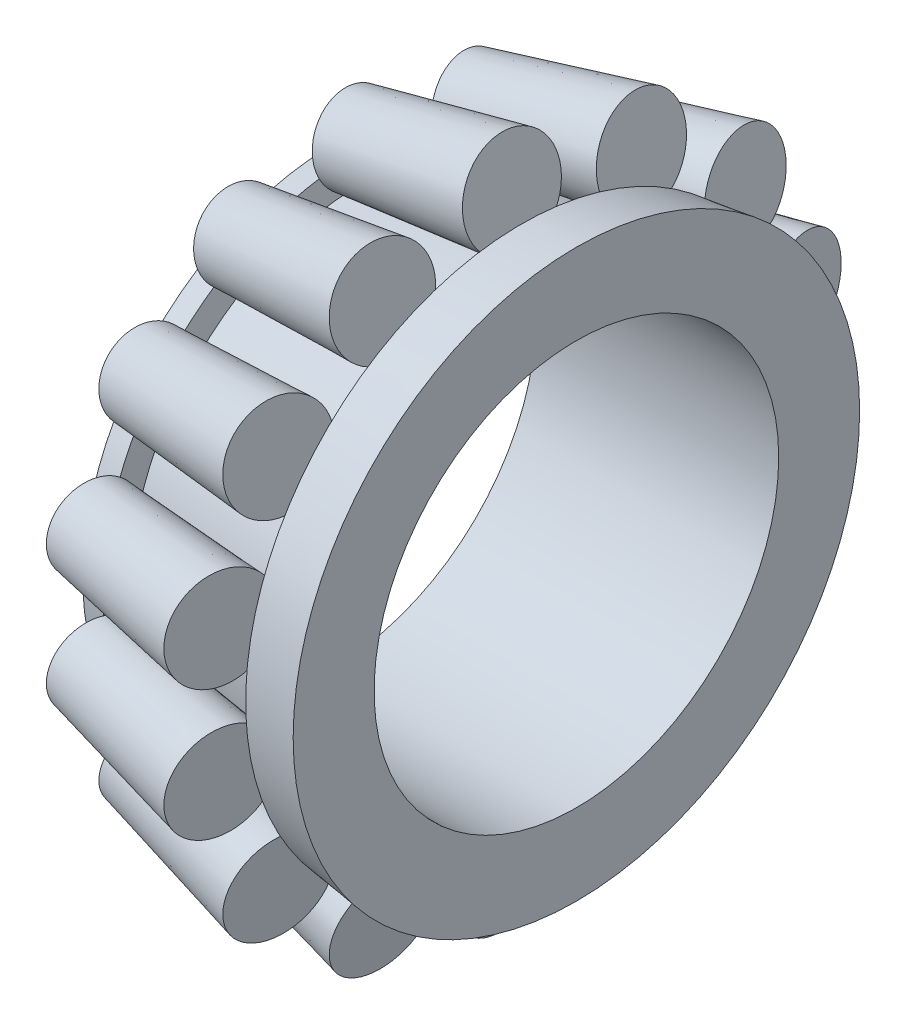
ISO-10303-21;
HEADER;
FILE_DESCRIPTION(('STEP AP214'),'2;1');
FILE_NAME('part.step','',(''),(''),'','','');
FILE_SCHEMA(('AUTOMOTIVE_DESIGN { 1 0 10303 214 1 1 1 1 }'));
ENDSEC;
DATA;
#1=APPLICATION_CONTEXT('core data for automotive mechanical design processes');
#2=APPLICATION_PROTOCOL_DEFINITION('international standard','automotive_design',2000,#1);
#3=PRODUCT_CONTEXT('',#1,'mechanical');
#4=PRODUCT('Part','Part','',(#3));
#5=PRODUCT_RELATED_PRODUCT_CATEGORY('part','',(#4));
#6=PRODUCT_DEFINITION_FORMATION('','',#4);
#7=PRODUCT_DEFINITION_CONTEXT('part definition',#1,'design');
#8=PRODUCT_DEFINITION('design','',#6,#7);
#9=PRODUCT_DEFINITION_SHAPE('','',#8);
#10=(LENGTH_UNIT() NAMED_UNIT(*) SI_UNIT(.MILLI.,.METRE.));
#11=(NAMED_UNIT(*) PLANE_ANGLE_UNIT() SI_UNIT($,.RADIAN.));
#12=(NAMED_UNIT(*) SI_UNIT($,.STERADIAN.) SOLID_ANGLE_UNIT());
#13=UNCERTAINTY_MEASURE_WITH_UNIT(LENGTH_MEASURE(1.E-05),#10,'distance_accuracy_value','');
#14=(GEOMETRIC_REPRESENTATION_CONTEXT(3) GLOBAL_UNCERTAINTY_ASSIGNED_CONTEXT((#13)) GLOBAL_UNIT_ASSIGNED_CONTEXT((#10,
#11,#12)) REPRESENTATION_CONTEXT('',''));
#15=CARTESIAN_POINT('',(0.,0.,0.));
#16=DIRECTION('',(0.,0.,1.));
#17=DIRECTION('',(1.,0.,0.));
#18=AXIS2_PLACEMENT_3D('',#15,#16,#17);
#19=CARTESIAN_POINT('',(-13.5839053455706,0.,0.));
#20=DIRECTION('',(1.,0.,0.));
#21=DIRECTION('',(0.,0.,-1.));
#22=AXIS2_PLACEMENT_3D('',#19,#20,#21);
#23=CONICAL_SURFACE('',#22,15.6888126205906,0.132551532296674);
#24=CARTESIAN_POINT('',(-15.,0.,0.));
#25=DIRECTION('',(1.,0.,0.));
#26=DIRECTION('',(0.,0.,-1.));
#27=AXIS2_PLACEMENT_3D('',#24,#25,#26);
#28=CIRCLE('',#27,15.5);
#29=CARTESIAN_POINT('',(-15.,0.,-15.5));
#30=VERTEX_POINT('',#29);
#31=EDGE_CURVE('E720',#30,#30,#28,.T.);
#32=ORIENTED_EDGE('',*,*,#31,.T.);
#33=EDGE_LOOP('',(#32));
#34=FACE_BOUND('',#33,.T.);
#35=CARTESIAN_POINT('',(-13.5839053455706,0.,0.));
#36=DIRECTION('',(1.,0.,0.));
#37=DIRECTION('',(0.,0.,-1.));
#38=AXIS2_PLACEMENT_3D('',#35,#36,#37);
#39=CIRCLE('',#38,15.6888126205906);
#40=CARTESIAN_POINT('',(-13.5839053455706,14.9510269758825,-4.75453823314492));
#41=VERTEX_POINT('',#40);
#42=CARTESIAN_POINT('',(-13.5839053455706,15.5333266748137,-2.20331655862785));
#43=VERTEX_POINT('',#42);
#44=EDGE_CURVE('E714',#41,#43,#39,.T.);
#45=ORIENTED_EDGE('',*,*,#44,.F.);
#46=CARTESIAN_POINT('',(-10.3376085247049,-0.393671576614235,0.189582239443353));
#47=DIRECTION('',(0.979959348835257,0.179470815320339,-0.0864285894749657));
#48=DIRECTION('',(0.199197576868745,-0.882912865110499,0.425188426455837));
#49=AXIS2_PLACEMENT_3D('',#46,#47,#48);
#50=ELLIPSE('',#49,16.4513479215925,16.1157299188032);
#51=CARTESIAN_POINT('',(-13.5839053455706,13.0390605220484,-8.72477748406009));
#52=VERTEX_POINT('',#51);
#53=EDGE_CURVE('E435',#41,#52,#50,.F.);
#54=ORIENTED_EDGE('',*,*,#53,.T.);
#55=CARTESIAN_POINT('',(-13.5839053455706,11.4074930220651,-10.7706984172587));
#56=VERTEX_POINT('',#55);
#57=EDGE_CURVE('E1049',#56,#52,#39,.T.);
#58=ORIENTED_EDGE('',*,*,#57,.F.);
#59=CARTESIAN_POINT('',(-10.3376085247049,-0.272429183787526,0.341615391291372));
#60=DIRECTION('',(0.979959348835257,0.124197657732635,-0.155738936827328));
#61=DIRECTION('',(0.199197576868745,-0.610994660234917,0.766163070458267));
#62=AXIS2_PLACEMENT_3D('',#59,#60,#61);
#63=ELLIPSE('',#62,16.4513479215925,16.1157299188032);
#64=CARTESIAN_POINT('',(-13.5839053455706,7.96224851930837,-13.5181892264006));
#65=VERTEX_POINT('',#64);
#66=EDGE_CURVE('E641',#56,#65,#63,.F.);
#67=ORIENTED_EDGE('',*,*,#66,.T.);
#68=CARTESIAN_POINT('',(-13.5839053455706,5.60456517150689,-14.653589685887));
#69=VERTEX_POINT('',#68);
#70=EDGE_CURVE('E1043',#69,#65,#39,.T.);
#71=ORIENTED_EDGE('',*,*,#70,.F.);
#72=CARTESIAN_POINT('',(-10.3376085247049,-0.0972288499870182,0.425987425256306));
#73=DIRECTION('',(0.979959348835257,0.0443256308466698,-0.194203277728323));
#74=DIRECTION('',(0.199197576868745,-0.218061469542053,0.955389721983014));
#75=AXIS2_PLACEMENT_3D('',#72,#73,#74);
#76=ELLIPSE('',#75,16.4513479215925,16.1157299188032);
#77=CARTESIAN_POINT('',(-13.5839053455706,1.30841554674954,-15.6341578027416));
#78=VERTEX_POINT('',#77);
#79=EDGE_CURVE('E1056',#69,#78,#76,.F.);
#80=ORIENTED_EDGE('',*,*,#79,.T.);
#81=CARTESIAN_POINT('',(-13.5839053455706,-1.30841554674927,-15.6341578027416));
#82=VERTEX_POINT('',#81);
#83=EDGE_CURVE('E1300',#82,#78,#39,.T.);
#84=ORIENTED_EDGE('',*,*,#83,.F.);
#85=CARTESIAN_POINT('',(-10.3376085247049,0.0972288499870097,0.425987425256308));
#86=DIRECTION('',(0.979959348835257,-0.0443256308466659,-0.194203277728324));
#87=DIRECTION('',(0.199197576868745,0.218061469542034,0.955389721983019));
#88=AXIS2_PLACEMENT_3D('',#85,#86,#87);
#89=ELLIPSE('',#88,16.4513479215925,16.1157299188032);
#90=CARTESIAN_POINT('',(-13.5839053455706,-5.60456517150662,-14.6535896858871));
#91=VERTEX_POINT('',#90);
#92=EDGE_CURVE('E1067',#82,#91,#89,.F.);
#93=ORIENTED_EDGE('',*,*,#92,.T.);
#94=CARTESIAN_POINT('',(-13.5839053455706,-7.96224851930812,-13.5181892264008));
#95=VERTEX_POINT('',#94);
#96=EDGE_CURVE('E1299',#95,#91,#39,.T.);
#97=ORIENTED_EDGE('',*,*,#96,.F.);
#98=CARTESIAN_POINT('',(-10.3376085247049,0.272429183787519,0.341615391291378));
#99=DIRECTION('',(0.979959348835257,-0.124197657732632,-0.155738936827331));
#100=DIRECTION('',(0.199197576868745,0.610994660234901,0.766163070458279));
#101=AXIS2_PLACEMENT_3D('',#98,#99,#100);
#102=ELLIPSE('',#101,16.4513479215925,16.1157299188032);
#103=CARTESIAN_POINT('',(-13.5839053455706,-11.4074930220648,-10.7706984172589));
#104=VERTEX_POINT('',#103);
#105=EDGE_CURVE('E1083',#95,#104,#102,.F.);
#106=ORIENTED_EDGE('',*,*,#105,.T.);
#107=CARTESIAN_POINT('',(-13.5839053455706,-13.0390605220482,-8.72477748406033));
#108=VERTEX_POINT('',#107);
#109=EDGE_CURVE('E1298',#108,#104,#39,.T.);
#110=ORIENTED_EDGE('',*,*,#109,.F.);
#111=CARTESIAN_POINT('',(-10.3376085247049,0.393671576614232,0.189582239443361));
#112=DIRECTION('',(0.979959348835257,-0.179470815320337,-0.0864285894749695));
#113=DIRECTION('',(0.199197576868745,0.88291286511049,0.425188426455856));
#114=AXIS2_PLACEMENT_3D('',#111,#112,#113);
#115=ELLIPSE('',#114,16.4513479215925,16.1157299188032);
#116=CARTESIAN_POINT('',(-13.5839053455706,-14.9510269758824,-4.7545382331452));
#117=VERTEX_POINT('',#116);
#118=EDGE_CURVE('E1100',#108,#117,#115,.F.);
#119=ORIENTED_EDGE('',*,*,#118,.T.);
#120=CARTESIAN_POINT('',(-13.5839053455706,-15.5333266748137,-2.20331655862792));
#121=VERTEX_POINT('',#120);
#122=EDGE_CURVE('E1297',#121,#117,#39,.T.);
#123=ORIENTED_EDGE('',*,*,#122,.F.);
#124=CARTESIAN_POINT('',(-10.3376085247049,0.43694248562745,0.));
#125=DIRECTION('',(0.979959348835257,-0.199197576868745,0.));
#126=DIRECTION('',(0.199197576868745,0.979959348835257,0.));
#127=AXIS2_PLACEMENT_3D('',#124,#125,#126);
#128=ELLIPSE('',#127,16.4513479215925,16.1157299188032);
#129=CARTESIAN_POINT('',(-13.5839053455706,-15.5333266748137,2.20331655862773));
#130=VERTEX_POINT('',#129);
#131=EDGE_CURVE('E1117',#121,#130,#128,.F.);
#132=ORIENTED_EDGE('',*,*,#131,.T.);
#133=CARTESIAN_POINT('',(-13.5839053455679,-14.9510269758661,4.75453823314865));
#134=VERTEX_POINT('',#133);
#135=EDGE_CURVE('E1296',#134,#130,#39,.T.);
#136=ORIENTED_EDGE('',*,*,#135,.F.);
#137=CARTESIAN_POINT('',(-10.3376085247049,0.393671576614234,-0.189582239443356));
#138=DIRECTION('',(0.979959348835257,-0.179470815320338,0.086428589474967));
#139=DIRECTION('',(0.199197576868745,0.882912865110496,-0.425188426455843));
#140=AXIS2_PLACEMENT_3D('',#137,#138,#139);
#141=ELLIPSE('',#140,16.4513479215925,16.1157299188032);
#142=CARTESIAN_POINT('',(-13.5839053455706,-13.0390605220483,8.72477748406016));
#143=VERTEX_POINT('',#142);
#144=EDGE_CURVE('E1134',#134,#143,#141,.F.);
#145=ORIENTED_EDGE('',*,*,#144,.T.);
#146=CARTESIAN_POINT('',(-13.5839053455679,-11.4074930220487,10.770698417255));
#147=VERTEX_POINT('',#146);
#148=EDGE_CURVE('E1295',#147,#143,#39,.T.);
#149=ORIENTED_EDGE('',*,*,#148,.F.);
#150=CARTESIAN_POINT('',(-10.3376085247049,0.272429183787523,-0.341615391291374));
#151=DIRECTION('',(0.979959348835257,-0.124197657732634,0.155738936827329));
#152=DIRECTION('',(0.199197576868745,0.610994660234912,-0.766163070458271));
#153=AXIS2_PLACEMENT_3D('',#150,#151,#152);
#154=ELLIPSE('',#153,16.4513479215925,16.1157299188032);
#155=CARTESIAN_POINT('',(-13.5839053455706,-7.9622485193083,13.5181892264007));
#156=VERTEX_POINT('',#155);
#157=EDGE_CURVE('E1151',#147,#156,#154,.F.);
#158=ORIENTED_EDGE('',*,*,#157,.T.);
#159=CARTESIAN_POINT('',(-13.5839053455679,-5.60456517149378,14.6535896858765));
#160=VERTEX_POINT('',#159);
#161=EDGE_CURVE('E1294',#160,#156,#39,.T.);
#162=ORIENTED_EDGE('',*,*,#161,.F.);
#163=CARTESIAN_POINT('',(-10.3376085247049,0.0972288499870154,-0.425987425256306));
#164=DIRECTION('',(0.979959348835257,-0.0443256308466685,0.194203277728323));
#165=DIRECTION('',(0.199197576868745,0.218061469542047,-0.955389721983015));
#166=AXIS2_PLACEMENT_3D('',#163,#164,#165);
#167=ELLIPSE('',#166,16.4513479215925,16.1157299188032);
#168=CARTESIAN_POINT('',(-13.5839053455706,-1.30841554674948,15.6341578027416));
#169=VERTEX_POINT('',#168);
#170=EDGE_CURVE('E1168',#160,#169,#167,.F.);
#171=ORIENTED_EDGE('',*,*,#170,.T.);
#172=CARTESIAN_POINT('',(-13.5839053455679,1.30841554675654,15.6341578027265));
#173=VERTEX_POINT('',#172);
#174=EDGE_CURVE('E1293',#173,#169,#39,.T.);
#175=ORIENTED_EDGE('',*,*,#174,.F.);
#176=CARTESIAN_POINT('',(-10.3376085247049,-0.0972288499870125,-0.425987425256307));
#177=DIRECTION('',(0.979959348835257,0.0443256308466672,0.194203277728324));
#178=DIRECTION('',(0.199197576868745,-0.21806146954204,-0.955389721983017));
#179=AXIS2_PLACEMENT_3D('',#176,#177,#178);
#180=ELLIPSE('',#179,16.4513479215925,16.1157299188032);
#181=CARTESIAN_POINT('',(-13.5839053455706,5.60456517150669,14.6535896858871));
#182=VERTEX_POINT('',#181);
#183=EDGE_CURVE('E1186',#173,#182,#180,.F.);
#184=ORIENTED_EDGE('',*,*,#183,.T.);
#185=CARTESIAN_POINT('',(-13.5839053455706,7.96224851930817,13.5181892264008));
#186=VERTEX_POINT('',#185);
#187=EDGE_CURVE('E1292',#186,#182,#39,.T.);
#188=ORIENTED_EDGE('',*,*,#187,.F.);
#189=CARTESIAN_POINT('',(-10.3376085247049,-0.272429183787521,-0.341615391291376));
#190=DIRECTION('',(0.979959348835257,0.124197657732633,0.15573893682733));
#191=DIRECTION('',(0.199197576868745,-0.610994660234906,-0.766163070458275));
#192=AXIS2_PLACEMENT_3D('',#189,#190,#191);
#193=ELLIPSE('',#192,16.4513479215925,16.1157299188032);
#194=CARTESIAN_POINT('',(-13.5839053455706,11.4074930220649,10.7706984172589));
#195=VERTEX_POINT('',#194);
#196=EDGE_CURVE('E1203',#186,#195,#193,.F.);
#197=ORIENTED_EDGE('',*,*,#196,.T.);
#198=CARTESIAN_POINT('',(-13.5839053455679,13.0390605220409,8.72477748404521));
#199=VERTEX_POINT('',#198);
#200=EDGE_CURVE('E721',#199,#195,#39,.T.);
#201=ORIENTED_EDGE('',*,*,#200,.F.);
#202=CARTESIAN_POINT('',(-10.3376085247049,-0.393671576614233,-0.189582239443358));
#203=DIRECTION('',(0.979959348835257,0.179470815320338,0.0864285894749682));
#204=DIRECTION('',(0.199197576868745,-0.882912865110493,-0.42518842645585));
#205=AXIS2_PLACEMENT_3D('',#202,#203,#204);
#206=ELLIPSE('',#205,16.4513479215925,16.1157299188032);
#207=CARTESIAN_POINT('',(-13.5839053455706,14.9510269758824,4.75453823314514));
#208=VERTEX_POINT('',#207);
#209=EDGE_CURVE('E1220',#199,#208,#206,.F.);
#210=ORIENTED_EDGE('',*,*,#209,.T.);
#211=CARTESIAN_POINT('',(-13.5839053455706,15.5333266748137,2.20331655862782));
#212=VERTEX_POINT('',#211);
#213=EDGE_CURVE('E717',#212,#208,#39,.T.);
#214=ORIENTED_EDGE('',*,*,#213,.F.);
#215=CARTESIAN_POINT('',(-10.3376085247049,-0.43694248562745,0.));
#216=DIRECTION('',(0.979959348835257,0.199197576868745,0.));
#217=DIRECTION('',(0.199197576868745,-0.979959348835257,0.));
#218=AXIS2_PLACEMENT_3D('',#215,#216,#217);
#219=ELLIPSE('',#218,16.4513479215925,16.1157299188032);
#220=EDGE_CURVE('E1235',#212,#43,#219,.F.);
#221=ORIENTED_EDGE('',*,*,#220,.T.);
#222=EDGE_LOOP('',(#45,#54,#58,#67,#71,#80,#84,#93,#97,#106,#110,#119,#123,#132,#136,#145,#149,
#158,#162,#171,#175,#184,#188,#197,#201,#210,#214,#221));
#223=FACE_BOUND('',#222,.T.);
#224=ADVANCED_FACE('F24',(#34,#223),#23,.T.);
#225=CARTESIAN_POINT('',(-13.3113282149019,0.,0.));
#226=DIRECTION('',(-1.,0.,0.));
#227=DIRECTION('',(0.,0.,1.));
#228=AXIS2_PLACEMENT_3D('',#225,#226,#227);
#229=CONICAL_SURFACE('',#228,14.2118816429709,1.38829347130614);
#230=CARTESIAN_POINT('',(-13.3113282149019,0.,0.));
#231=DIRECTION('',(1.,0.,0.));
#232=DIRECTION('',(0.,0.,-1.));
#233=AXIS2_PLACEMENT_3D('',#230,#231,#232);
#234=CIRCLE('',#233,14.2118816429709);
#235=CARTESIAN_POINT('',(-13.3113282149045,13.1098604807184,-5.48717942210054));
#236=VERTEX_POINT('',#235);
#237=CARTESIAN_POINT('',(-13.3113282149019,14.1923740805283,-0.744377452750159));
#238=VERTEX_POINT('',#237);
#239=EDGE_CURVE('E705',#236,#238,#234,.T.);
#240=ORIENTED_EDGE('',*,*,#239,.F.);
#241=CARTESIAN_POINT('',(-13.311128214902,13.1081352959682,-5.48849413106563));
#242=CARTESIAN_POINT('',(-13.3234367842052,13.2139614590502,-5.40830295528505));
#243=CARTESIAN_POINT('',(-13.3376706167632,13.3256855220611,-5.33769401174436));
#244=CARTESIAN_POINT('',(-13.3687890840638,13.5562969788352,-5.21165709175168));
#245=CARTESIAN_POINT('',(-13.3856572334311,13.6751371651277,-5.15614022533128));
#246=CARTESIAN_POINT('',(-13.4382956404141,14.0347415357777,-5.0062478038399));
#247=CARTESIAN_POINT('',(-13.4764308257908,14.2811789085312,-4.92690617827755));
#248=CARTESIAN_POINT('',(-13.5271241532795,14.5998998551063,-4.83985503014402));
#249=CARTESIAN_POINT('',(-13.5383536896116,14.6699762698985,-4.82166449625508));
#250=CARTESIAN_POINT('',(-13.5610584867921,14.8107261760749,-4.78682970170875));
#251=CARTESIAN_POINT('',(-13.572534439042,14.8814008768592,-4.77019076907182));
#252=CARTESIAN_POINT('',(-13.5841053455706,14.9522517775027,-4.75426258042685));
#253=B_SPLINE_CURVE_WITH_KNOTS('',3,(#241,#242,#243,#244,#245,#246,#247,#248,#249,#250,#251,
#252),.UNSPECIFIED.,.F.,.F.,(4,2,2,2,2,4),(0.,0.39824798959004,0.794096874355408,
1.57672655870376,1.79653595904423,2.01707432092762),.UNSPECIFIED.);
#254=EDGE_CURVE('E429',#236,#41,#253,.T.);
#255=ORIENTED_EDGE('',*,*,#254,.T.);
#256=ORIENTED_EDGE('',*,*,#44,.T.);
#257=CARTESIAN_POINT('',(-13.5841053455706,15.5343105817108,-2.20409633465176));
#258=CARTESIAN_POINT('',(-13.5632443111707,15.4316840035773,-2.1227111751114));
#259=CARTESIAN_POINT('',(-13.5426753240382,15.3304941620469,-2.03963981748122));
#260=CARTESIAN_POINT('',(-13.5022163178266,15.1314546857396,-1.8683154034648));
#261=CARTESIAN_POINT('',(-13.4823307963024,15.033627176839,-1.78003570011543));
#262=CARTESIAN_POINT('',(-13.425182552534,14.7524844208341,-1.51069472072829));
#263=CARTESIAN_POINT('',(-13.3893396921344,14.5761542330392,-1.32109551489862));
#264=CARTESIAN_POINT('',(-13.3494799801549,14.3800630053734,-1.05488531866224));
#265=CARTESIAN_POINT('',(-13.3410974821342,14.3388250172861,-0.994953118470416));
#266=CARTESIAN_POINT('',(-13.3252991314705,14.2611044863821,-0.871455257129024));
#267=CARTESIAN_POINT('',(-13.3178895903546,14.2246529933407,-0.807869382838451));
#268=CARTESIAN_POINT('',(-13.3111282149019,14.1913901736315,-0.742444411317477));
#269=B_SPLINE_CURVE_WITH_KNOTS('',3,(#257,#258,#259,#260,#261,#262,#263,#264,#265,#266,#267,
#268),.UNSPECIFIED.,.F.,.F.,(4,2,2,2,2,4),(0.,0.39758790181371,0.79742425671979,
1.57674270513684,1.79621028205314,2.01703775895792),.UNSPECIFIED.);
#270=EDGE_CURVE('E449',#43,#238,#269,.T.);
#271=ORIENTED_EDGE('',*,*,#270,.T.);
#272=EDGE_LOOP('',(#240,#255,#256,#271));
#273=FACE_BOUND('',#272,.T.);
#274=ADVANCED_FACE('F444',(#273),#229,.T.);
#275=ORIENTED_EDGE('',*,*,#57,.T.);
#276=CARTESIAN_POINT('',(-13.5841053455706,13.0396086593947,-8.72590693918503));
#277=CARTESIAN_POINT('',(-13.5632443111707,12.982457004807,-8.60805344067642));
#278=CARTESIAN_POINT('',(-13.5426753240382,12.9273314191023,-8.48930410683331));
#279=CARTESIAN_POINT('',(-13.5022163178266,12.8223379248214,-8.24858615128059));
#280=CARTESIAN_POINT('',(-13.4823307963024,12.7725015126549,-8.12660312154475));
#281=CARTESIAN_POINT('',(-13.4251825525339,12.6360633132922,-7.76195201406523));
#282=CARTESIAN_POINT('',(-13.3893396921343,12.5594593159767,-7.51462223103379));
#283=CARTESIAN_POINT('',(-13.3494799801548,12.4982914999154,-7.18969433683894));
#284=CARTESIAN_POINT('',(-13.3410974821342,12.4871409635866,-7.1178047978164));
#285=CARTESIAN_POINT('',(-13.3252991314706,12.4707008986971,-6.97281539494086));
#286=CARTESIAN_POINT('',(-13.3178895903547,12.4654481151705,-6.89971079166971));
#287=CARTESIAN_POINT('',(-13.311128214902,12.463866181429,-6.8263327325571));
#288=B_SPLINE_CURVE_WITH_KNOTS('',3,(#276,#277,#278,#279,#280,#281,#282,#283,#284,#285,#286,
#287),.UNSPECIFIED.,.F.,.F.,(4,2,2,2,2,4),(0.,0.397587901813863,0.797424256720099,
1.57674270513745,1.79621028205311,2.01703775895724),.UNSPECIFIED.);
#289=CARTESIAN_POINT('',(-13.3113282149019,12.4639139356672,-6.82850124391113));
#290=VERTEX_POINT('',#289);
#291=EDGE_CURVE('E422',#52,#290,#288,.T.);
#292=ORIENTED_EDGE('',*,*,#291,.T.);
#293=CARTESIAN_POINT('',(-13.3113282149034,9.43077823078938,-10.6319331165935));
#294=VERTEX_POINT('',#293);
#295=EDGE_CURVE('E695',#294,#290,#234,.T.);
#296=ORIENTED_EDGE('',*,*,#295,.F.);
#297=CARTESIAN_POINT('',(-14.1219794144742,8.24795757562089,-16.6760785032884));
#298=CARTESIAN_POINT('',(-14.0609886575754,8.19847778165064,-16.3317639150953));
#299=CARTESIAN_POINT('',(-14.0003057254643,8.15203063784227,-15.9869678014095));
#300=CARTESIAN_POINT('',(-13.8785434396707,8.06950474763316,-15.2866126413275));
#301=CARTESIAN_POINT('',(-13.8174968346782,8.03373627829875,-14.9310122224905));
#302=CARTESIAN_POINT('',(-13.6851744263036,7.97469188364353,-14.1454835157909));
#303=CARTESIAN_POINT('',(-13.6143253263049,7.9554027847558,-13.7150607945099));
#304=CARTESIAN_POINT('',(-13.5137713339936,7.9684818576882,-13.0719126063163));
#305=CARTESIAN_POINT('',(-13.4813942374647,7.97964295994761,-12.8592848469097));
#306=CARTESIAN_POINT('',(-13.4197738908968,8.02417148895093,-12.4360395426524));
#307=CARTESIAN_POINT('',(-13.3905188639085,8.05745177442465,-12.2254173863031));
#308=CARTESIAN_POINT('',(-13.3571923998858,8.12383607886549,-11.9627768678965));
#309=CARTESIAN_POINT('',(-13.3502745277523,8.13947891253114,-11.9067726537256));
#310=CARTESIAN_POINT('',(-13.3370146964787,8.1741166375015,-11.7957148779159));
#311=CARTESIAN_POINT('',(-13.330673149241,8.19311389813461,-11.7406620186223));
#312=CARTESIAN_POINT('',(-13.3128543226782,8.25541491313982,-11.5788568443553));
#313=CARTESIAN_POINT('',(-13.3023892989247,8.30437378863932,-11.4739641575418));
#314=CARTESIAN_POINT('',(-13.2896809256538,8.39277096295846,-11.3235046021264));
#315=CARTESIAN_POINT('',(-13.285916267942,8.42522134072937,-11.2739378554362));
#316=CARTESIAN_POINT('',(-13.2796594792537,8.49547617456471,-11.1785417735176));
#317=CARTESIAN_POINT('',(-13.2771688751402,8.53328698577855,-11.132716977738));
#318=CARTESIAN_POINT('',(-13.2729994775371,8.62885394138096,-11.0302696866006));
#319=CARTESIAN_POINT('',(-13.271936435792,8.6888881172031,-10.9757050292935));
#320=CARTESIAN_POINT('',(-13.2726477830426,8.81744153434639,-10.87766312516));
#321=CARTESIAN_POINT('',(-13.2744242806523,8.8859670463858,-10.8341941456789));
#322=CARTESIAN_POINT('',(-13.2805555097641,9.02853978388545,-10.7590758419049));
#323=CARTESIAN_POINT('',(-13.284896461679,9.102555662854,-10.7273648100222));
#324=CARTESIAN_POINT('',(-13.2956754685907,9.25398008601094,-10.6744328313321));
#325=CARTESIAN_POINT('',(-13.302112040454,9.33138619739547,-10.6532044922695));
#326=CARTESIAN_POINT('',(-13.3096406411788,9.41273508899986,-10.6357032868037));
#327=CARTESIAN_POINT('',(-13.309936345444,9.41591725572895,-10.6350262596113));
#328=CARTESIAN_POINT('',(-13.3105303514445,9.4222836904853,-10.633686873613));
#329=CARTESIAN_POINT('',(-13.3108286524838,9.42546795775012,-10.6330245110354));
#330=CARTESIAN_POINT('',(-13.335068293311,9.68322887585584,-10.5799906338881));
#331=CARTESIAN_POINT('',(-13.3670644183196,9.9457058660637,-10.5720021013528));
#332=CARTESIAN_POINT('',(-13.4374745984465,10.4672440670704,-10.5991327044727));
#333=CARTESIAN_POINT('',(-13.4759588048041,10.7262303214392,-10.6347530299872));
#334=CARTESIAN_POINT('',(-13.5382711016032,11.125534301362,-10.7084076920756));
#335=CARTESIAN_POINT('',(-13.5610175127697,11.2674718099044,-10.7383440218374));
#336=CARTESIAN_POINT('',(-13.6409696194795,11.7565944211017,-10.8513660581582));
#337=CARTESIAN_POINT('',(-13.6999050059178,12.1002677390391,-10.9481360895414));
#338=CARTESIAN_POINT('',(-13.7897312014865,12.6109555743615,-11.1060913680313));
#339=CARTESIAN_POINT('',(-13.8198856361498,12.7802469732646,-11.1608273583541));
#340=CARTESIAN_POINT('',(-13.8805677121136,13.1174419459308,-11.2737544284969));
#341=CARTESIAN_POINT('',(-13.9110950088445,13.285346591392,-11.3319424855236));
#342=CARTESIAN_POINT('',(-13.9417770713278,13.4527654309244,-11.3914917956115));
#343=B_SPLINE_CURVE_WITH_KNOTS('',3,(#297,#298,#299,#300,#301,#302,#303,#304,#305,#306,#307,
#308,#309,#310,#311,#312,#313,#314,#315,#316,#317,#318,#319,#320,#321,#322,#323,#324,#325,#326,
#327,#328,#329,#330,#331,#332,#333,#334,#335,#336,#337,#338,#339,#340,#341,#342),.UNSPECIFIED.,
.F.,.F.,(4,2,2,2,2,2,2,2,2,2,2,2,2,2,2,2,2,2,2,2,2,2,4),(0.,1.05936262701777,2.14703737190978,
3.45457724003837,4.10020918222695,4.74331253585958,4.9188832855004,5.09457854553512,
5.44136166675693,5.61914411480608,5.79713912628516,6.03926136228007,6.28156347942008,
6.52257532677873,6.76341697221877,6.77321758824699,6.78301565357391,7.56604596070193,
8.35816061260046,8.79848010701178,9.88296683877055,10.4243403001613,10.965246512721),.UNSPECIFIED.);
#344=EDGE_CURVE('E643',#294,#56,#343,.T.);
#345=ORIENTED_EDGE('',*,*,#344,.T.);
#346=EDGE_LOOP('',(#275,#292,#296,#345));
#347=FACE_BOUND('',#346,.T.);
#348=ADVANCED_FACE('F702',(#347),#229,.T.);
#349=CARTESIAN_POINT('',(-3.38665885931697,0.,0.));
#350=DIRECTION('',(1.,0.,0.));
#351=DIRECTION('',(0.,0.,-1.));
#352=AXIS2_PLACEMENT_3D('',#349,#350,#351);
#353=CONICAL_SURFACE('',#352,15.5351708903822,0.132551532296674);
#354=CARTESIAN_POINT('',(-3.38665885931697,0.,0.));
#355=DIRECTION('',(1.,0.,0.));
#356=DIRECTION('',(0.,0.,-1.));
#357=AXIS2_PLACEMENT_3D('',#354,#355,#356);
#358=CIRCLE('',#357,15.5351708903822);
#359=CARTESIAN_POINT('',(-3.38665885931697,0.,-15.5351708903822));
#360=VERTEX_POINT('',#359);
#361=EDGE_CURVE('E709',#360,#360,#358,.T.);
#362=ORIENTED_EDGE('',*,*,#361,.F.);
#363=EDGE_LOOP('',(#362));
#364=FACE_BOUND('',#363,.T.);
#365=CARTESIAN_POINT('',(-3.38645885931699,14.1729871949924,-6.36150902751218));
#366=CARTESIAN_POINT('',(-3.62143784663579,14.1548490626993,-6.32539794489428));
#367=CARTESIAN_POINT('',(-3.85662332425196,14.1357506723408,-6.29122639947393));
#368=CARTESIAN_POINT('',(-4.32726713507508,14.0961054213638,-6.22582671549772));
#369=CARTESIAN_POINT('',(-4.56272544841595,14.0755586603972,-6.19459837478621));
#370=CARTESIAN_POINT('',(-5.03377373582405,14.0334890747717,-6.13414901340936));
#371=CARTESIAN_POINT('',(-5.26936368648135,14.0119663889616,-6.10492770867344));
#372=CARTESIAN_POINT('',(-5.74066699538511,13.9681533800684,-6.04806275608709));
#373=CARTESIAN_POINT('',(-5.97638035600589,13.9458630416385,-6.02041913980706));
#374=CARTESIAN_POINT('',(-6.68352192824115,13.8780990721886,-5.93937642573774));
#375=CARTESIAN_POINT('',(-7.15507760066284,13.831721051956,-5.88784967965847));
#376=CARTESIAN_POINT('',(-8.09840710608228,13.7372778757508,-5.78832738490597));
#377=CARTESIAN_POINT('',(-8.57018094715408,13.6892126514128,-5.74033197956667));
#378=CARTESIAN_POINT('',(-9.39766908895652,13.6037843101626,-5.65856741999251));
#379=CARTESIAN_POINT('',(-9.75335395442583,13.5667005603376,-5.62420554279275));
#380=CARTESIAN_POINT('',(-10.4647779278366,13.4919116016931,-5.55681493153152));
#381=CARTESIAN_POINT('',(-10.8205170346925,13.454206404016,-5.52378617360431));
#382=CARTESIAN_POINT('',(-11.5321091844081,13.3782524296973,-5.45888372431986));
#383=CARTESIAN_POINT('',(-11.8879622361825,13.3400035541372,-5.42701024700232));
#384=CARTESIAN_POINT('',(-12.5997142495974,13.2630294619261,-5.36430251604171));
#385=CARTESIAN_POINT('',(-12.9556132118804,13.2243042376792,-5.33346827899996));
#386=CARTESIAN_POINT('',(-13.3115282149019,13.1853716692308,-5.30309304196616));
#387=B_SPLINE_CURVE_WITH_KNOTS('',3,(#365,#366,#367,#368,#369,#370,#371,#372,#373,#374,#375,
#376,#377,#378,#379,#380,#381,#382,#383,#384,#385,#386),.UNSPECIFIED.,.F.,.F.,(4,2,2,2,2,2,2,2,
2,2,4),(0.,0.71525091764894,1.4304526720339,2.14555298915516,2.86066761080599,4.29051447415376,
5.72041934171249,6.79819570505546,7.87595276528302,8.95390849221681,10.0318814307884),.UNSPECIFIED.);
#388=CARTESIAN_POINT('',(-3.39250334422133,14.1725221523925,-6.36057694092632));
#389=VERTEX_POINT('',#388);
#390=CARTESIAN_POINT('',(-13.3089916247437,13.1856491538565,-5.30330949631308));
#391=VERTEX_POINT('',#390);
#392=EDGE_CURVE('E28',#389,#391,#387,.T.);
#393=ORIENTED_EDGE('',*,*,#392,.T.);
#394=CARTESIAN_POINT('',(-10.3459516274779,-0.356692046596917,0.171773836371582));
#395=DIRECTION('',(0.979959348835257,0.179470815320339,-0.0864285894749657));
#396=DIRECTION('',(0.199197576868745,-0.882912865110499,0.425188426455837));
#397=AXIS2_PLACEMENT_3D('',#394,#395,#396);
#398=ELLIPSE('',#397,14.9059909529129,14.6018992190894);
#399=EDGE_CURVE('E11',#391,#236,#398,.F.);
#400=ORIENTED_EDGE('',*,*,#399,.T.);
#401=ORIENTED_EDGE('',*,*,#239,.T.);
#402=CARTESIAN_POINT('',(-10.3459516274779,-0.395898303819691,0.));
#403=DIRECTION('',(0.979959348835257,0.199197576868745,0.));
#404=DIRECTION('',(0.199197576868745,-0.979959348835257,0.));
#405=AXIS2_PLACEMENT_3D('',#402,#403,#404);
#406=ELLIPSE('',#405,14.9059909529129,14.6018992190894);
#407=CARTESIAN_POINT('',(-13.3089916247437,14.1808791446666,-0.942922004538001));
#408=VERTEX_POINT('',#407);
#409=EDGE_CURVE('E734',#238,#408,#406,.F.);
#410=ORIENTED_EDGE('',*,*,#409,.T.);
#411=CARTESIAN_POINT('',(-13.3115282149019,14.1805352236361,-0.942996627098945));
#412=CARTESIAN_POINT('',(-12.9182825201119,14.2338530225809,-0.931420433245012));
#413=CARTESIAN_POINT('',(-12.5250561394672,14.2871859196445,-0.919233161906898));
#414=CARTESIAN_POINT('',(-11.7386587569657,14.3938781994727,-0.893445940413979));
#415=CARTESIAN_POINT('',(-11.3454877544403,14.4472375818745,-0.879846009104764));
#416=CARTESIAN_POINT('',(-10.5592928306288,14.5539689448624,-0.851045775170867));
#417=CARTESIAN_POINT('',(-10.1662688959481,14.6073409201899,-0.835845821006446));
#418=CARTESIAN_POINT('',(-9.38029379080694,14.7141062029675,-0.803564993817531));
#419=CARTESIAN_POINT('',(-8.98734262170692,14.7674995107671,-0.786484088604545));
#420=CARTESIAN_POINT('',(-8.15993759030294,14.8799569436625,-0.748121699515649));
#421=CARTESIAN_POINT('',(-7.72549561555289,14.939022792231,-0.726586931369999));
#422=CARTESIAN_POINT('',(-6.85681762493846,15.0571614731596,-0.67994122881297));
#423=CARTESIAN_POINT('',(-6.42258160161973,15.1162343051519,-0.654830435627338));
#424=CARTESIAN_POINT('',(-5.7714095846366,15.2048438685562,-0.613390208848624));
#425=CARTESIAN_POINT('',(-5.55435446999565,15.2343842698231,-0.59894567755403));
#426=CARTESIAN_POINT('',(-5.12035754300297,15.2934578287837,-0.568479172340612));
#427=CARTESIAN_POINT('',(-4.90341572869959,15.3229909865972,-0.552457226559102));
#428=CARTESIAN_POINT('',(-4.46965401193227,15.3820486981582,-0.51842192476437));
#429=CARTESIAN_POINT('',(-4.25283412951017,15.4115732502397,-0.50040830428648));
#430=CARTESIAN_POINT('',(-3.8194359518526,15.4705972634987,-0.461520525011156));
#431=CARTESIAN_POINT('',(-3.60285767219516,15.5000967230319,-0.440646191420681));
#432=CARTESIAN_POINT('',(-3.38645885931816,15.5295755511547,-0.417907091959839));
#433=B_SPLINE_CURVE_WITH_KNOTS('',3,(#411,#412,#413,#414,#415,#416,#417,#418,#419,#420,#421,
#422,#423,#424,#425,#426,#427,#428,#429,#430,#431,#432),.UNSPECIFIED.,.F.,.F.,(4,2,2,2,2,2,2,2,
2,2,4),(0.,1.19103826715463,2.38206064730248,3.57282417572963,4.76360808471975,6.08050029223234,
7.39734050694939,8.05593130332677,8.7145103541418,9.37317695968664,10.0318838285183),.UNSPECIFIED.);
#434=CARTESIAN_POINT('',(-3.39250334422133,15.528752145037,-0.418545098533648));
#435=VERTEX_POINT('',#434);
#436=EDGE_CURVE('E727',#408,#435,#433,.T.);
#437=ORIENTED_EDGE('',*,*,#436,.T.);
#438=CARTESIAN_POINT('',(-0.147988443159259,-0.432750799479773,0.));
#439=DIRECTION('',(-0.979959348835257,-0.199197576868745,0.));
#440=DIRECTION('',(0.199197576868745,-0.979959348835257,0.));
#441=AXIS2_PLACEMENT_3D('',#438,#439,#440);
#442=ELLIPSE('',#441,16.293526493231,15.9611281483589);
#443=CARTESIAN_POINT('',(-3.39250334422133,15.528752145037,0.418545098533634));
#444=VERTEX_POINT('',#443);
#445=EDGE_CURVE('E754',#435,#444,#442,.F.);
#446=ORIENTED_EDGE('',*,*,#445,.T.);
#447=CARTESIAN_POINT('',(-3.38645885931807,15.5295755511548,0.417907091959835));
#448=CARTESIAN_POINT('',(-3.62143784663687,15.4975656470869,0.442572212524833));
#449=CARTESIAN_POINT('',(-3.85662332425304,15.4655321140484,0.465073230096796));
#450=CARTESIAN_POINT('',(-4.32726713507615,15.4014371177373,0.506794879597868));
#451=CARTESIAN_POINT('',(-4.56272544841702,15.3693756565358,0.526015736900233));
#452=CARTESIAN_POINT('',(-5.0337737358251,15.3052442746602,0.562225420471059));
#453=CARTESIAN_POINT('',(-5.2693636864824,15.273174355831,0.579214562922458));
#454=CARTESIAN_POINT('',(-5.74066699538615,15.2090274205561,0.611438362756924));
#455=CARTESIAN_POINT('',(-5.97638035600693,15.1769504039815,0.6266729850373));
#456=CARTESIAN_POINT('',(-6.68352192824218,15.080734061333,0.670288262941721));
#457=CARTESIAN_POINT('',(-7.15507760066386,15.0165922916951,0.696589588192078));
#458=CARTESIAN_POINT('',(-8.09840710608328,14.8883208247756,0.7452787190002));
#459=CARTESIAN_POINT('',(-8.57018094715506,14.8241911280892,0.767666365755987));
#460=CARTESIAN_POINT('',(-9.39766908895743,14.7117465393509,0.804267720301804));
#461=CARTESIAN_POINT('',(-9.75335395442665,14.663426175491,0.819136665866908));
#462=CARTESIAN_POINT('',(-10.4647779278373,14.5668039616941,0.847403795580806));
#463=CARTESIAN_POINT('',(-10.8205170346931,14.518502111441,0.86080200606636));
#464=CARTESIAN_POINT('',(-11.5321091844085,14.421909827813,0.886321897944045));
#465=CARTESIAN_POINT('',(-11.8879622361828,14.3736193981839,0.898443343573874));
#466=CARTESIAN_POINT('',(-12.5997142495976,14.2770602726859,0.921543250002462));
#467=CARTESIAN_POINT('',(-12.9556132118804,14.2287915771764,0.932521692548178));
#468=CARTESIAN_POINT('',(-13.3115282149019,14.1805352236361,0.942996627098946));
#469=B_SPLINE_CURVE_WITH_KNOTS('',3,(#447,#448,#449,#450,#451,#452,#453,#454,#455,#456,#457,
#458,#459,#460,#461,#462,#463,#464,#465,#466,#467,#468),.UNSPECIFIED.,.F.,.F.,(4,2,2,2,2,2,2,2,
2,2,4),(0.,0.715250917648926,1.43045267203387,2.14555298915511,2.86066761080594,
4.29051447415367,5.72041934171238,6.7981957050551,7.87595276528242,8.95390849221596,
10.0318814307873),.UNSPECIFIED.);
#470=CARTESIAN_POINT('',(-13.3089916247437,14.1808791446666,0.942922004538));
#471=VERTEX_POINT('',#470);
#472=EDGE_CURVE('E747',#444,#471,#469,.T.);
#473=ORIENTED_EDGE('',*,*,#472,.T.);
#474=CARTESIAN_POINT('',(-13.3113282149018,14.1923740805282,0.744377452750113));
#475=VERTEX_POINT('',#474);
#476=EDGE_CURVE('E753',#471,#475,#406,.F.);
#477=ORIENTED_EDGE('',*,*,#476,.T.);
#478=CARTESIAN_POINT('',(-13.311328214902,13.1098604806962,5.48717942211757));
#479=VERTEX_POINT('',#478);
#480=EDGE_CURVE('E710',#475,#479,#234,.T.);
#481=ORIENTED_EDGE('',*,*,#480,.T.);
#482=CARTESIAN_POINT('',(-10.3459516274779,-0.356692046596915,-0.171773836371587));
#483=DIRECTION('',(0.979959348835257,0.179470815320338,0.0864285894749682));
#484=DIRECTION('',(0.199197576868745,-0.882912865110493,-0.42518842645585));
#485=AXIS2_PLACEMENT_3D('',#482,#483,#484);
#486=ELLIPSE('',#485,14.9059909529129,14.6018992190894);
#487=CARTESIAN_POINT('',(-13.3089916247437,13.1856491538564,5.30330949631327));
#488=VERTEX_POINT('',#487);
#489=EDGE_CURVE('E762',#479,#488,#486,.F.);
#490=ORIENTED_EDGE('',*,*,#489,.T.);
#491=CARTESIAN_POINT('',(-13.3115282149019,13.1853716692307,5.30309304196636));
#492=CARTESIAN_POINT('',(-12.9182825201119,13.228386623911,5.33665655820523));
#493=CARTESIAN_POINT('',(-12.5250561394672,13.2711500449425,5.37077718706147));
#494=CARTESIAN_POINT('',(-11.7386587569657,13.3560878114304,5.44030271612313));
#495=CARTESIAN_POINT('',(-11.3454877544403,13.3982621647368,5.47570759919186));
#496=CARTESIAN_POINT('',(-10.5592928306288,13.481927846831,5.54796471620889));
#497=CARTESIAN_POINT('',(-10.1662688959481,13.5234193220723,5.58481663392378));
#498=CARTESIAN_POINT('',(-9.38029379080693,13.6056053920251,5.66022437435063));
#499=CARTESIAN_POINT('',(-8.98734262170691,13.6462999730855,5.69878022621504));
#500=CARTESIAN_POINT('',(-8.15993759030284,13.7309758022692,5.78213699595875));
#501=CARTESIAN_POINT('',(-7.72549561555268,13.7748487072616,5.82716686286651));
#502=CARTESIAN_POINT('',(-6.85681762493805,13.8610491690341,5.92045164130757));
#503=CARTESIAN_POINT('',(-6.42258160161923,13.9033767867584,5.96870642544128));
#504=CARTESIAN_POINT('',(-5.77140958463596,13.9652310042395,6.04448902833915));
#505=CARTESIAN_POINT('',(-5.55435446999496,13.9855787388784,6.07032020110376));
#506=CARTESIAN_POINT('',(-5.12035754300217,14.0255832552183,6.12340063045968));
#507=CARTESIAN_POINT('',(-4.90341572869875,14.0452400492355,6.15064986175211));
#508=CARTESIAN_POINT('',(-4.46965401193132,14.0836818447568,6.20693878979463));
#509=CARTESIAN_POINT('',(-4.25283412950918,14.1024667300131,6.23597872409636));
#510=CARTESIAN_POINT('',(-3.81943595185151,14.1387727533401,6.29662496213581));
#511=CARTESIAN_POINT('',(-3.60285767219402,14.1562938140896,6.32823142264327));
#512=CARTESIAN_POINT('',(-3.38645885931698,14.1729871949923,6.36150902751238));
#513=B_SPLINE_CURVE_WITH_KNOTS('',3,(#491,#492,#493,#494,#495,#496,#497,#498,#499,#500,#501,
#502,#503,#504,#505,#506,#507,#508,#509,#510,#511,#512),.UNSPECIFIED.,.F.,.F.,(4,2,2,2,2,2,2,2,
2,2,4),(0.,1.19103826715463,2.38206064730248,3.57282417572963,4.76360808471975,6.08050029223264,
7.39734050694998,8.05593130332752,8.7145103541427,9.37317695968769,10.0318838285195),.UNSPECIFIED.);
#514=CARTESIAN_POINT('',(-3.39250334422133,14.1725221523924,6.36057694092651));
#515=VERTEX_POINT('',#514);
#516=EDGE_CURVE('E755',#488,#515,#513,.T.);
#517=ORIENTED_EDGE('',*,*,#516,.T.);
#518=CARTESIAN_POINT('',(-0.147988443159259,-0.389894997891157,-0.187763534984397));
#519=DIRECTION('',(-0.979959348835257,-0.179470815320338,-0.0864285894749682));
#520=DIRECTION('',(0.199197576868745,-0.882912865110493,-0.42518842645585));
#521=AXIS2_PLACEMENT_3D('',#518,#519,#520);
#522=ELLIPSE('',#521,16.293526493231,15.9611281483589);
#523=CARTESIAN_POINT('',(-3.39250334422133,13.8093223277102,7.11476914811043));
#524=VERTEX_POINT('',#523);
#525=EDGE_CURVE('E781',#515,#524,#522,.F.);
#526=ORIENTED_EDGE('',*,*,#525,.T.);
#527=CARTESIAN_POINT('',(-3.38645885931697,13.8103410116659,7.11455158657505));
#528=CARTESIAN_POINT('',(-3.62143784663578,13.7707992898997,7.12288551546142));
#529=CARTESIAN_POINT('',(-3.85662332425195,13.732175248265,7.12925940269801));
#530=CARTESIAN_POINT('',(-4.32726713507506,13.6563253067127,7.13903953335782));
#531=CARTESIAN_POINT('',(-4.56272544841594,13.6190993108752,7.14244598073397));
#532=CARTESIAN_POINT('',(-5.03377373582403,13.5456081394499,7.14724421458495));
#533=CARTESIAN_POINT('',(-5.26936368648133,13.5093428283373,7.14863628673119));
#534=CARTESIAN_POINT('',(-5.7406669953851,13.4375670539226,7.1498366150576));
#535=CARTESIAN_POINT('',(-5.97638035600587,13.4020566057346,7.14964483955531));
#536=CARTESIAN_POINT('',(-6.68352192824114,13.296444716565,7.14719414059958));
#537=CARTESIAN_POINT('',(-7.15507760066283,13.2272432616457,7.14306074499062));
#538=CARTESIAN_POINT('',(-8.09840710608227,13.0905492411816,7.13127323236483));
#539=CARTESIAN_POINT('',(-8.57018094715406,13.0230567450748,7.12361897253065));
#540=CARTESIAN_POINT('',(-9.39766908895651,12.9058669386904,7.10780777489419));
#541=CARTESIAN_POINT('',(-9.75335395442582,12.8558804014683,7.10023881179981));
#542=CARTESIAN_POINT('',(-10.4647779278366,12.7565621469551,7.08378380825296));
#543=CARTESIAN_POINT('',(-10.8205170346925,12.707230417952,7.07489779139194));
#544=CARTESIAN_POINT('',(-11.5321091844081,12.6091311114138,7.05598059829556));
#545=CARTESIAN_POINT('',(-11.8879622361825,12.5603636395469,7.04594921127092));
#546=CARTESIAN_POINT('',(-12.5997142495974,12.4633441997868,7.02486607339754));
#547=CARTESIAN_POINT('',(-12.9556132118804,12.415092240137,7.01381430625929));
#548=CARTESIAN_POINT('',(-13.3115282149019,12.3670698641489,7.00231424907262));
#549=B_SPLINE_CURVE_WITH_KNOTS('',3,(#527,#528,#529,#530,#531,#532,#533,#534,#535,#536,#537,
#538,#539,#540,#541,#542,#543,#544,#545,#546,#547,#548),.UNSPECIFIED.,.F.,.F.,(4,2,2,2,2,2,2,2,
2,2,4),(0.,0.71525091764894,1.4304526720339,2.14555298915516,2.86066761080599,4.29051447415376,
5.72041934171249,6.79819570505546,7.87595276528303,8.95390849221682,10.0318814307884),.UNSPECIFIED.);
#550=CARTESIAN_POINT('',(-13.3089916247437,12.3674121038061,7.00239623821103));
#551=VERTEX_POINT('',#550);
#552=EDGE_CURVE('E774',#524,#551,#549,.T.);
#553=ORIENTED_EDGE('',*,*,#552,.T.);
#554=CARTESIAN_POINT('',(-13.3113282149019,12.4639139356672,6.82850124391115));
#555=VERTEX_POINT('',#554);
#556=EDGE_CURVE('E780',#551,#555,#486,.F.);
#557=ORIENTED_EDGE('',*,*,#556,.T.);
#558=CARTESIAN_POINT('',(-13.311328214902,9.43077823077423,10.6319331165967));
#559=VERTEX_POINT('',#558);
#560=EDGE_CURVE('E715',#555,#559,#234,.T.);
#561=ORIENTED_EDGE('',*,*,#560,.T.);
#562=CARTESIAN_POINT('',(-10.3459516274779,-0.246838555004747,-0.309525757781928));
#563=DIRECTION('',(0.979959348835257,0.124197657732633,0.15573893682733));
#564=DIRECTION('',(0.199197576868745,-0.610994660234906,-0.766163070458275));
#565=AXIS2_PLACEMENT_3D('',#562,#563,#564);
#566=ELLIPSE('',#565,14.9059909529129,14.6018992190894);
#567=CARTESIAN_POINT('',(-13.3089916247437,9.57883963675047,10.499155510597));
#568=VERTEX_POINT('',#567);
#569=EDGE_CURVE('E789',#559,#568,#566,.F.);
#570=ORIENTED_EDGE('',*,*,#569,.T.);
#571=CARTESIAN_POINT('',(-13.3115282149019,9.57868354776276,10.4988400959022));
#572=CARTESIAN_POINT('',(-12.9182825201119,9.60287601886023,10.5477432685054));
#573=CARTESIAN_POINT('',(-12.5250561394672,9.62660014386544,10.5970392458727));
#574=CARTESIAN_POINT('',(-11.7386587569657,9.67296043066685,10.6965326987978));
#575=CARTESIAN_POINT('',(-11.3454877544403,9.69559660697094,10.7467301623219));
#576=CARTESIAN_POINT('',(-10.5592928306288,9.73962559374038,10.8481327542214));
#577=CARTESIAN_POINT('',(-10.1662688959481,9.76101867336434,10.8993376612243));
#578=CARTESIAN_POINT('',(-9.38029379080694,9.80234757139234,11.0029368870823));
#579=CARTESIAN_POINT('',(-8.98734262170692,9.82228336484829,11.0553312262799));
#580=CARTESIAN_POINT('',(-8.15993759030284,9.86240650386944,11.1671725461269));
#581=CARTESIAN_POINT('',(-7.72549561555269,9.88239689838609,11.2267787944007));
#582=CARTESIAN_POINT('',(-6.85681762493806,9.91958608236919,11.3482264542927));
#583=CARTESIAN_POINT('',(-6.42258160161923,9.93678498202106,11.4100677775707));
#584=CARTESIAN_POINT('',(-5.77140958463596,9.95963286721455,11.5051830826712));
#585=CARTESIAN_POINT('',(-5.55435446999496,9.96675781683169,11.5372847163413));
#586=CARTESIAN_POINT('',(-5.12035754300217,9.97976990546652,11.602465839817));
#587=CARTESIAN_POINT('',(-4.90341572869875,9.98565706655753,11.635545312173));
#588=CARTESIAN_POINT('',(-4.46965401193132,9.99586907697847,11.702939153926));
#589=CARTESIAN_POINT('',(-4.25283412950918,10.0001937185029,11.7372536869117));
#590=CARTESIAN_POINT('',(-3.81943595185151,10.0065908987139,11.8076466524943));
#591=CARTESIAN_POINT('',(-3.60285767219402,10.0086632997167,11.8437251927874));
#592=CARTESIAN_POINT('',(-3.38645885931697,10.0092649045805,11.8809502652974));
#593=B_SPLINE_CURVE_WITH_KNOTS('',3,(#571,#572,#573,#574,#575,#576,#577,#578,#579,#580,#581,
#582,#583,#584,#585,#586,#587,#588,#589,#590,#591,#592),.UNSPECIFIED.,.F.,.F.,(4,2,2,2,2,2,2,2,
2,2,4),(0.,1.19103826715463,2.38206064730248,3.57282417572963,4.76360808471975,6.08050029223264,
7.39734050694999,8.05593130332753,8.71451035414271,9.3731769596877,10.0318838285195),.UNSPECIFIED.);
#594=CARTESIAN_POINT('',(-3.39250334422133,10.0092503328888,11.8799087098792));
#595=VERTEX_POINT('',#594);
#596=EDGE_CURVE('E782',#568,#595,#593,.T.);
#597=ORIENTED_EDGE('',*,*,#596,.T.);
#598=CARTESIAN_POINT('',(-0.147988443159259,-0.269815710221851,-0.338338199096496));
#599=DIRECTION('',(-0.979959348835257,-0.124197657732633,-0.15573893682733));
#600=DIRECTION('',(0.199197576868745,-0.610994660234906,-0.766163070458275));
#601=AXIS2_PLACEMENT_3D('',#598,#599,#600);
#602=ELLIPSE('',#601,16.293526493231,15.9611281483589);
#603=CARTESIAN_POINT('',(-3.39250334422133,9.35478686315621,12.4018259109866));
#604=VERTEX_POINT('',#603);
#605=EDGE_CURVE('E808',#595,#604,#602,.F.);
#606=ORIENTED_EDGE('',*,*,#605,.T.);
#607=CARTESIAN_POINT('',(-3.38645885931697,9.35579906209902,12.4020718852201));
#608=CARTESIAN_POINT('',(-3.62143784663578,9.31655724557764,12.3924239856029));
#609=CARTESIAN_POINT('',(-3.85662332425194,9.27899266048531,12.3814083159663));
#610=CARTESIAN_POINT('',(-4.32726713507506,9.2064107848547,12.3573098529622));
#611=CARTESIAN_POINT('',(-4.56272544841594,9.17139331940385,12.344227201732));
#612=CARTESIAN_POINT('',(-5.03377373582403,9.10309818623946,12.3166636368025));
#613=CARTESIAN_POINT('',(-5.26936368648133,9.06982027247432,12.3021829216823));
#614=CARTESIAN_POINT('',(-5.74066699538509,9.00463173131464,12.2721220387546));
#615=CARTESIAN_POINT('',(-5.97638035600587,8.97272113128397,12.2565418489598));
#616=CARTESIAN_POINT('',(-6.68352192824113,8.87863142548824,12.208510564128));
#617=CARTESIAN_POINT('',(-7.15507760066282,8.81807648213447,12.1747611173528));
#618=CARTESIAN_POINT('',(-8.09840710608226,8.70003383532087,12.104831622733));
#619=CARTESIAN_POINT('',(-8.57018094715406,8.6425462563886,12.0686514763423));
#620=CARTESIAN_POINT('',(-9.39766908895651,8.54382211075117,12.0035593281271));
#621=CARTESIAN_POINT('',(-9.75335395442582,8.50206984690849,11.9750515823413));
#622=CARTESIAN_POINT('',(-10.4647779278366,8.41972675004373,11.9171335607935));
#623=CARTESIAN_POINT('',(-10.8205170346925,8.37913589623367,11.8877233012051));
#624=CARTESIAN_POINT('',(-11.5321091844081,8.29895933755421,11.8281158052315));
#625=CARTESIAN_POINT('',(-11.8879622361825,8.25937381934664,11.7979184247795));
#626=CARTESIAN_POINT('',(-12.5997142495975,8.18110995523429,11.7368280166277));
#627=CARTESIAN_POINT('',(-12.9556132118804,8.14243162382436,11.7059349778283));
#628=CARTESIAN_POINT('',(-13.3115282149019,8.10415464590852,11.6747376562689));
#629=B_SPLINE_CURVE_WITH_KNOTS('',3,(#607,#608,#609,#610,#611,#612,#613,#614,#615,#616,#617,
#618,#619,#620,#621,#622,#623,#624,#625,#626,#627,#628),.UNSPECIFIED.,.F.,.F.,(4,2,2,2,2,2,2,2,
2,2,4),(0.,0.71525091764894,1.4304526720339,2.14555298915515,2.86066761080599,4.29051447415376,
5.72041934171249,6.79819570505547,7.87595276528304,8.95390849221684,10.0318814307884),.UNSPECIFIED.);
#630=CARTESIAN_POINT('',(-13.3089916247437,8.10442741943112,11.6749600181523));
#631=VERTEX_POINT('',#630);
#632=EDGE_CURVE('E801',#604,#631,#629,.T.);
#633=ORIENTED_EDGE('',*,*,#632,.T.);
#634=CARTESIAN_POINT('',(-13.3113282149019,8.26682277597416,11.5601566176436));
#635=VERTEX_POINT('',#634);
#636=EDGE_CURVE('E807',#631,#635,#566,.F.);
#637=ORIENTED_EDGE('',*,*,#636,.T.);
#638=CARTESIAN_POINT('',(-13.311328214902,3.88381469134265,13.6709020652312));
#639=VERTEX_POINT('',#638);
#640=EDGE_CURVE('E1621',#635,#639,#234,.T.);
#641=ORIENTED_EDGE('',*,*,#640,.T.);
#642=CARTESIAN_POINT('',(-10.3459516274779,-0.0880956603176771,-0.385972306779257));
#643=DIRECTION('',(0.979959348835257,0.0443256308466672,0.194203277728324));
#644=DIRECTION('',(0.199197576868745,-0.21806146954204,-0.955389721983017));
#645=AXIS2_PLACEMENT_3D('',#642,#643,#644);
#646=ELLIPSE('',#645,14.9059909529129,14.6018992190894);
#647=CARTESIAN_POINT('',(-13.3089916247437,4.07482345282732,13.6155150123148));
#648=VERTEX_POINT('',#647);
#649=EDGE_CURVE('E816',#639,#648,#646,.F.);
#650=ORIENTED_EDGE('',*,*,#649,.T.);
#651=CARTESIAN_POINT('',(-13.3115282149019,4.07481967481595,13.6151631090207));
#652=CARTESIAN_POINT('',(-12.9182825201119,4.07539804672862,13.6697200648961));
#653=CARTESIAN_POINT('',(-12.5250561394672,4.07538402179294,13.7244277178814));
#654=CARTESIAN_POINT('',(-11.7386587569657,4.07398460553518,13.834183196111));
#655=CARTESIAN_POINT('',(-11.3454877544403,4.07259923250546,13.889231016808));
#656=CARTESIAN_POINT('',(-10.5592928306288,4.06827104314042,13.9996950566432));
#657=CARTESIAN_POINT('',(-10.1662688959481,4.06532856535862,14.0551111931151));
#658=CARTESIAN_POINT('',(-9.38029379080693,4.05761459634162,14.1663828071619));
#659=CARTESIAN_POINT('',(-8.98734262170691,4.05284307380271,14.2222382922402));
#660=CARTESIAN_POINT('',(-8.15993759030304,4.04046664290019,14.3404126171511));
#661=CARTESIAN_POINT('',(-7.72549561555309,4.03261518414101,14.4027894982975));
#662=CARTESIAN_POINT('',(-6.85681762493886,4.01342731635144,14.5283458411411));
#663=CARTESIAN_POINT('',(-6.42258160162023,4.00209104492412,14.5915252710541));
#664=CARTESIAN_POINT('',(-5.77140958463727,3.98140729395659,14.6871345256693));
#665=CARTESIAN_POINT('',(-5.55435446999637,3.97389827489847,14.7191484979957));
#666=CARTESIAN_POINT('',(-5.12035754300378,3.95734073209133,14.7835203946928));
#667=CARTESIAN_POINT('',(-4.90341572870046,3.94829223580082,14.8158783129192));
#668=CARTESIAN_POINT('',(-4.46965401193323,3.92825184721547,14.8810288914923));
#669=CARTESIAN_POINT('',(-4.25283412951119,3.91725969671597,14.913821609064));
#670=CARTESIAN_POINT('',(-3.81943595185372,3.89248099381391,14.9800191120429));
#671=CARTESIAN_POINT('',(-3.60285767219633,3.87869427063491,15.0134239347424));
#672=CARTESIAN_POINT('',(-3.38645885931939,3.86308494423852,15.0472235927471));
#673=B_SPLINE_CURVE_WITH_KNOTS('',3,(#651,#652,#653,#654,#655,#656,#657,#658,#659,#660,#661,
#662,#663,#664,#665,#666,#667,#668,#669,#670,#671,#672),.UNSPECIFIED.,.F.,.F.,(4,2,2,2,2,2,2,2,
2,2,4),(0.,1.19103826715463,2.38206064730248,3.57282417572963,4.76360808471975,6.08050029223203,
7.39734050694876,8.055931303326,8.71451035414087,9.37317695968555,10.0318838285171),.UNSPECIFIED.);
#674=CARTESIAN_POINT('',(-3.39250334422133,3.86352372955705,15.0462788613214));
#675=VERTEX_POINT('',#674);
#676=EDGE_CURVE('E809',#648,#675,#673,.T.);
#677=ORIENTED_EDGE('',*,*,#676,.T.);
#678=CARTESIAN_POINT('',(-0.147988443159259,-0.0962961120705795,-0.42190083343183));
#679=DIRECTION('',(-0.979959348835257,-0.0443256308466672,-0.194203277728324));
#680=DIRECTION('',(0.199197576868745,-0.21806146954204,-0.955389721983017));
#681=AXIS2_PLACEMENT_3D('',#678,#679,#680);
#682=ELLIPSE('',#681,16.293526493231,15.9611281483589);
#683=CARTESIAN_POINT('',(-3.39250334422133,3.04742113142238,15.2325489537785));
#684=VERTEX_POINT('',#683);
#685=EDGE_CURVE('E835',#675,#684,#682,.F.);
#686=ORIENTED_EDGE('',*,*,#685,.T.);
#687=CARTESIAN_POINT('',(-3.38645885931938,3.0482263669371,15.2332097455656));
#688=CARTESIAN_POINT('',(-3.6214378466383,3.01705677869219,15.2074909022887));
#689=CARTESIAN_POINT('',(-3.85662332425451,2.98799177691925,15.1812674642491));
#690=CARTESIAN_POINT('',(-4.32726713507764,2.9330536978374,15.1280634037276));
#691=CARTESIAN_POINT('',(-4.56272544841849,2.90718040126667,15.1010828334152));
#692=CARTESIAN_POINT('',(-5.03377373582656,2.85760799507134,15.0466167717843));
#693=CARTESIAN_POINT('',(-5.26936368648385,2.83390857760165,15.0191313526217));
#694=CARTESIAN_POINT('',(-5.7406669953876,2.7882186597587,14.9637631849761));
#695=CARTESIAN_POINT('',(-5.97638035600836,2.76622819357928,14.9358804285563));
#696=CARTESIAN_POINT('',(-6.68352192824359,2.7022962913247,14.8517817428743));
#697=CARTESIAN_POINT('',(-7.15507760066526,2.66238150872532,14.7951007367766));
#698=CARTESIAN_POINT('',(-8.09840710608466,2.58637002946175,14.6808796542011));
#699=CARTESIAN_POINT('',(-8.57018094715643,2.55027348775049,14.6233395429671));
#700=CARTESIAN_POINT('',(-9.39766908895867,2.48956853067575,14.5218587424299));
#701=CARTESIAN_POINT('',(-9.75335395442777,2.46432008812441,14.4780585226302));
#702=CARTESIAN_POINT('',(-10.4647779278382,2.41526120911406,14.390148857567));
#703=CARTESIAN_POINT('',(-10.8205170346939,2.39145074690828,14.3460394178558));
#704=CARTESIAN_POINT('',(-11.5321091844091,2.345076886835,14.2575476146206));
#705=CARTESIAN_POINT('',(-11.8879622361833,2.32251371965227,14.2131652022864));
#706=CARTESIAN_POINT('',(-12.5997142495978,2.27850654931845,14.1241672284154));
#707=CARTESIAN_POINT('',(-12.9556132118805,2.25706256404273,14.0795516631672));
#708=CARTESIAN_POINT('',(-13.3115282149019,2.2361122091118,14.0348360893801));
#709=B_SPLINE_CURVE_WITH_KNOTS('',3,(#687,#688,#689,#690,#691,#692,#693,#694,#695,#696,#697,
#698,#699,#700,#701,#702,#703,#704,#705,#706,#707,#708),.UNSPECIFIED.,.F.,.F.,(4,2,2,2,2,2,2,2,
2,2,4),(0.,0.715250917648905,1.43045267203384,2.14555298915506,2.86066761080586,
4.29051447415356,5.72041934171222,6.7981957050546,7.87595276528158,8.95390849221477,
10.0318814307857),.UNSPECIFIED.);
#710=CARTESIAN_POINT('',(-13.3089916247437,2.23626149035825,14.0351547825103));
#711=VERTEX_POINT('',#710);
#712=EDGE_CURVE('E828',#684,#711,#709,.T.);
#713=ORIENTED_EDGE('',*,*,#712,.T.);
#714=CARTESIAN_POINT('',(-13.3113282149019,2.43238597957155,14.0021811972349));
#715=VERTEX_POINT('',#714);
#716=EDGE_CURVE('E834',#711,#715,#646,.F.);
#717=ORIENTED_EDGE('',*,*,#716,.T.);
#718=CARTESIAN_POINT('',(-13.311328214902,-2.43238597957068,14.0021811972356));
#719=VERTEX_POINT('',#718);
#720=EDGE_CURVE('E1618',#715,#719,#234,.T.);
#721=ORIENTED_EDGE('',*,*,#720,.T.);
#722=CARTESIAN_POINT('',(-10.3459516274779,0.0880956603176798,-0.385972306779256));
#723=DIRECTION('',(0.979959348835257,-0.0443256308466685,0.194203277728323));
#724=DIRECTION('',(0.199197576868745,0.218061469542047,-0.955389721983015));
#725=AXIS2_PLACEMENT_3D('',#722,#723,#724);
#726=ELLIPSE('',#725,14.9059909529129,14.6018992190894);
#727=CARTESIAN_POINT('',(-13.3089916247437,-2.23626149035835,14.0351547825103));
#728=VERTEX_POINT('',#727);
#729=EDGE_CURVE('E843',#719,#728,#726,.F.);
#730=ORIENTED_EDGE('',*,*,#729,.T.);
#731=CARTESIAN_POINT('',(-13.3115282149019,-2.2361122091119,14.0348360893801));
#732=CARTESIAN_POINT('',(-12.9182825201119,-2.25926249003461,14.0842411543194));
#733=CARTESIAN_POINT('',(-12.5250561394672,-2.28301188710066,14.1335249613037));
#734=CARTESIAN_POINT('',(-11.7386587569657,-2.33189383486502,14.2318040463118));
#735=CARTESIAN_POINT('',(-11.3454877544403,-2.35702636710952,14.2807993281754));
#736=CARTESIAN_POINT('',(-10.5592928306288,-2.40885448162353,14.3784460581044));
#737=CARTESIAN_POINT('',(-10.1662688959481,-2.43554972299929,14.4270975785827));
#738=CARTESIAN_POINT('',(-9.38029379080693,-2.49077871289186,14.5240028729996));
#739=CARTESIAN_POINT('',(-8.98734262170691,-2.51931249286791,14.5722566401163));
#740=CARTESIAN_POINT('',(-8.15993759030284,-2.58173718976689,14.6733580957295));
#741=CARTESIAN_POINT('',(-7.72549561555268,-2.61587542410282,14.7261511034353));
#742=CARTESIAN_POINT('',(-6.85681762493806,-2.68763995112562,14.830948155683));
#743=CARTESIAN_POINT('',(-6.42258160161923,-2.72526610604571,14.8829522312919));
#744=CARTESIAN_POINT('',(-5.77140958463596,-2.78538482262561,14.9601188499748));
#745=CARTESIAN_POINT('',(-5.55435446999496,-2.80604055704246,14.9857044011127));
#746=CARTESIAN_POINT('',(-5.12035754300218,-2.84888830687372,15.0365174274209));
#747=CARTESIAN_POINT('',(-4.90341572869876,-2.87108029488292,15.0617449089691));
#748=CARTESIAN_POINT('',(-4.46965401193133,-2.91740383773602,15.1117483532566));
#749=CARTESIAN_POINT('',(-4.25283412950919,-2.94153565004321,15.1365242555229));
#750=CARTESIAN_POINT('',(-3.81943595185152,-2.99258251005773,15.1854150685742));
#751=CARTESIAN_POINT('',(-3.60285767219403,-3.01949772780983,15.2095299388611));
#752=CARTESIAN_POINT('',(-3.38645885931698,-3.04822636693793,15.2332097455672));
#753=B_SPLINE_CURVE_WITH_KNOTS('',3,(#731,#732,#733,#734,#735,#736,#737,#738,#739,#740,#741,
#742,#743,#744,#745,#746,#747,#748,#749,#750,#751,#752),.UNSPECIFIED.,.F.,.F.,(4,2,2,2,2,2,2,2,
2,2,4),(0.,1.19103826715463,2.38206064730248,3.57282417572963,4.76360808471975,6.08050029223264,
7.39734050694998,8.05593130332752,8.71451035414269,9.37317695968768,10.0318838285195),.UNSPECIFIED.);
#754=CARTESIAN_POINT('',(-3.39250334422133,-3.04742113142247,15.2325489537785));
#755=VERTEX_POINT('',#754);
#756=EDGE_CURVE('E836',#728,#755,#753,.T.);
#757=ORIENTED_EDGE('',*,*,#756,.T.);
#758=CARTESIAN_POINT('',(-0.147988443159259,0.0962961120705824,-0.421900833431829));
#759=DIRECTION('',(-0.979959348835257,0.0443256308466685,-0.194203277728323));
#760=DIRECTION('',(0.199197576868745,0.218061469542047,-0.955389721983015));
#761=AXIS2_PLACEMENT_3D('',#758,#759,#760);
#762=ELLIPSE('',#761,16.293526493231,15.9611281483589);
#763=CARTESIAN_POINT('',(-3.39250334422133,-3.86352372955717,15.0462788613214));
#764=VERTEX_POINT('',#763);
#765=EDGE_CURVE('E862',#755,#764,#762,.F.);
#766=ORIENTED_EDGE('',*,*,#765,.T.);
#767=CARTESIAN_POINT('',(-3.38645885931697,-3.86308494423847,15.0472235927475));
#768=CARTESIAN_POINT('',(-3.62143784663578,-3.8800087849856,15.0105277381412));
#769=CARTESIAN_POINT('',(-3.85662332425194,-3.89481752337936,14.9742904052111));
#770=CARTESIAN_POINT('',(-4.32726713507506,-3.92123064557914,14.902518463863));
#771=CARTESIAN_POINT('',(-4.56272544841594,-3.93283524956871,14.866983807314));
#772=CARTESIAN_POINT('',(-5.03377373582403,-3.95386650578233,14.7964029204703));
#773=CARTESIAN_POINT('',(-5.26936368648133,-3.96329346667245,14.7613566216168));
#774=CARTESIAN_POINT('',(-5.7406669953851,-3.98043531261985,14.6916475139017));
#775=CARTESIAN_POINT('',(-5.97638035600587,-3.98815016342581,14.6569847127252));
#776=CARTESIAN_POINT('',(-6.68352192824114,-4.00926176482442,14.5534754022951));
#777=CARTESIAN_POINT('',(-7.15507760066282,-4.02063077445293,14.4850892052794));
#778=CARTESIAN_POINT('',(-8.09840710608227,-4.03955608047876,14.349199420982));
#779=CARTESIAN_POINT('',(-8.57018094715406,-4.04711222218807,14.2816958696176));
#780=CARTESIAN_POINT('',(-9.39766908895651,-4.05777462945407,14.1639259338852));
#781=CARTESIAN_POINT('',(-9.75335395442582,-4.06151848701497,14.1135084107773));
#782=CARTESIAN_POINT('',(-10.4647779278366,-4.0675764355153,14.0130186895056));
#783=CARTESIAN_POINT('',(-10.8205170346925,-4.06989055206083,13.9629464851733));
#784=CARTESIAN_POINT('',(-11.5321091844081,-4.07327680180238,13.8630972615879));
#785=CARTESIAN_POINT('',(-11.8879622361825,-4.07434870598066,13.8133202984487));
#786=CARTESIAN_POINT('',(-12.5997142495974,-4.07538302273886,13.714041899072));
#787=CARTESIAN_POINT('',(-12.9556132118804,-4.07534541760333,13.6645404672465));
#788=CARTESIAN_POINT('',(-13.3115282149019,-4.07481967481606,13.6151631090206));
#789=B_SPLINE_CURVE_WITH_KNOTS('',3,(#767,#768,#769,#770,#771,#772,#773,#774,#775,#776,#777,
#778,#779,#780,#781,#782,#783,#784,#785,#786,#787,#788),.UNSPECIFIED.,.F.,.F.,(4,2,2,2,2,2,2,2,
2,2,4),(0.,0.71525091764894,1.4304526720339,2.14555298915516,2.86066761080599,4.29051447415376,
5.72041934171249,6.79819570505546,7.87595276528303,8.95390849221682,10.0318814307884),.UNSPECIFIED.);
#790=CARTESIAN_POINT('',(-13.3089916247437,-4.07482345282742,13.6155150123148));
#791=VERTEX_POINT('',#790);
#792=EDGE_CURVE('E855',#764,#791,#789,.T.);
#793=ORIENTED_EDGE('',*,*,#792,.T.);
#794=CARTESIAN_POINT('',(-13.3113282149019,-3.88381469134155,13.6709020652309));
#795=VERTEX_POINT('',#794);
#796=EDGE_CURVE('E861',#791,#795,#726,.F.);
#797=ORIENTED_EDGE('',*,*,#796,.T.);
#798=CARTESIAN_POINT('',(-13.3113282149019,-8.26682277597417,11.5601566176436));
#799=VERTEX_POINT('',#798);
#800=EDGE_CURVE('E1615',#795,#799,#234,.T.);
#801=ORIENTED_EDGE('',*,*,#800,.T.);
#802=CARTESIAN_POINT('',(-10.3459516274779,0.246838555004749,-0.309525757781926));
#803=DIRECTION('',(0.979959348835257,-0.124197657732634,0.155738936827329));
#804=DIRECTION('',(0.199197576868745,0.610994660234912,-0.766163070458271));
#805=AXIS2_PLACEMENT_3D('',#802,#803,#804);
#806=ELLIPSE('',#805,14.9059909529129,14.6018992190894);
#807=CARTESIAN_POINT('',(-13.3089916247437,-8.1044274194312,11.6749600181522));
#808=VERTEX_POINT('',#807);
#809=EDGE_CURVE('E870',#799,#808,#806,.F.);
#810=ORIENTED_EDGE('',*,*,#809,.T.);
#811=CARTESIAN_POINT('',(-13.3115282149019,-8.10415464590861,11.6747376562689));
#812=CARTESIAN_POINT('',(-12.9182825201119,-8.1464483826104,11.7092055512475));
#813=CARTESIAN_POINT('',(-12.5250561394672,-8.18922929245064,11.7433042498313));
#814=CARTESIAN_POINT('',(-11.7386587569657,-8.27591210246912,11.8106415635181));
#815=CARTESIAN_POINT('',(-11.3454877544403,-8.3198139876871,11.8438801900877));
#816=CARTESIAN_POINT('',(-10.5592928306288,-8.40887683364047,11.9093694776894));
#817=CARTESIAN_POINT('',(-10.1662688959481,-8.45403751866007,11.9416203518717));
#818=CARTESIAN_POINT('',(-9.38029379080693,-8.54584275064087,12.004966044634));
#819=CARTESIAN_POINT('',(-8.98734262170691,-8.59248732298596,12.036060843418));
#820=CARTESIAN_POINT('',(-8.15993759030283,-8.69259630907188,12.1000650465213));
#821=CARTESIAN_POINT('',(-7.72549561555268,-8.74625982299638,12.1328178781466));
#822=CARTESIAN_POINT('',(-6.85681762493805,-8.85638716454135,12.196099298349));
#823=CARTESIAN_POINT('',(-6.42258160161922,-8.91285088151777,12.2266279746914));
#824=CARTESIAN_POINT('',(-5.77140958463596,-9.00049731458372,12.2700681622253));
#825=CARTESIAN_POINT('',(-5.55435446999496,-9.03020864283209,12.2841577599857));
#826=CARTESIAN_POINT('',(-5.12035754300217,-9.09086007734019,12.3113477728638));
#827=CARTESIAN_POINT('',(-4.90341572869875,-9.12180016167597,12.3244482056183));
#828=CARTESIAN_POINT('',(-4.46965401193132,-9.18523191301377,12.349400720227));
#829=CARTESIAN_POINT('',(-4.25283412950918,-9.21772378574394,12.3612526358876));
#830=CARTESIAN_POINT('',(-3.81943595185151,-9.28492834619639,12.3831533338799));
#831=CARTESIAN_POINT('',(-3.60285767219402,-9.31964116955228,12.3932020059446));
#832=CARTESIAN_POINT('',(-3.38645885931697,-9.3557990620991,12.40207188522));
#833=B_SPLINE_CURVE_WITH_KNOTS('',3,(#811,#812,#813,#814,#815,#816,#817,#818,#819,#820,#821,
#822,#823,#824,#825,#826,#827,#828,#829,#830,#831,#832),.UNSPECIFIED.,.F.,.F.,(4,2,2,2,2,2,2,2,
2,2,4),(0.,1.19103826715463,2.38206064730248,3.57282417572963,4.76360808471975,6.08050029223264,
7.39734050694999,8.05593130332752,8.7145103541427,9.37317695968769,10.0318838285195),.UNSPECIFIED.);
#834=CARTESIAN_POINT('',(-3.39250334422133,-9.35478686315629,12.4018259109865));
#835=VERTEX_POINT('',#834);
#836=EDGE_CURVE('E863',#808,#835,#833,.T.);
#837=ORIENTED_EDGE('',*,*,#836,.T.);
#838=CARTESIAN_POINT('',(-0.147988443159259,0.269815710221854,-0.338338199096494));
#839=DIRECTION('',(-0.979959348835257,0.124197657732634,-0.155738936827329));
#840=DIRECTION('',(0.199197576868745,0.610994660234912,-0.766163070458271));
#841=AXIS2_PLACEMENT_3D('',#838,#839,#840);
#842=ELLIPSE('',#841,16.293526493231,15.9611281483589);
#843=CARTESIAN_POINT('',(-3.39250334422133,-10.0092503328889,11.8799087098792));
#844=VERTEX_POINT('',#843);
#845=EDGE_CURVE('E889',#835,#844,#842,.F.);
#846=ORIENTED_EDGE('',*,*,#845,.T.);
#847=CARTESIAN_POINT('',(-3.38645885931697,-10.0092649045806,11.8809502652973));
#848=CARTESIAN_POINT('',(-3.62143784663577,-10.0085910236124,11.8405454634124));
#849=CARTESIAN_POINT('',(-3.85662332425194,-10.0062104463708,11.8014714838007));
#850=CARTESIAN_POINT('',(-4.32726713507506,-9.99886716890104,11.7253469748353));
#851=CARTESIAN_POINT('',(-4.56272544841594,-9.99390464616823,11.688296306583));
#852=CARTESIAN_POINT('',(-5.03377373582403,-9.98222925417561,11.6155800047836));
#853=CARTESIAN_POINT('',(-5.26936368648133,-9.97551663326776,11.5799141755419));
#854=CARTESIAN_POINT('',(-5.74066699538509,-9.96071525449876,11.5096708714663));
#855=CARTESIAN_POINT('',(-5.97638035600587,-9.9526264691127,11.4750934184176));
#856=CARTESIAN_POINT('',(-6.68352192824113,-9.92673635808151,11.3726747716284));
#857=CARTESIAN_POINT('',(-7.15507760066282,-9.90730782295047,11.3061281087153));
#858=CARTESIAN_POINT('',(-8.09840710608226,-9.86539856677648,11.175484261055));
#859=CARTESIAN_POINT('',(-8.57018094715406,-9.8429177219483,11.1113871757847));
#860=CARTESIAN_POINT('',(-9.39766908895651,-9.80142575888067,11.0006538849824));
#861=CARTESIAN_POINT('',(-9.75335395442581,-9.78292351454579,10.9536048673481));
#862=CARTESIAN_POINT('',(-10.4647779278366,-9.74478068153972,10.8604383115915));
#863=CARTESIAN_POINT('',(-10.8205170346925,-9.72514011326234,10.8143207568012));
#864=CARTESIAN_POINT('',(-11.5321091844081,-9.6848680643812,10.7228904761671));
#865=CARTESIAN_POINT('',(-11.8879622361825,-9.66423640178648,10.6775779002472));
#866=CARTESIAN_POINT('',(-12.5997142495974,-9.62209300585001,10.5876823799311));
#867=CARTESIAN_POINT('',(-12.9556132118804,-9.6005812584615,10.5430994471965));
#868=CARTESIAN_POINT('',(-13.3115282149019,-9.57868354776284,10.4988400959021));
#869=B_SPLINE_CURVE_WITH_KNOTS('',3,(#847,#848,#849,#850,#851,#852,#853,#854,#855,#856,#857,
#858,#859,#860,#861,#862,#863,#864,#865,#866,#867,#868),.UNSPECIFIED.,.F.,.F.,(4,2,2,2,2,2,2,2,
2,2,4),(0.,0.715250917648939,1.4304526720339,2.14555298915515,2.86066761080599,4.29051447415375,
5.72041934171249,6.79819570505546,7.87595276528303,8.95390849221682,10.0318814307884),.UNSPECIFIED.);
#870=CARTESIAN_POINT('',(-13.3089916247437,-9.57883963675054,10.499155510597));
#871=VERTEX_POINT('',#870);
#872=EDGE_CURVE('E882',#844,#871,#869,.T.);
#873=ORIENTED_EDGE('',*,*,#872,.T.);
#874=CARTESIAN_POINT('',(-13.3113282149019,-9.43077823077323,10.6319331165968));
#875=VERTEX_POINT('',#874);
#876=EDGE_CURVE('E888',#871,#875,#806,.F.);
#877=ORIENTED_EDGE('',*,*,#876,.T.);
#878=CARTESIAN_POINT('',(-13.311328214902,-12.4639139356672,6.82850124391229));
#879=VERTEX_POINT('',#878);
#880=EDGE_CURVE('E1612',#875,#879,#234,.T.);
#881=ORIENTED_EDGE('',*,*,#880,.T.);
#882=CARTESIAN_POINT('',(-10.3459516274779,0.356692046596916,-0.171773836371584));
#883=DIRECTION('',(0.979959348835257,-0.179470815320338,0.086428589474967));
#884=DIRECTION('',(0.199197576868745,0.882912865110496,-0.425188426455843));
#885=AXIS2_PLACEMENT_3D('',#882,#883,#884);
#886=ELLIPSE('',#885,14.9059909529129,14.6018992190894);
#887=CARTESIAN_POINT('',(-13.3089916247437,-12.3674121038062,7.00239623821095));
#888=VERTEX_POINT('',#887);
#889=EDGE_CURVE('E897',#879,#888,#886,.F.);
#890=ORIENTED_EDGE('',*,*,#889,.T.);
#891=CARTESIAN_POINT('',(-13.3115282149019,-12.3670698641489,7.00231424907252));
#892=CARTESIAN_POINT('',(-12.9182825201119,-12.4201302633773,7.01501818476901));
#893=CARTESIAN_POINT('',(-12.5250561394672,-12.4734694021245,7.02717810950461));
#894=CARTESIAN_POINT('',(-11.7386587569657,-12.580784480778,7.05023667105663));
#895=CARTESIAN_POINT('',(-11.3454877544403,-12.6347604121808,7.06113532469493));
#896=CARTESIAN_POINT('',(-10.5592928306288,-12.7434180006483,7.08149621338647));
#897=CARTESIAN_POINT('',(-10.1662688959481,-12.7980995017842,7.09095876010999));
#898=CARTESIAN_POINT('',(-9.38029379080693,-12.9082978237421,7.10819845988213));
#899=CARTESIAN_POINT('',(-8.98734262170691,-12.9638146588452,7.11597558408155));
#900=CARTESIAN_POINT('',(-8.15993759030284,-13.0817801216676,7.13020571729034));
#901=CARTESIAN_POINT('',(-7.72549561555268,-13.1443401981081,7.13643127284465));
#902=CARTESIAN_POINT('',(-6.85681762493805,-13.271018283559,7.14566339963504));
#903=CARTESIAN_POINT('',(-6.42258160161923,-13.3351362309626,7.14867009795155));
#904=CARTESIAN_POINT('',(-5.77140958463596,-13.4329509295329,7.14977999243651));
#905=CARTESIAN_POINT('',(-5.55435446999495,-13.4658331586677,7.14958301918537));
#906=CARTESIAN_POINT('',(-5.12035754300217,-13.5322755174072,7.14776470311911));
#907=CARTESIAN_POINT('',(-4.90341572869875,-13.5658356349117,7.14614338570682));
#908=CARTESIAN_POINT('',(-4.46965401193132,-13.6338121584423,7.14110281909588));
#909=CARTESIAN_POINT('',(-4.25283412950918,-13.6682286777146,7.13768333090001));
#910=CARTESIAN_POINT('',(-3.81943595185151,-13.7382802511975,7.12825621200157));
#911=CARTESIAN_POINT('',(-3.60285767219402,-13.7739153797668,7.12224842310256));
#912=CARTESIAN_POINT('',(-3.38645885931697,-13.8103410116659,7.11455158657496));
#913=B_SPLINE_CURVE_WITH_KNOTS('',3,(#891,#892,#893,#894,#895,#896,#897,#898,#899,#900,#901,
#902,#903,#904,#905,#906,#907,#908,#909,#910,#911,#912),.UNSPECIFIED.,.F.,.F.,(4,2,2,2,2,2,2,2,
2,2,4),(0.,1.19103826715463,2.38206064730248,3.57282417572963,4.76360808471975,6.08050029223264,
7.39734050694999,8.05593130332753,8.71451035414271,9.37317695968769,10.0318838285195),.UNSPECIFIED.);
#914=CARTESIAN_POINT('',(-3.39250334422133,-13.8093223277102,7.11476914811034));
#915=VERTEX_POINT('',#914);
#916=EDGE_CURVE('E890',#888,#915,#913,.T.);
#917=ORIENTED_EDGE('',*,*,#916,.T.);
#918=CARTESIAN_POINT('',(-0.147988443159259,0.389894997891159,-0.187763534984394));
#919=DIRECTION('',(-0.979959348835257,0.179470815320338,-0.086428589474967));
#920=DIRECTION('',(0.199197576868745,0.882912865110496,-0.425188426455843));
#921=AXIS2_PLACEMENT_3D('',#918,#919,#920);
#922=ELLIPSE('',#921,16.293526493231,15.9611281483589);
#923=CARTESIAN_POINT('',(-3.39250334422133,-14.1725221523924,6.36057694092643));
#924=VERTEX_POINT('',#923);
#925=EDGE_CURVE('E916',#915,#924,#922,.F.);
#926=ORIENTED_EDGE('',*,*,#925,.T.);
#927=CARTESIAN_POINT('',(-3.38645885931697,-14.1729871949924,6.36150902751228));
#928=CARTESIAN_POINT('',(-3.62143784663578,-14.1548490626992,6.32539794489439));
#929=CARTESIAN_POINT('',(-3.85662332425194,-14.1357506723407,6.29122639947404));
#930=CARTESIAN_POINT('',(-4.32726713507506,-14.0961054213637,6.22582671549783));
#931=CARTESIAN_POINT('',(-4.56272544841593,-14.0755586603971,6.19459837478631));
#932=CARTESIAN_POINT('',(-5.03377373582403,-14.0334890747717,6.13414901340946));
#933=CARTESIAN_POINT('',(-5.26936368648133,-14.0119663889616,6.10492770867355));
#934=CARTESIAN_POINT('',(-5.74066699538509,-13.9681533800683,6.0480627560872));
#935=CARTESIAN_POINT('',(-5.97638035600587,-13.9458630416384,6.02041913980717));
#936=CARTESIAN_POINT('',(-6.68352192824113,-13.8780990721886,5.93937642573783));
#937=CARTESIAN_POINT('',(-7.15507760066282,-13.831721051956,5.88784967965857));
#938=CARTESIAN_POINT('',(-8.09840710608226,-13.7372778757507,5.78832738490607));
#939=CARTESIAN_POINT('',(-8.57018094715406,-13.6892126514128,5.74033197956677));
#940=CARTESIAN_POINT('',(-9.39766908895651,-13.6037843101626,5.65856741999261));
#941=CARTESIAN_POINT('',(-9.75335395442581,-13.5667005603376,5.62420554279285));
#942=CARTESIAN_POINT('',(-10.4647779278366,-13.4919116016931,5.55681493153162));
#943=CARTESIAN_POINT('',(-10.8205170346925,-13.4542064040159,5.52378617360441));
#944=CARTESIAN_POINT('',(-11.5321091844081,-13.3782524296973,5.45888372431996));
#945=CARTESIAN_POINT('',(-11.8879622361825,-13.3400035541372,5.42701024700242));
#946=CARTESIAN_POINT('',(-12.5997142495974,-13.2630294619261,5.3643025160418));
#947=CARTESIAN_POINT('',(-12.9556132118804,-13.2243042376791,5.33346827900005));
#948=CARTESIAN_POINT('',(-13.3115282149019,-13.1853716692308,5.30309304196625));
#949=B_SPLINE_CURVE_WITH_KNOTS('',3,(#927,#928,#929,#930,#931,#932,#933,#934,#935,#936,#937,
#938,#939,#940,#941,#942,#943,#944,#945,#946,#947,#948),.UNSPECIFIED.,.F.,.F.,(4,2,2,2,2,2,2,2,
2,2,4),(0.,0.715250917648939,1.4304526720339,2.14555298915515,2.86066761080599,4.29051447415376,
5.72041934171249,6.79819570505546,7.87595276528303,8.95390849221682,10.0318814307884),.UNSPECIFIED.);
#950=CARTESIAN_POINT('',(-13.3089916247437,-13.1856491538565,5.30330949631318));
#951=VERTEX_POINT('',#950);
#952=EDGE_CURVE('E909',#924,#951,#949,.T.);
#953=ORIENTED_EDGE('',*,*,#952,.T.);
#954=CARTESIAN_POINT('',(-13.3113282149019,-13.1098604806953,5.48717942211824));
#955=VERTEX_POINT('',#954);
#956=EDGE_CURVE('E915',#951,#955,#886,.F.);
#957=ORIENTED_EDGE('',*,*,#956,.T.);
#958=CARTESIAN_POINT('',(-13.3113282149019,-14.1923740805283,0.74437745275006));
#959=VERTEX_POINT('',#958);
#960=EDGE_CURVE('E1542',#955,#959,#234,.T.);
#961=ORIENTED_EDGE('',*,*,#960,.T.);
#962=CARTESIAN_POINT('',(-10.3459516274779,0.395898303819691,0.));
#963=DIRECTION('',(0.979959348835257,-0.199197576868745,0.));
#964=DIRECTION('',(0.199197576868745,0.979959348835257,0.));
#965=AXIS2_PLACEMENT_3D('',#962,#963,#964);
#966=ELLIPSE('',#965,14.9059909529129,14.6018992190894);
#967=CARTESIAN_POINT('',(-13.3089916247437,-14.1808791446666,0.942922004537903));
#968=VERTEX_POINT('',#967);
#969=EDGE_CURVE('E924',#959,#968,#966,.F.);
#970=ORIENTED_EDGE('',*,*,#969,.T.);
#971=CARTESIAN_POINT('',(-13.3115282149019,-14.1805352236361,0.942996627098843));
#972=CARTESIAN_POINT('',(-12.9182825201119,-14.2338530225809,0.931420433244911));
#973=CARTESIAN_POINT('',(-12.5250561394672,-14.2871859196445,0.919233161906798));
#974=CARTESIAN_POINT('',(-11.7386587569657,-14.3938781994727,0.893445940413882));
#975=CARTESIAN_POINT('',(-11.3454877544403,-14.4472375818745,0.879846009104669));
#976=CARTESIAN_POINT('',(-10.5592928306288,-14.5539689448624,0.851045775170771));
#977=CARTESIAN_POINT('',(-10.1662688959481,-14.6073409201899,0.835845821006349));
#978=CARTESIAN_POINT('',(-9.38029379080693,-14.7141062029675,0.803564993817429));
#979=CARTESIAN_POINT('',(-8.98734262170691,-14.7674995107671,0.78648408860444));
#980=CARTESIAN_POINT('',(-8.15993759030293,-14.8799569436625,0.748121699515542));
#981=CARTESIAN_POINT('',(-7.72549561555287,-14.939022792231,0.726586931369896));
#982=CARTESIAN_POINT('',(-6.85681762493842,-15.0571614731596,0.679941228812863));
#983=CARTESIAN_POINT('',(-6.42258160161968,-15.1162343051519,0.654830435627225));
#984=CARTESIAN_POINT('',(-5.77140958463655,-15.2048438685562,0.61339020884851));
#985=CARTESIAN_POINT('',(-5.5543544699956,-15.2343842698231,0.598945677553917));
#986=CARTESIAN_POINT('',(-5.12035754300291,-15.2934578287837,0.568479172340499));
#987=CARTESIAN_POINT('',(-4.90341572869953,-15.3229909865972,0.552457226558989));
#988=CARTESIAN_POINT('',(-4.4696540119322,-15.3820486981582,0.518421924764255));
#989=CARTESIAN_POINT('',(-4.2528341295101,-15.4115732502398,0.500408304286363));
#990=CARTESIAN_POINT('',(-3.81943595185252,-15.4705972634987,0.461520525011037));
#991=CARTESIAN_POINT('',(-3.60285767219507,-15.5000967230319,0.440646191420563));
#992=CARTESIAN_POINT('',(-3.38645885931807,-15.5295755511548,0.417907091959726));
#993=B_SPLINE_CURVE_WITH_KNOTS('',3,(#971,#972,#973,#974,#975,#976,#977,#978,#979,#980,#981,
#982,#983,#984,#985,#986,#987,#988,#989,#990,#991,#992),.UNSPECIFIED.,.F.,.F.,(4,2,2,2,2,2,2,2,
2,2,4),(0.,1.19103826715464,2.38206064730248,3.57282417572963,4.76360808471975,6.08050029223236,
7.39734050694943,8.05593130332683,8.71451035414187,9.37317695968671,10.0318838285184),.UNSPECIFIED.);
#994=CARTESIAN_POINT('',(-3.39250334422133,-15.528752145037,0.418545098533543));
#995=VERTEX_POINT('',#994);
#996=EDGE_CURVE('E917',#968,#995,#993,.T.);
#997=ORIENTED_EDGE('',*,*,#996,.T.);
#998=CARTESIAN_POINT('',(-0.147988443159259,0.432750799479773,0.));
#999=DIRECTION('',(-0.979959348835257,0.199197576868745,0.));
#1000=DIRECTION('',(0.199197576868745,0.979959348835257,0.));
#1001=AXIS2_PLACEMENT_3D('',#998,#999,#1000);
#1002=ELLIPSE('',#1001,16.293526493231,15.9611281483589);
#1003=CARTESIAN_POINT('',(-3.39250334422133,-15.528752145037,-0.41854509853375));
#1004=VERTEX_POINT('',#1003);
#1005=EDGE_CURVE('E943',#995,#1004,#1002,.F.);
#1006=ORIENTED_EDGE('',*,*,#1005,.T.);
#1007=CARTESIAN_POINT('',(-3.38645885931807,-15.5295755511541,-0.417907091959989));
#1008=CARTESIAN_POINT('',(-3.62143784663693,-15.4975656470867,-0.442572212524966));
#1009=CARTESIAN_POINT('',(-3.85662332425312,-15.4655321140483,-0.465073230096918));
#1010=CARTESIAN_POINT('',(-4.32726713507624,-15.4014371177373,-0.506794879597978));
#1011=CARTESIAN_POINT('',(-4.56272544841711,-15.3693756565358,-0.526015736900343));
#1012=CARTESIAN_POINT('',(-5.03377373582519,-15.3052442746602,-0.56222542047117));
#1013=CARTESIAN_POINT('',(-5.26936368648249,-15.2731743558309,-0.579214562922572));
#1014=CARTESIAN_POINT('',(-5.74066699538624,-15.2090274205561,-0.611438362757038));
#1015=CARTESIAN_POINT('',(-5.97638035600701,-15.1769504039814,-0.626672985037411));
#1016=CARTESIAN_POINT('',(-6.68352192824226,-15.080734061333,-0.670288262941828));
#1017=CARTESIAN_POINT('',(-7.15507760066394,-15.0165922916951,-0.696589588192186));
#1018=CARTESIAN_POINT('',(-8.09840710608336,-14.8883208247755,-0.74527871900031));
#1019=CARTESIAN_POINT('',(-8.57018094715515,-14.8241911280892,-0.767666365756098));
#1020=CARTESIAN_POINT('',(-9.3976690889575,-14.7117465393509,-0.80426772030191));
#1021=CARTESIAN_POINT('',(-9.75335395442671,-14.663426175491,-0.81913666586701));
#1022=CARTESIAN_POINT('',(-10.4647779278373,-14.5668039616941,-0.847403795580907));
#1023=CARTESIAN_POINT('',(-10.8205170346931,-14.518502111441,-0.860802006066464));
#1024=CARTESIAN_POINT('',(-11.5321091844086,-14.421909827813,-0.886321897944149));
#1025=CARTESIAN_POINT('',(-11.8879622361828,-14.3736193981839,-0.898443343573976));
#1026=CARTESIAN_POINT('',(-12.5997142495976,-14.2770602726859,-0.921543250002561));
#1027=CARTESIAN_POINT('',(-12.9556132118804,-14.2287915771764,-0.932521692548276));
#1028=CARTESIAN_POINT('',(-13.3115282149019,-14.1805352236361,-0.942996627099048));
#1029=B_SPLINE_CURVE_WITH_KNOTS('',3,(#1007,#1008,#1009,#1010,#1011,#1012,#1013,#1014,#1015,
#1016,#1017,#1018,#1019,#1020,#1021,#1022,#1023,#1024,#1025,#1026,#1027,#1028),.UNSPECIFIED.,
.F.,.F.,(4,2,2,2,2,2,2,2,2,2,4),(0.,0.715250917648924,1.43045267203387,2.14555298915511,
2.86066761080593,4.29051447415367,5.72041934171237,6.79819570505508,7.87595276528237,
8.95390849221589,10.0318814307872),.UNSPECIFIED.);
#1030=CARTESIAN_POINT('',(-13.3089916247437,-14.1808791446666,-0.942922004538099));
#1031=VERTEX_POINT('',#1030);
#1032=EDGE_CURVE('E936',#1004,#1031,#1029,.T.);
#1033=ORIENTED_EDGE('',*,*,#1032,.T.);
#1034=CARTESIAN_POINT('',(-13.3113282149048,-14.1923740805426,-0.744377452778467));
#1035=VERTEX_POINT('',#1034);
#1036=EDGE_CURVE('E942',#1031,#1035,#966,.F.);
#1037=ORIENTED_EDGE('',*,*,#1036,.T.);
#1038=CARTESIAN_POINT('',(-13.3113282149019,-13.1098604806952,-5.48717942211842));
#1039=VERTEX_POINT('',#1038);
#1040=EDGE_CURVE('E1540',#1035,#1039,#234,.T.);
#1041=ORIENTED_EDGE('',*,*,#1040,.T.);
#1042=CARTESIAN_POINT('',(-10.3459516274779,0.356692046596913,0.171773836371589));
#1043=DIRECTION('',(0.979959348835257,-0.179470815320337,-0.0864285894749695));
#1044=DIRECTION('',(0.199197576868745,0.88291286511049,0.425188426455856));
#1045=AXIS2_PLACEMENT_3D('',#1042,#1043,#1044);
#1046=ELLIPSE('',#1045,14.9059909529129,14.6018992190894);
#1047=CARTESIAN_POINT('',(-13.3089916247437,-13.1856491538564,-5.30330949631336));
#1048=VERTEX_POINT('',#1047);
#1049=EDGE_CURVE('E951',#1039,#1048,#1046,.F.);
#1050=ORIENTED_EDGE('',*,*,#1049,.T.);
#1051=CARTESIAN_POINT('',(-13.3115282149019,-13.1853716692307,-5.30309304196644));
#1052=CARTESIAN_POINT('',(-12.9182825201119,-13.2283866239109,-5.33665655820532));
#1053=CARTESIAN_POINT('',(-12.5250561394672,-13.2711500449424,-5.37077718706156));
#1054=CARTESIAN_POINT('',(-11.7386587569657,-13.3560878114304,-5.44030271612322));
#1055=CARTESIAN_POINT('',(-11.3454877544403,-13.3982621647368,-5.47570759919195));
#1056=CARTESIAN_POINT('',(-10.5592928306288,-13.4819278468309,-5.54796471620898));
#1057=CARTESIAN_POINT('',(-10.1662688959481,-13.5234193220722,-5.58481663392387));
#1058=CARTESIAN_POINT('',(-9.38029379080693,-13.6056053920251,-5.66022437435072));
#1059=CARTESIAN_POINT('',(-8.98734262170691,-13.6462999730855,-5.69878022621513));
#1060=CARTESIAN_POINT('',(-8.15993759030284,-13.7309758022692,-5.78213699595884));
#1061=CARTESIAN_POINT('',(-7.72549561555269,-13.7748487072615,-5.82716686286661));
#1062=CARTESIAN_POINT('',(-6.85681762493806,-13.8610491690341,-5.92045164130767));
#1063=CARTESIAN_POINT('',(-6.42258160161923,-13.9033767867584,-5.96870642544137));
#1064=CARTESIAN_POINT('',(-5.77140958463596,-13.9652310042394,-6.04448902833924));
#1065=CARTESIAN_POINT('',(-5.55435446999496,-13.9855787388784,-6.07032020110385));
#1066=CARTESIAN_POINT('',(-5.12035754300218,-14.0255832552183,-6.12340063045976));
#1067=CARTESIAN_POINT('',(-4.90341572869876,-14.0452400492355,-6.1506498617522));
#1068=CARTESIAN_POINT('',(-4.46965401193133,-14.0836818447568,-6.20693878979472));
#1069=CARTESIAN_POINT('',(-4.25283412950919,-14.102466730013,-6.23597872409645));
#1070=CARTESIAN_POINT('',(-3.81943595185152,-14.13877275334,-6.29662496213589));
#1071=CARTESIAN_POINT('',(-3.60285767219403,-14.1562938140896,-6.32823142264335));
#1072=CARTESIAN_POINT('',(-3.38645885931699,-14.1729871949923,-6.36150902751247));
#1073=B_SPLINE_CURVE_WITH_KNOTS('',3,(#1051,#1052,#1053,#1054,#1055,#1056,#1057,#1058,#1059,
#1060,#1061,#1062,#1063,#1064,#1065,#1066,#1067,#1068,#1069,#1070,#1071,#1072),.UNSPECIFIED.,
.F.,.F.,(4,2,2,2,2,2,2,2,2,2,4),(0.,1.19103826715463,2.38206064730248,3.57282417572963,
4.76360808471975,6.08050029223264,7.39734050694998,8.05593130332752,8.71451035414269,
9.37317695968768,10.0318838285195),.UNSPECIFIED.);
#1074=CARTESIAN_POINT('',(-3.39250334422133,-14.1725221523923,-6.36057694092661));
#1075=VERTEX_POINT('',#1074);
#1076=EDGE_CURVE('E944',#1048,#1075,#1073,.T.);
#1077=ORIENTED_EDGE('',*,*,#1076,.T.);
#1078=CARTESIAN_POINT('',(-0.147988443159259,0.389894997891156,0.187763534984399));
#1079=DIRECTION('',(-0.979959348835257,0.179470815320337,0.0864285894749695));
#1080=DIRECTION('',(0.199197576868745,0.88291286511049,0.425188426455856));
#1081=AXIS2_PLACEMENT_3D('',#1078,#1079,#1080);
#1082=ELLIPSE('',#1081,16.293526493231,15.9611281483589);
#1083=CARTESIAN_POINT('',(-3.39250334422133,-13.8093223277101,-7.11476914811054));
#1084=VERTEX_POINT('',#1083);
#1085=EDGE_CURVE('E970',#1075,#1084,#1082,.F.);
#1086=ORIENTED_EDGE('',*,*,#1085,.T.);
#1087=CARTESIAN_POINT('',(-3.38645885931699,-13.8103410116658,-7.11455158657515));
#1088=CARTESIAN_POINT('',(-3.62143784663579,-13.7707992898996,-7.12288551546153));
#1089=CARTESIAN_POINT('',(-3.85662332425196,-13.7321752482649,-7.12925940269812));
#1090=CARTESIAN_POINT('',(-4.32726713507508,-13.6563253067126,-7.13903953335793));
#1091=CARTESIAN_POINT('',(-4.56272544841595,-13.6190993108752,-7.14244598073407));
#1092=CARTESIAN_POINT('',(-5.03377373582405,-13.5456081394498,-7.14724421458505));
#1093=CARTESIAN_POINT('',(-5.26936368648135,-13.5093428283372,-7.14863628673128));
#1094=CARTESIAN_POINT('',(-5.74066699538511,-13.4375670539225,-7.14983661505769));
#1095=CARTESIAN_POINT('',(-5.97638035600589,-13.4020566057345,-7.1496448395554));
#1096=CARTESIAN_POINT('',(-6.68352192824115,-13.296444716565,-7.14719414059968));
#1097=CARTESIAN_POINT('',(-7.15507760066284,-13.2272432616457,-7.14306074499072));
#1098=CARTESIAN_POINT('',(-8.09840710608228,-13.0905492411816,-7.13127323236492));
#1099=CARTESIAN_POINT('',(-8.57018094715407,-13.0230567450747,-7.12361897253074));
#1100=CARTESIAN_POINT('',(-9.39766908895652,-12.9058669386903,-7.10780777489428));
#1101=CARTESIAN_POINT('',(-9.75335395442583,-12.8558804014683,-7.1002388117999));
#1102=CARTESIAN_POINT('',(-10.4647779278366,-12.756562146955,-7.08378380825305));
#1103=CARTESIAN_POINT('',(-10.8205170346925,-12.7072304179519,-7.07489779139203));
#1104=CARTESIAN_POINT('',(-11.5321091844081,-12.6091311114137,-7.05598059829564));
#1105=CARTESIAN_POINT('',(-11.8879622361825,-12.5603636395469,-7.04594921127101));
#1106=CARTESIAN_POINT('',(-12.5997142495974,-12.4633441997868,-7.02486607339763));
#1107=CARTESIAN_POINT('',(-12.9556132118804,-12.415092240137,-7.01381430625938));
#1108=CARTESIAN_POINT('',(-13.3115282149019,-12.3670698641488,-7.00231424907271));
#1109=B_SPLINE_CURVE_WITH_KNOTS('',3,(#1087,#1088,#1089,#1090,#1091,#1092,#1093,#1094,#1095,
#1096,#1097,#1098,#1099,#1100,#1101,#1102,#1103,#1104,#1105,#1106,#1107,#1108),.UNSPECIFIED.,
.F.,.F.,(4,2,2,2,2,2,2,2,2,2,4),(0.,0.715250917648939,1.4304526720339,2.14555298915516,
2.86066761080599,4.29051447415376,5.72041934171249,6.79819570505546,7.87595276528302,
8.95390849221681,10.0318814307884),.UNSPECIFIED.);
#1110=CARTESIAN_POINT('',(-13.3089916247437,-12.3674121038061,-7.00239623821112));
#1111=VERTEX_POINT('',#1110);
#1112=EDGE_CURVE('E963',#1084,#1111,#1109,.T.);
#1113=ORIENTED_EDGE('',*,*,#1112,.T.);
#1114=CARTESIAN_POINT('',(-13.3113282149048,-12.4639139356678,-6.82850124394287));
#1115=VERTEX_POINT('',#1114);
#1116=EDGE_CURVE('E969',#1111,#1115,#1046,.F.);
#1117=ORIENTED_EDGE('',*,*,#1116,.T.);
#1118=CARTESIAN_POINT('',(-13.3113282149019,-9.43077823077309,-10.6319331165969));
#1119=VERTEX_POINT('',#1118);
#1120=EDGE_CURVE('E1539',#1115,#1119,#234,.T.);
#1121=ORIENTED_EDGE('',*,*,#1120,.T.);
#1122=CARTESIAN_POINT('',(-10.3459516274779,0.246838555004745,0.309525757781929));
#1123=DIRECTION('',(0.979959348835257,-0.124197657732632,-0.155738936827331));
#1124=DIRECTION('',(0.199197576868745,0.610994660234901,0.766163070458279));
#1125=AXIS2_PLACEMENT_3D('',#1122,#1123,#1124);
#1126=ELLIPSE('',#1125,14.9059909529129,14.6018992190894);
#1127=CARTESIAN_POINT('',(-13.3089916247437,-9.5788396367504,-10.4991555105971));
#1128=VERTEX_POINT('',#1127);
#1129=EDGE_CURVE('E978',#1119,#1128,#1126,.F.);
#1130=ORIENTED_EDGE('',*,*,#1129,.T.);
#1131=CARTESIAN_POINT('',(-13.3115282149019,-9.57868354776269,-10.4988400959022));
#1132=CARTESIAN_POINT('',(-12.9182825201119,-9.60287601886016,-10.5477432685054));
#1133=CARTESIAN_POINT('',(-12.5250561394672,-9.62660014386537,-10.5970392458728));
#1134=CARTESIAN_POINT('',(-11.7386587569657,-9.67296043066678,-10.6965326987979));
#1135=CARTESIAN_POINT('',(-11.3454877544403,-9.69559660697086,-10.746730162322));
#1136=CARTESIAN_POINT('',(-10.5592928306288,-9.7396255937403,-10.8481327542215));
#1137=CARTESIAN_POINT('',(-10.1662688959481,-9.76101867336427,-10.8993376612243));
#1138=CARTESIAN_POINT('',(-9.38029379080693,-9.80234757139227,-11.0029368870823));
#1139=CARTESIAN_POINT('',(-8.98734262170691,-9.82228336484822,-11.0553312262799));
#1140=CARTESIAN_POINT('',(-8.15993759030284,-9.86240650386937,-11.167172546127));
#1141=CARTESIAN_POINT('',(-7.72549561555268,-9.88239689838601,-11.2267787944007));
#1142=CARTESIAN_POINT('',(-6.85681762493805,-9.91958608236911,-11.3482264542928));
#1143=CARTESIAN_POINT('',(-6.42258160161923,-9.93678498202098,-11.4100677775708));
#1144=CARTESIAN_POINT('',(-5.77140958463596,-9.95963286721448,-11.5051830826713));
#1145=CARTESIAN_POINT('',(-5.55435446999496,-9.96675781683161,-11.5372847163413));
#1146=CARTESIAN_POINT('',(-5.12035754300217,-9.97976990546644,-11.602465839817));
#1147=CARTESIAN_POINT('',(-4.90341572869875,-9.98565706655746,-11.635545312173));
#1148=CARTESIAN_POINT('',(-4.46965401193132,-9.99586907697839,-11.7029391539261));
#1149=CARTESIAN_POINT('',(-4.25283412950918,-10.0001937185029,-11.7372536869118));
#1150=CARTESIAN_POINT('',(-3.81943595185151,-10.0065908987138,-11.8076466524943));
#1151=CARTESIAN_POINT('',(-3.60285767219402,-10.0086632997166,-11.8437251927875));
#1152=CARTESIAN_POINT('',(-3.38645885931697,-10.0092649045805,-11.8809502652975));
#1153=B_SPLINE_CURVE_WITH_KNOTS('',3,(#1131,#1132,#1133,#1134,#1135,#1136,#1137,#1138,#1139,
#1140,#1141,#1142,#1143,#1144,#1145,#1146,#1147,#1148,#1149,#1150,#1151,#1152),.UNSPECIFIED.,
.F.,.F.,(4,2,2,2,2,2,2,2,2,2,4),(0.,1.19103826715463,2.38206064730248,3.57282417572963,
4.76360808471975,6.08050029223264,7.39734050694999,8.05593130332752,8.71451035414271,
9.37317695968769,10.0318838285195),.UNSPECIFIED.);
#1154=CARTESIAN_POINT('',(-3.39250334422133,-10.0092503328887,-11.8799087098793));
#1155=VERTEX_POINT('',#1154);
#1156=EDGE_CURVE('E971',#1128,#1155,#1153,.T.);
#1157=ORIENTED_EDGE('',*,*,#1156,.T.);
#1158=CARTESIAN_POINT('',(-0.147988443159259,0.269815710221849,0.338338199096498));
#1159=DIRECTION('',(-0.979959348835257,0.124197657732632,0.155738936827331));
#1160=DIRECTION('',(0.199197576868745,0.610994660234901,0.766163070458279));
#1161=AXIS2_PLACEMENT_3D('',#1158,#1159,#1160);
#1162=ELLIPSE('',#1161,16.293526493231,15.9611281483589);
#1163=CARTESIAN_POINT('',(-3.39250334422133,-9.35478686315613,-12.4018259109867));
#1164=VERTEX_POINT('',#1163);
#1165=EDGE_CURVE('E997',#1155,#1164,#1162,.F.);
#1166=ORIENTED_EDGE('',*,*,#1165,.T.);
#1167=CARTESIAN_POINT('',(-3.38645885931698,-9.35579906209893,-12.4020718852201));
#1168=CARTESIAN_POINT('',(-3.62143784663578,-9.31655724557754,-12.392423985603));
#1169=CARTESIAN_POINT('',(-3.85662332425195,-9.27899266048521,-12.3814083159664));
#1170=CARTESIAN_POINT('',(-4.32726713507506,-9.2064107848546,-12.3573098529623));
#1171=CARTESIAN_POINT('',(-4.56272544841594,-9.17139331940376,-12.344227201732));
#1172=CARTESIAN_POINT('',(-5.03377373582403,-9.10309818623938,-12.3166636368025));
#1173=CARTESIAN_POINT('',(-5.26936368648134,-9.06982027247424,-12.3021829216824));
#1174=CARTESIAN_POINT('',(-5.7406669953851,-9.00463173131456,-12.2721220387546));
#1175=CARTESIAN_POINT('',(-5.97638035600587,-8.97272113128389,-12.2565418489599));
#1176=CARTESIAN_POINT('',(-6.68352192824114,-8.87863142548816,-12.208510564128));
#1177=CARTESIAN_POINT('',(-7.15507760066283,-8.81807648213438,-12.1747611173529));
#1178=CARTESIAN_POINT('',(-8.09840710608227,-8.70003383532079,-12.104831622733));
#1179=CARTESIAN_POINT('',(-8.57018094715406,-8.64254625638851,-12.0686514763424));
#1180=CARTESIAN_POINT('',(-9.39766908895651,-8.54382211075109,-12.0035593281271));
#1181=CARTESIAN_POINT('',(-9.75335395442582,-8.50206984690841,-11.9750515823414));
#1182=CARTESIAN_POINT('',(-10.4647779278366,-8.41972675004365,-11.9171335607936));
#1183=CARTESIAN_POINT('',(-10.8205170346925,-8.37913589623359,-11.8877233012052));
#1184=CARTESIAN_POINT('',(-11.5321091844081,-8.29895933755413,-11.8281158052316));
#1185=CARTESIAN_POINT('',(-11.8879622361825,-8.25937381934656,-11.7979184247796));
#1186=CARTESIAN_POINT('',(-12.5997142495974,-8.18110995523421,-11.7368280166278));
#1187=CARTESIAN_POINT('',(-12.9556132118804,-8.14243162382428,-11.7059349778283));
#1188=CARTESIAN_POINT('',(-13.3115282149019,-8.10415464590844,-11.674737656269));
#1189=B_SPLINE_CURVE_WITH_KNOTS('',3,(#1167,#1168,#1169,#1170,#1171,#1172,#1173,#1174,#1175,
#1176,#1177,#1178,#1179,#1180,#1181,#1182,#1183,#1184,#1185,#1186,#1187,#1188),.UNSPECIFIED.,
.F.,.F.,(4,2,2,2,2,2,2,2,2,2,4),(0.,0.71525091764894,1.4304526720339,2.14555298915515,
2.86066761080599,4.29051447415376,5.72041934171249,6.79819570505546,7.87595276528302,
8.95390849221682,10.0318814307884),.UNSPECIFIED.);
#1190=CARTESIAN_POINT('',(-13.3089916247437,-8.10442741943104,-11.6749600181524));
#1191=VERTEX_POINT('',#1190);
#1192=EDGE_CURVE('E990',#1164,#1191,#1189,.T.);
#1193=ORIENTED_EDGE('',*,*,#1192,.T.);
#1194=CARTESIAN_POINT('',(-13.3113282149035,-8.26682277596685,-11.5601566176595));
#1195=VERTEX_POINT('',#1194);
#1196=EDGE_CURVE('E996',#1191,#1195,#1126,.F.);
#1197=ORIENTED_EDGE('',*,*,#1196,.T.);
#1198=CARTESIAN_POINT('',(-13.3113282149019,-3.88381469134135,-13.6709020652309));
#1199=VERTEX_POINT('',#1198);
#1200=EDGE_CURVE('E1541',#1195,#1199,#234,.T.);
#1201=ORIENTED_EDGE('',*,*,#1200,.T.);
#1202=CARTESIAN_POINT('',(-10.3459516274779,0.0880956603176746,0.385972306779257));
#1203=DIRECTION('',(0.979959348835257,-0.0443256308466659,-0.194203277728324));
#1204=DIRECTION('',(0.199197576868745,0.218061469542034,0.955389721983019));
#1205=AXIS2_PLACEMENT_3D('',#1202,#1203,#1204);
#1206=ELLIPSE('',#1205,14.9059909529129,14.6018992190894);
#1207=CARTESIAN_POINT('',(-13.3089916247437,-4.07482345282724,-13.6155150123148));
#1208=VERTEX_POINT('',#1207);
#1209=EDGE_CURVE('E1005',#1199,#1208,#1206,.F.);
#1210=ORIENTED_EDGE('',*,*,#1209,.T.);
#1211=CARTESIAN_POINT('',(-13.3115282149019,-4.07481967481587,-13.6151631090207));
#1212=CARTESIAN_POINT('',(-12.9182825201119,-4.07539804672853,-13.6697200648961));
#1213=CARTESIAN_POINT('',(-12.5250561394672,-4.07538402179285,-13.7244277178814));
#1214=CARTESIAN_POINT('',(-11.7386587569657,-4.07398460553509,-13.834183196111));
#1215=CARTESIAN_POINT('',(-11.3454877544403,-4.07259923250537,-13.889231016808));
#1216=CARTESIAN_POINT('',(-10.5592928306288,-4.06827104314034,-13.9996950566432));
#1217=CARTESIAN_POINT('',(-10.1662688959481,-4.06532856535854,-14.0551111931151));
#1218=CARTESIAN_POINT('',(-9.38029379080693,-4.05761459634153,-14.1663828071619));
#1219=CARTESIAN_POINT('',(-8.98734262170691,-4.05284307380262,-14.2222382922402));
#1220=CARTESIAN_POINT('',(-8.15993759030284,-4.0404666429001,-14.3404126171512));
#1221=CARTESIAN_POINT('',(-7.72549561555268,-4.03261518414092,-14.4027894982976));
#1222=CARTESIAN_POINT('',(-6.85681762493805,-4.01342731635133,-14.5283458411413));
#1223=CARTESIAN_POINT('',(-6.42258160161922,-4.00209104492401,-14.5915252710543));
#1224=CARTESIAN_POINT('',(-5.77140958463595,-3.98140729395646,-14.6871345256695));
#1225=CARTESIAN_POINT('',(-5.55435446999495,-3.97389827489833,-14.719148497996));
#1226=CARTESIAN_POINT('',(-5.12035754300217,-3.95734073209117,-14.7835203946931));
#1227=CARTESIAN_POINT('',(-4.90341572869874,-3.94829223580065,-14.8158783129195));
#1228=CARTESIAN_POINT('',(-4.46965401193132,-3.92825184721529,-14.8810288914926));
#1229=CARTESIAN_POINT('',(-4.25283412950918,-3.91725969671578,-14.9138216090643));
#1230=CARTESIAN_POINT('',(-3.8194359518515,-3.89248099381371,-14.9800191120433));
#1231=CARTESIAN_POINT('',(-3.60285767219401,-3.87869427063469,-15.0134239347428));
#1232=CARTESIAN_POINT('',(-3.38645885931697,-3.86308494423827,-15.0472235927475));
#1233=B_SPLINE_CURVE_WITH_KNOTS('',3,(#1211,#1212,#1213,#1214,#1215,#1216,#1217,#1218,#1219,
#1220,#1221,#1222,#1223,#1224,#1225,#1226,#1227,#1228,#1229,#1230,#1231,#1232),.UNSPECIFIED.,
.F.,.F.,(4,2,2,2,2,2,2,2,2,2,4),(0.,1.19103826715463,2.38206064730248,3.57282417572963,
4.76360808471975,6.08050029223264,7.39734050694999,8.05593130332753,8.71451035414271,
9.3731769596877,10.0318838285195),.UNSPECIFIED.);
#1234=CARTESIAN_POINT('',(-3.39250334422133,-3.86352372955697,-15.0462788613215));
#1235=VERTEX_POINT('',#1234);
#1236=EDGE_CURVE('E998',#1208,#1235,#1233,.T.);
#1237=ORIENTED_EDGE('',*,*,#1236,.T.);
#1238=CARTESIAN_POINT('',(-0.147988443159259,0.0962961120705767,0.421900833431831));
#1239=DIRECTION('',(-0.979959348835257,0.0443256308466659,0.194203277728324));
#1240=DIRECTION('',(0.199197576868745,0.218061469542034,0.955389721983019));
#1241=AXIS2_PLACEMENT_3D('',#1238,#1239,#1240);
#1242=ELLIPSE('',#1241,16.293526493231,15.9611281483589);
#1243=CARTESIAN_POINT('',(-3.39250334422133,-3.04742113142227,-15.2325489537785));
#1244=VERTEX_POINT('',#1243);
#1245=EDGE_CURVE('E1021',#1235,#1244,#1242,.F.);
#1246=ORIENTED_EDGE('',*,*,#1245,.T.);
#1247=CARTESIAN_POINT('',(-3.38645885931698,-3.04822636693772,-15.2332097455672));
#1248=CARTESIAN_POINT('',(-3.62143784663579,-3.01705677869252,-15.2074909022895));
#1249=CARTESIAN_POINT('',(-3.85662332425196,-2.98799177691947,-15.1812674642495));
#1250=CARTESIAN_POINT('',(-4.32726713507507,-2.93305369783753,-15.1280634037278));
#1251=CARTESIAN_POINT('',(-4.56272544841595,-2.90718040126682,-15.1010828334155));
#1252=CARTESIAN_POINT('',(-5.03377373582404,-2.85760799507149,-15.0466167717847));
#1253=CARTESIAN_POINT('',(-5.26936368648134,-2.83390857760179,-15.019131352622));
#1254=CARTESIAN_POINT('',(-5.74066699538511,-2.78821865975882,-14.9637631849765));
#1255=CARTESIAN_POINT('',(-5.97638035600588,-2.7662281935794,-14.9358804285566));
#1256=CARTESIAN_POINT('',(-6.68352192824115,-2.70229629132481,-14.8517817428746));
#1257=CARTESIAN_POINT('',(-7.15507760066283,-2.66238150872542,-14.7951007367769));
#1258=CARTESIAN_POINT('',(-8.09840710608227,-2.58637002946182,-14.6808796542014));
#1259=CARTESIAN_POINT('',(-8.57018094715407,-2.55027348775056,-14.6233395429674));
#1260=CARTESIAN_POINT('',(-9.39766908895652,-2.4895685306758,-14.5218587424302));
#1261=CARTESIAN_POINT('',(-9.75335395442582,-2.46432008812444,-14.4780585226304));
#1262=CARTESIAN_POINT('',(-10.4647779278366,-2.41526120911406,-14.3901488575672));
#1263=CARTESIAN_POINT('',(-10.8205170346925,-2.39145074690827,-14.346039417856));
#1264=CARTESIAN_POINT('',(-11.5321091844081,-2.34507688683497,-14.2575476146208));
#1265=CARTESIAN_POINT('',(-11.8879622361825,-2.32251371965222,-14.2131652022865));
#1266=CARTESIAN_POINT('',(-12.5997142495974,-2.27850654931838,-14.1241672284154));
#1267=CARTESIAN_POINT('',(-12.9556132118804,-2.25706256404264,-14.0795516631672));
#1268=CARTESIAN_POINT('',(-13.3115282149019,-2.2361122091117,-14.0348360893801));
#1269=B_SPLINE_CURVE_WITH_KNOTS('',3,(#1247,#1248,#1249,#1250,#1251,#1252,#1253,#1254,#1255,
#1256,#1257,#1258,#1259,#1260,#1261,#1262,#1263,#1264,#1265,#1266,#1267,#1268),.UNSPECIFIED.,
.F.,.F.,(4,2,2,2,2,2,2,2,2,2,4),(0.,0.71525091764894,1.4304526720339,2.14555298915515,
2.86066761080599,4.29051447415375,5.72041934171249,6.79819570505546,7.87595276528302,
8.95390849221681,10.0318814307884),.UNSPECIFIED.);
#1270=CARTESIAN_POINT('',(-13.3089916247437,-2.23626149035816,-14.0351547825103));
#1271=VERTEX_POINT('',#1270);
#1272=EDGE_CURVE('E1015',#1244,#1271,#1269,.T.);
#1273=ORIENTED_EDGE('',*,*,#1272,.T.);
#1274=CARTESIAN_POINT('',(-13.3113282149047,-2.43238597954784,-14.0021811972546));
#1275=VERTEX_POINT('',#1274);
#1276=EDGE_CURVE('E1020',#1271,#1275,#1206,.F.);
#1277=ORIENTED_EDGE('',*,*,#1276,.T.);
#1278=CARTESIAN_POINT('',(-13.3113282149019,2.43238597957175,-14.0021811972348));
#1279=VERTEX_POINT('',#1278);
#1280=EDGE_CURVE('E708',#1275,#1279,#234,.T.);
#1281=ORIENTED_EDGE('',*,*,#1280,.T.);
#1282=CARTESIAN_POINT('',(-10.3459516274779,-0.0880956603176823,0.385972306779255));
#1283=DIRECTION('',(0.979959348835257,0.0443256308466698,-0.194203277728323));
#1284=DIRECTION('',(0.199197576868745,-0.218061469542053,0.955389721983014));
#1285=AXIS2_PLACEMENT_3D('',#1282,#1283,#1284);
#1286=ELLIPSE('',#1285,14.9059909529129,14.6018992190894);
#1287=CARTESIAN_POINT('',(-13.3089916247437,2.23626149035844,-14.0351547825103));
#1288=VERTEX_POINT('',#1287);
#1289=EDGE_CURVE('E1030',#1279,#1288,#1286,.F.);
#1290=ORIENTED_EDGE('',*,*,#1289,.T.);
#1291=CARTESIAN_POINT('',(-13.3115282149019,2.23611220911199,-14.03483608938));
#1292=CARTESIAN_POINT('',(-12.9182825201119,2.25926249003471,-14.0842411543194));
#1293=CARTESIAN_POINT('',(-12.5250561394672,2.28301188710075,-14.1335249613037));
#1294=CARTESIAN_POINT('',(-11.7386587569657,2.33189383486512,-14.2318040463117));
#1295=CARTESIAN_POINT('',(-11.3454877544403,2.35702636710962,-14.2807993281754));
#1296=CARTESIAN_POINT('',(-10.5592928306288,2.40885448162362,-14.3784460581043));
#1297=CARTESIAN_POINT('',(-10.1662688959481,2.43554972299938,-14.4270975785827));
#1298=CARTESIAN_POINT('',(-9.38029379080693,2.49077871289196,-14.5240028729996));
#1299=CARTESIAN_POINT('',(-8.98734262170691,2.519312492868,-14.5722566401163));
#1300=CARTESIAN_POINT('',(-8.15993759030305,2.58173718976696,-14.6733580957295));
#1301=CARTESIAN_POINT('',(-7.72549561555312,2.61587542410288,-14.7261511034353));
#1302=CARTESIAN_POINT('',(-6.85681762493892,2.68763995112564,-14.8309481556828));
#1303=CARTESIAN_POINT('',(-6.42258160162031,2.72526610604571,-14.8829522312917));
#1304=CARTESIAN_POINT('',(-5.77140958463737,2.78538482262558,-14.9601188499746));
#1305=CARTESIAN_POINT('',(-5.55435446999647,2.80604055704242,-14.9857044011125));
#1306=CARTESIAN_POINT('',(-5.12035754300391,2.84888830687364,-15.0365174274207));
#1307=CARTESIAN_POINT('',(-4.90341572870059,2.87108029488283,-15.0617449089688));
#1308=CARTESIAN_POINT('',(-4.46965401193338,2.91740383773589,-15.1117483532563));
#1309=CARTESIAN_POINT('',(-4.25283412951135,2.94153565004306,-15.1365242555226));
#1310=CARTESIAN_POINT('',(-3.81943595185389,2.99258251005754,-15.1854150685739));
#1311=CARTESIAN_POINT('',(-3.60285767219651,3.01949772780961,-15.2095299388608));
#1312=CARTESIAN_POINT('',(-3.38645885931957,3.04822636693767,-15.2332097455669));
#1313=B_SPLINE_CURVE_WITH_KNOTS('',3,(#1291,#1292,#1293,#1294,#1295,#1296,#1297,#1298,#1299,
#1300,#1301,#1302,#1303,#1304,#1305,#1306,#1307,#1308,#1309,#1310,#1311,#1312),.UNSPECIFIED.,
.F.,.F.,(4,2,2,2,2,2,2,2,2,2,4),(0.,1.19103826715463,2.38206064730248,3.57282417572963,
4.76360808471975,6.08050029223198,7.39734050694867,8.05593130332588,8.71451035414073,
9.37317695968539,10.0318838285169),.UNSPECIFIED.);
#1314=CARTESIAN_POINT('',(-3.39250334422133,3.04742113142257,-15.2325489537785));
#1315=VERTEX_POINT('',#1314);
#1316=EDGE_CURVE('E665',#1288,#1315,#1313,.T.);
#1317=ORIENTED_EDGE('',*,*,#1316,.T.);
#1318=CARTESIAN_POINT('',(-0.147988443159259,-0.0962961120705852,0.421900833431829));
#1319=DIRECTION('',(-0.979959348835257,-0.0443256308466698,0.194203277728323));
#1320=DIRECTION('',(0.199197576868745,-0.218061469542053,0.955389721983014));
#1321=AXIS2_PLACEMENT_3D('',#1318,#1319,#1320);
#1322=ELLIPSE('',#1321,16.293526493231,15.9611281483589);
#1323=CARTESIAN_POINT('',(-3.39250334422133,3.86352372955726,-15.0462788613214));
#1324=VERTEX_POINT('',#1323);
#1325=EDGE_CURVE('E680',#1315,#1324,#1322,.F.);
#1326=ORIENTED_EDGE('',*,*,#1325,.T.);
#1327=CARTESIAN_POINT('',(-3.38645885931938,3.86308494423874,-15.0472235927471));
#1328=CARTESIAN_POINT('',(-3.62143784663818,3.88000878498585,-15.0105277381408));
#1329=CARTESIAN_POINT('',(-3.85662332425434,3.8948175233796,-14.9742904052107));
#1330=CARTESIAN_POINT('',(-4.32726713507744,3.92123064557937,-14.9025184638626));
#1331=CARTESIAN_POINT('',(-4.5627254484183,3.93283524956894,-14.8669838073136));
#1332=CARTESIAN_POINT('',(-5.03377373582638,3.95386650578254,-14.7964029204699));
#1333=CARTESIAN_POINT('',(-5.26936368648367,3.96329346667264,-14.7613566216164));
#1334=CARTESIAN_POINT('',(-5.74066699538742,3.98043531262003,-14.6916475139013));
#1335=CARTESIAN_POINT('',(-5.97638035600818,3.98815016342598,-14.6569847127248));
#1336=CARTESIAN_POINT('',(-6.68352192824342,4.00926176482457,-14.5534754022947));
#1337=CARTESIAN_POINT('',(-7.15507760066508,4.02063077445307,-14.485089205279));
#1338=CARTESIAN_POINT('',(-8.09840710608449,4.03955608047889,-14.3491994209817));
#1339=CARTESIAN_POINT('',(-8.57018094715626,4.04711222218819,-14.2816958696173));
#1340=CARTESIAN_POINT('',(-9.39766908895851,4.05777462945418,-14.1639259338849));
#1341=CARTESIAN_POINT('',(-9.75335395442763,4.06151848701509,-14.113508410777));
#1342=CARTESIAN_POINT('',(-10.4647779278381,4.0675764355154,-14.0130186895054));
#1343=CARTESIAN_POINT('',(-10.8205170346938,4.06989055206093,-13.9629464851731));
#1344=CARTESIAN_POINT('',(-11.532109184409,4.07327680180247,-13.8630972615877));
#1345=CARTESIAN_POINT('',(-11.8879622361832,4.07434870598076,-13.8133202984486));
#1346=CARTESIAN_POINT('',(-12.5997142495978,4.07538302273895,-13.714041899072));
#1347=CARTESIAN_POINT('',(-12.9556132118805,4.07534541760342,-13.6645404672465));
#1348=CARTESIAN_POINT('',(-13.3115282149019,4.07481967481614,-13.6151631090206));
#1349=B_SPLINE_CURVE_WITH_KNOTS('',3,(#1327,#1328,#1329,#1330,#1331,#1332,#1333,#1334,#1335,
#1336,#1337,#1338,#1339,#1340,#1341,#1342,#1343,#1344,#1345,#1346,#1347,#1348),.UNSPECIFIED.,
.F.,.F.,(4,2,2,2,2,2,2,2,2,2,4),(0.,0.715250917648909,1.43045267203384,2.14555298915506,
2.86066761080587,4.29051447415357,5.72041934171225,6.79819570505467,7.87595276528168,
8.95390849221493,10.0318814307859),.UNSPECIFIED.);
#1350=CARTESIAN_POINT('',(-13.3089916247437,4.07482345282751,-13.6155150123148));
#1351=VERTEX_POINT('',#1350);
#1352=EDGE_CURVE('E672',#1324,#1351,#1349,.T.);
#1353=ORIENTED_EDGE('',*,*,#1352,.T.);
#1354=CARTESIAN_POINT('',(-13.3113282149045,3.88381469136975,-13.6709020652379));
#1355=VERTEX_POINT('',#1354);
#1356=EDGE_CURVE('E679',#1351,#1355,#1286,.F.);
#1357=ORIENTED_EDGE('',*,*,#1356,.T.);
#1358=CARTESIAN_POINT('',(-13.3113282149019,8.26682277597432,-11.5601566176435));
#1359=VERTEX_POINT('',#1358);
#1360=EDGE_CURVE('E704',#1355,#1359,#234,.T.);
#1361=ORIENTED_EDGE('',*,*,#1360,.T.);
#1362=CARTESIAN_POINT('',(-10.3459516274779,-0.246838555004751,0.309525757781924));
#1363=DIRECTION('',(0.979959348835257,0.124197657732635,-0.155738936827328));
#1364=DIRECTION('',(0.199197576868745,-0.610994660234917,0.766163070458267));
#1365=AXIS2_PLACEMENT_3D('',#1362,#1363,#1364);
#1366=ELLIPSE('',#1365,14.9059909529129,14.6018992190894);
#1367=CARTESIAN_POINT('',(-13.3089916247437,8.10442741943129,-11.6749600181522));
#1368=VERTEX_POINT('',#1367);
#1369=EDGE_CURVE('E687',#1359,#1368,#1366,.F.);
#1370=ORIENTED_EDGE('',*,*,#1369,.T.);
#1371=CARTESIAN_POINT('',(-13.3115282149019,8.10415464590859,-11.6747376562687));
#1372=CARTESIAN_POINT('',(-12.9182825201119,8.14644838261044,-11.7092055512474));
#1373=CARTESIAN_POINT('',(-12.5250561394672,8.18922929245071,-11.7433042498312));
#1374=CARTESIAN_POINT('',(-11.7386587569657,8.27591210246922,-11.8106415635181));
#1375=CARTESIAN_POINT('',(-11.3454877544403,8.31981398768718,-11.8438801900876));
#1376=CARTESIAN_POINT('',(-10.5592928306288,8.40887683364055,-11.9093694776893));
#1377=CARTESIAN_POINT('',(-10.1662688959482,8.45403751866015,-11.9416203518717));
#1378=CARTESIAN_POINT('',(-9.38029379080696,8.54584275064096,-12.0049660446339));
#1379=CARTESIAN_POINT('',(-8.98734262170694,8.59248732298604,-12.0360608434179));
#1380=CARTESIAN_POINT('',(-8.15993759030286,8.69259630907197,-12.1000650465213));
#1381=CARTESIAN_POINT('',(-7.72549561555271,8.74625982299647,-12.1328178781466));
#1382=CARTESIAN_POINT('',(-6.85681762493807,8.85638716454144,-12.1960992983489));
#1383=CARTESIAN_POINT('',(-6.42258160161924,8.91285088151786,-12.2266279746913));
#1384=CARTESIAN_POINT('',(-5.77140958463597,9.00049731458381,-12.2700681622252));
#1385=CARTESIAN_POINT('',(-5.55435446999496,9.03020864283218,-12.2841577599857));
#1386=CARTESIAN_POINT('',(-5.12035754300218,9.09086007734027,-12.3113477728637));
#1387=CARTESIAN_POINT('',(-4.90341572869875,9.12180016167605,-12.3244482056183));
#1388=CARTESIAN_POINT('',(-4.46965401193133,9.18523191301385,-12.3494007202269));
#1389=CARTESIAN_POINT('',(-4.25283412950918,9.21772378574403,-12.3612526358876));
#1390=CARTESIAN_POINT('',(-3.81943595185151,9.28492834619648,-12.3831533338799));
#1391=CARTESIAN_POINT('',(-3.60285767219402,9.31964116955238,-12.3932020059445));
#1392=CARTESIAN_POINT('',(-3.38645885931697,9.35579906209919,-12.4020718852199));
#1393=B_SPLINE_CURVE_WITH_KNOTS('',3,(#1371,#1372,#1373,#1374,#1375,#1376,#1377,#1378,#1379,
#1380,#1381,#1382,#1383,#1384,#1385,#1386,#1387,#1388,#1389,#1390,#1391,#1392),.UNSPECIFIED.,
.F.,.F.,(4,2,2,2,2,2,2,2,2,2,4),(0.,1.19103826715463,2.38206064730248,3.57282417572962,
4.76360808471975,6.08050029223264,7.39734050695,8.05593130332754,8.71451035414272,
9.37317695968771,10.0318838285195),.UNSPECIFIED.);
#1394=CARTESIAN_POINT('',(-3.39250334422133,9.35478686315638,-12.4018259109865));
#1395=VERTEX_POINT('',#1394);
#1396=EDGE_CURVE('E681',#1368,#1395,#1393,.T.);
#1397=ORIENTED_EDGE('',*,*,#1396,.T.);
#1398=CARTESIAN_POINT('',(-0.147988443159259,-0.269815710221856,0.338338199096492));
#1399=DIRECTION('',(-0.979959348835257,-0.124197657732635,0.155738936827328));
#1400=DIRECTION('',(0.199197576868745,-0.610994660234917,0.766163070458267));
#1401=AXIS2_PLACEMENT_3D('',#1398,#1399,#1400);
#1402=ELLIPSE('',#1401,16.293526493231,15.9611281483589);
#1403=CARTESIAN_POINT('',(-3.39250334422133,10.0092503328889,-11.8799087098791));
#1404=VERTEX_POINT('',#1403);
#1405=EDGE_CURVE('E689',#1395,#1404,#1402,.F.);
#1406=ORIENTED_EDGE('',*,*,#1405,.T.);
#1407=CARTESIAN_POINT('',(-3.38645885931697,10.0092649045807,-11.8809502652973));
#1408=CARTESIAN_POINT('',(-3.62143784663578,10.0085910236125,-11.8405454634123));
#1409=CARTESIAN_POINT('',(-3.85662332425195,10.0062104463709,-11.8014714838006));
#1410=CARTESIAN_POINT('',(-4.32726713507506,9.99886716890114,-11.7253469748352));
#1411=CARTESIAN_POINT('',(-4.56272544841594,9.99390464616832,-11.688296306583));
#1412=CARTESIAN_POINT('',(-5.03377373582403,9.98222925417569,-11.6155800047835));
#1413=CARTESIAN_POINT('',(-5.26936368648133,9.97551663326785,-11.5799141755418));
#1414=CARTESIAN_POINT('',(-5.7406669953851,9.96071525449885,-11.5096708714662));
#1415=CARTESIAN_POINT('',(-5.97638035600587,9.95262646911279,-11.4750934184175));
#1416=CARTESIAN_POINT('',(-6.68352192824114,9.92673635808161,-11.3726747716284));
#1417=CARTESIAN_POINT('',(-7.15507760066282,9.90730782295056,-11.3061281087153));
#1418=CARTESIAN_POINT('',(-8.09840710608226,9.86539856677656,-11.175484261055));
#1419=CARTESIAN_POINT('',(-8.57018094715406,9.84291772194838,-11.1113871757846));
#1420=CARTESIAN_POINT('',(-9.39766908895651,9.80142575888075,-11.0006538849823));
#1421=CARTESIAN_POINT('',(-9.75335395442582,9.78292351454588,-10.9536048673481));
#1422=CARTESIAN_POINT('',(-10.4647779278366,9.7447806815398,-10.8604383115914));
#1423=CARTESIAN_POINT('',(-10.8205170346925,9.72514011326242,-10.8143207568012));
#1424=CARTESIAN_POINT('',(-11.5321091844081,9.68486806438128,-10.722890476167));
#1425=CARTESIAN_POINT('',(-11.8879622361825,9.66423640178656,-10.6775779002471));
#1426=CARTESIAN_POINT('',(-12.5997142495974,9.62209300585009,-10.587682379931));
#1427=CARTESIAN_POINT('',(-12.9556132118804,9.60058125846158,-10.5430994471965));
#1428=CARTESIAN_POINT('',(-13.3115282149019,9.57868354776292,-10.498840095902));
#1429=B_SPLINE_CURVE_WITH_KNOTS('',3,(#1407,#1408,#1409,#1410,#1411,#1412,#1413,#1414,#1415,
#1416,#1417,#1418,#1419,#1420,#1421,#1422,#1423,#1424,#1425,#1426,#1427,#1428),.UNSPECIFIED.,
.F.,.F.,(4,2,2,2,2,2,2,2,2,2,4),(0.,0.71525091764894,1.4304526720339,2.14555298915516,
2.86066761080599,4.29051447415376,5.72041934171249,6.79819570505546,7.87595276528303,
8.95390849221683,10.0318814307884),.UNSPECIFIED.);
#1430=CARTESIAN_POINT('',(-13.3089916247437,9.57883963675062,-10.4991555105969));
#1431=VERTEX_POINT('',#1430);
#1432=EDGE_CURVE('E402',#1404,#1431,#1429,.T.);
#1433=ORIENTED_EDGE('',*,*,#1432,.T.);
#1434=EDGE_CURVE('E401',#1431,#294,#1366,.F.);
#1435=ORIENTED_EDGE('',*,*,#1434,.T.);
#1436=ORIENTED_EDGE('',*,*,#295,.T.);
#1437=CARTESIAN_POINT('',(-13.3089916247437,12.3674121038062,-7.00239623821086));
#1438=VERTEX_POINT('',#1437);
#1439=EDGE_CURVE('E39',#290,#1438,#398,.F.);
#1440=ORIENTED_EDGE('',*,*,#1439,.T.);
#1441=CARTESIAN_POINT('',(-13.3115282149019,12.367069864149,-7.00231424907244));
#1442=CARTESIAN_POINT('',(-12.9182825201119,12.4201302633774,-7.01501818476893));
#1443=CARTESIAN_POINT('',(-12.5250561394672,12.4734694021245,-7.02717810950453));
#1444=CARTESIAN_POINT('',(-11.7386587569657,12.5807844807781,-7.05023667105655));
#1445=CARTESIAN_POINT('',(-11.3454877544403,12.6347604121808,-7.06113532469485));
#1446=CARTESIAN_POINT('',(-10.5592928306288,12.7434180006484,-7.08149621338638));
#1447=CARTESIAN_POINT('',(-10.1662688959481,12.7980995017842,-7.0909587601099));
#1448=CARTESIAN_POINT('',(-9.38029379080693,12.9082978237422,-7.10819845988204));
#1449=CARTESIAN_POINT('',(-8.98734262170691,12.9638146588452,-7.11597558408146));
#1450=CARTESIAN_POINT('',(-8.15993759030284,13.0817801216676,-7.13020571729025));
#1451=CARTESIAN_POINT('',(-7.72549561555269,13.1443401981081,-7.13643127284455));
#1452=CARTESIAN_POINT('',(-6.85681762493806,13.2710182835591,-7.14566339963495));
#1453=CARTESIAN_POINT('',(-6.42258160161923,13.3351362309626,-7.14867009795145));
#1454=CARTESIAN_POINT('',(-5.77140958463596,13.4329509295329,-7.14977999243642));
#1455=CARTESIAN_POINT('',(-5.55435446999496,13.4658331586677,-7.14958301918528));
#1456=CARTESIAN_POINT('',(-5.12035754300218,13.5322755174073,-7.14776470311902));
#1457=CARTESIAN_POINT('',(-4.90341572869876,13.5658356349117,-7.14614338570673));
#1458=CARTESIAN_POINT('',(-4.46965401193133,13.6338121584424,-7.14110281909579));
#1459=CARTESIAN_POINT('',(-4.2528341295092,13.6682286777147,-7.13768333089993));
#1460=CARTESIAN_POINT('',(-3.81943595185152,13.7382802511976,-7.12825621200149));
#1461=CARTESIAN_POINT('',(-3.60285767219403,13.7739153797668,-7.12224842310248));
#1462=CARTESIAN_POINT('',(-3.38645885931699,13.810341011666,-7.11455158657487));
#1463=B_SPLINE_CURVE_WITH_KNOTS('',3,(#1441,#1442,#1443,#1444,#1445,#1446,#1447,#1448,#1449,
#1450,#1451,#1452,#1453,#1454,#1455,#1456,#1457,#1458,#1459,#1460,#1461,#1462),.UNSPECIFIED.,
.F.,.F.,(4,2,2,2,2,2,2,2,2,2,4),(0.,1.19103826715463,2.38206064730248,3.57282417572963,
4.76360808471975,6.08050029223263,7.39734050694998,8.05593130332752,8.71451035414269,
9.37317695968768,10.0318838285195),.UNSPECIFIED.);
#1464=CARTESIAN_POINT('',(-3.39250334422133,13.8093223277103,-7.11476914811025));
#1465=VERTEX_POINT('',#1464);
#1466=EDGE_CURVE('E395',#1438,#1465,#1463,.T.);
#1467=ORIENTED_EDGE('',*,*,#1466,.T.);
#1468=CARTESIAN_POINT('',(-0.147988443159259,-0.38989499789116,0.187763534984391));
#1469=DIRECTION('',(-0.979959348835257,-0.179470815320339,0.0864285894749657));
#1470=DIRECTION('',(0.199197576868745,-0.882912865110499,0.425188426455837));
#1471=AXIS2_PLACEMENT_3D('',#1468,#1469,#1470);
#1472=ELLIPSE('',#1471,16.293526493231,15.9611281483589);
#1473=EDGE_CURVE('E388',#1465,#389,#1472,.F.);
#1474=ORIENTED_EDGE('',*,*,#1473,.T.);
#1475=EDGE_LOOP('',(#393,#400,#401,#410,#437,#446,#473,#477,#481,#490,#517,#526,#553,#557,#561,
#570,#597,#606,#633,#637,#641,#650,#677,#686,#713,#717,#721,#730,#757,#766,#793,#797,#801,#810,
#837,#846,#873,#877,#881,#890,#917,#926,#953,#957,#961,#970,#997,#1006,#1033,#1037,#1041,#1050,
#1077,#1086,#1113,#1117,#1121,#1130,#1157,#1166,#1193,#1197,#1201,#1210,#1237,#1246,#1273,#1277,
#1281,#1290,#1317,#1326,#1353,#1357,#1361,#1370,#1397,#1406,#1433,#1435,#1436,#1440,#1467,#1474));
#1476=FACE_BOUND('',#1475,.T.);
#1477=ADVANCED_FACE('F393',(#364,#1476),#353,.T.);
#1478=ORIENTED_EDGE('',*,*,#70,.T.);
#1479=EDGE_CURVE('E634',#65,#1359,#343,.T.);
#1480=ORIENTED_EDGE('',*,*,#1479,.T.);
#1481=ORIENTED_EDGE('',*,*,#1360,.F.);
#1482=CARTESIAN_POINT('',(-13.3111282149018,3.88171117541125,-13.670372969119));
#1483=CARTESIAN_POINT('',(-13.3234367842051,4.01038869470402,-13.7031128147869));
#1484=CARTESIAN_POINT('',(-13.337670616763,4.13525180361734,-13.7464382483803));
#1485=CARTESIAN_POINT('',(-13.3687890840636,4.37757532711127,-13.8481548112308));
#1486=CARTESIAN_POINT('',(-13.3856572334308,4.49507580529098,-13.9064536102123));
#1487=CARTESIAN_POINT('',(-13.4382956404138,4.83647607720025,-14.0941472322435));
#1488=CARTESIAN_POINT('',(-13.4764308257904,5.0521590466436,-14.2373510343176));
#1489=CARTESIAN_POINT('',(-13.5271241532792,5.31893763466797,-14.4322616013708));
#1490=CARTESIAN_POINT('',(-13.5383536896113,5.37685149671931,-14.4757079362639));
#1491=CARTESIAN_POINT('',(-13.5610584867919,5.49184256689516,-14.564031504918));
#1492=CARTESIAN_POINT('',(-13.5725344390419,5.54891636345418,-14.6089130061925));
#1493=CARTESIAN_POINT('',(-13.5841053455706,5.60554433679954,-14.6543754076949));
#1494=B_SPLINE_CURVE_WITH_KNOTS('',3,(#1482,#1483,#1484,#1485,#1486,#1487,#1488,#1489,#1490,
#1491,#1492,#1493),.UNSPECIFIED.,.F.,.F.,(4,2,2,2,2,4),(0.,0.398247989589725,0.794096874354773,
1.57672655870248,1.79653595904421,2.01707432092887),.UNSPECIFIED.);
#1495=EDGE_CURVE('E628',#1355,#69,#1494,.T.);
#1496=ORIENTED_EDGE('',*,*,#1495,.T.);
#1497=EDGE_LOOP('',(#1478,#1480,#1481,#1496));
#1498=FACE_BOUND('',#1497,.T.);
#1499=ADVANCED_FACE('F1041',(#1498),#229,.T.);
#1500=ORIENTED_EDGE('',*,*,#83,.T.);
#1501=CARTESIAN_POINT('',(-13.5841053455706,1.30787426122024,-15.6352905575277));
#1502=CARTESIAN_POINT('',(-13.5632443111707,1.36438236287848,-15.5171271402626));
#1503=CARTESIAN_POINT('',(-13.5426753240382,1.42285409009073,-15.3999892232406));
#1504=CARTESIAN_POINT('',(-13.5022163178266,1.5455925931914,-15.1678168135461));
#1505=CARTESIAN_POINT('',(-13.4823307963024,1.60989027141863,-15.0527979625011));
#1506=CARTESIAN_POINT('',(-13.425182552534,1.80991816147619,-14.7187700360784));
#1507=CARTESIAN_POINT('',(-13.3893396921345,1.95552656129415,-14.5046710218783));
#1508=CARTESIAN_POINT('',(-13.3494799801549,2.1714279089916,-14.2542588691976));
#1509=CARTESIAN_POINT('',(-13.3410974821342,2.22068116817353,-14.2007186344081));
#1510=CARTESIAN_POINT('',(-13.3252991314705,2.32378823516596,-14.0974658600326));
#1511=CARTESIAN_POINT('',(-13.3178895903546,2.37766865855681,-14.0477790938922));
#1512=CARTESIAN_POINT('',(-13.3111282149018,2.43405161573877,-14.0007918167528));
#1513=B_SPLINE_CURVE_WITH_KNOTS('',3,(#1501,#1502,#1503,#1504,#1505,#1506,#1507,#1508,#1509,
#1510,#1511,#1512),.UNSPECIFIED.,.F.,.F.,(4,2,2,2,2,4),(0.,0.397587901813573,0.797424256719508,
1.57674270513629,1.7962102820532,2.01703775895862),.UNSPECIFIED.);
#1514=EDGE_CURVE('E619',#78,#1279,#1513,.T.);
#1515=ORIENTED_EDGE('',*,*,#1514,.T.);
#1516=ORIENTED_EDGE('',*,*,#1280,.F.);
#1517=CARTESIAN_POINT('',(-13.3111282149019,-2.43405161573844,-14.0007918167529));
#1518=CARTESIAN_POINT('',(-13.3234367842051,-2.33232246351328,-14.0861204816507));
#1519=CARTESIAN_POINT('',(-13.337670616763,-2.23862289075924,-14.1793314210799));
#1520=CARTESIAN_POINT('',(-13.3687890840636,-2.06443010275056,-14.376115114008));
#1521=CARTESIAN_POINT('',(-13.3856572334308,-1.98386073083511,-14.4796220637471));
#1522=CARTESIAN_POINT('',(-13.4382956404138,-1.75770692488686,-14.7968562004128));
#1523=CARTESIAN_POINT('',(-13.4764308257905,-1.62551708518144,-15.019459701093));
#1524=CARTESIAN_POINT('',(-13.5271241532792,-1.46972640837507,-15.3108189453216));
#1525=CARTESIAN_POINT('',(-13.5383536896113,-1.4363984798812,-15.3750906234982));
#1526=CARTESIAN_POINT('',(-13.5610584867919,-1.37111726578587,-15.5045601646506));
#1527=CARTESIAN_POINT('',(-13.5725344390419,-1.33916890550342,-15.5697603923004));
#1528=CARTESIAN_POINT('',(-13.5841053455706,-1.30787426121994,-15.6352905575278));
#1529=B_SPLINE_CURVE_WITH_KNOTS('',3,(#1517,#1518,#1519,#1520,#1521,#1522,#1523,#1524,#1525,
#1526,#1527,#1528),.UNSPECIFIED.,.F.,.F.,(4,2,2,2,2,4),(0.,0.398247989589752,0.794096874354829,
1.57672655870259,1.79653595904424,2.01707432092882),.UNSPECIFIED.);
#1530=EDGE_CURVE('E612',#1275,#82,#1529,.T.);
#1531=ORIENTED_EDGE('',*,*,#1530,.T.);
#1532=EDGE_LOOP('',(#1500,#1515,#1516,#1531));
#1533=FACE_BOUND('',#1532,.T.);
#1534=ADVANCED_FACE('F1263',(#1533),#229,.T.);
#1535=ORIENTED_EDGE('',*,*,#96,.T.);
#1536=CARTESIAN_POINT('',(-13.5841053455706,-5.60554433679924,-14.654375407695));
#1537=CARTESIAN_POINT('',(-13.5632443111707,-5.50336311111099,-14.572431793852));
#1538=CARTESIAN_POINT('',(-13.5426753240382,-5.39985766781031,-14.4922641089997));
#1539=CARTESIAN_POINT('',(-13.5022163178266,-5.18853826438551,-14.3363382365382));
#1540=CARTESIAN_POINT('',(-13.4823307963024,-5.08070324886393,-14.2606075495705));
#1541=CARTESIAN_POINT('',(-13.425182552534,-4.75555506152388,-14.0464476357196));
#1542=CARTESIAN_POINT('',(-13.3893396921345,-4.53147234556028,-13.9167282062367));
#1543=CARTESIAN_POINT('',(-13.3494799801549,-4.22830219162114,-13.7847907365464));
#1544=CARTESIAN_POINT('',(-13.3410974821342,-4.16069630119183,-13.7579228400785));
#1545=CARTESIAN_POINT('',(-13.3252991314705,-4.02300034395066,-13.7096317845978));
#1546=CARTESIAN_POINT('',(-13.3178895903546,-3.95289748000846,-13.6882433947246));
#1547=CARTESIAN_POINT('',(-13.3111282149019,-3.88171117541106,-13.6703729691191));
#1548=B_SPLINE_CURVE_WITH_KNOTS('',3,(#1536,#1537,#1538,#1539,#1540,#1541,#1542,#1543,#1544,
#1545,#1546,#1547),.UNSPECIFIED.,.F.,.F.,(4,2,2,2,2,4),(0.,0.397587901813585,0.797424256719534,
1.57674270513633,1.79621028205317,2.0170377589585),.UNSPECIFIED.);
#1549=EDGE_CURVE('E603',#91,#1199,#1548,.T.);
#1550=ORIENTED_EDGE('',*,*,#1549,.T.);
#1551=ORIENTED_EDGE('',*,*,#1200,.F.);
#1552=CARTESIAN_POINT('',(-13.3111282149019,-8.26772063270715,-11.5581821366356));
#1553=CARTESIAN_POINT('',(-13.3234367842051,-8.21308855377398,-11.6791992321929));
#1554=CARTESIAN_POINT('',(-13.337670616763,-8.16911086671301,-11.8038341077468));
#1555=CARTESIAN_POINT('',(-13.3687890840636,-8.09754983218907,-12.0567095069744));
#1556=CARTESIAN_POINT('',(-13.3856572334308,-8.06986931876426,-12.1849237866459));
#1557=CARTESIAN_POINT('',(-13.4382956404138,-8.0037545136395,-12.5688663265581));
#1558=CARTESIAN_POINT('',(-13.4764308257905,-7.98123962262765,-12.8267801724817));
#1559=CARTESIAN_POINT('',(-13.5271241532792,-7.96729311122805,-13.1568808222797));
#1560=CARTESIAN_POINT('',(-13.5383536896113,-7.96515212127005,-13.2292480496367));
#1561=CARTESIAN_POINT('',(-13.5610584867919,-7.96251050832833,-13.3742205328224));
#1562=CARTESIAN_POINT('',(-13.5725344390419,-7.96201534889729,-13.446825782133));
#1563=CARTESIAN_POINT('',(-13.5841053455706,-7.96225232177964,-13.5194446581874));
#1564=B_SPLINE_CURVE_WITH_KNOTS('',3,(#1552,#1553,#1554,#1555,#1556,#1557,#1558,#1559,#1560,
#1561,#1562,#1563),.UNSPECIFIED.,.F.,.F.,(4,2,2,2,2,4),(0.,0.398247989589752,0.794096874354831,
1.57672655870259,1.79653595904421,2.01707432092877),.UNSPECIFIED.);
#1565=EDGE_CURVE('E596',#1195,#95,#1564,.T.);
#1566=ORIENTED_EDGE('',*,*,#1565,.T.);
#1567=EDGE_LOOP('',(#1535,#1550,#1551,#1566));
#1568=FACE_BOUND('',#1567,.T.);
#1569=ADVANCED_FACE('F1544',(#1568),#229,.T.);
#1570=ORIENTED_EDGE('',*,*,#109,.T.);
#1571=CARTESIAN_POINT('',(-13.5841053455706,-11.4087161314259,-10.7709814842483));
#1572=CARTESIAN_POINT('',(-13.5632443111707,-11.2811000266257,-10.7414876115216));
#1573=CARTESIAN_POINT('',(-13.5426753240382,-11.1530613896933,-10.7141683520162));
#1574=CARTESIAN_POINT('',(-13.5022163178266,-10.895015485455,-10.6653720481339));
#1575=CARTESIAN_POINT('',(-13.4823307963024,-10.7650011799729,-10.6439289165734));
#1576=CARTESIAN_POINT('',(-13.425182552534,-10.3791322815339,-10.5920540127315));
#1577=CARTESIAN_POINT('',(-13.3893396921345,-10.1209575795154,-10.5724066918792));
#1578=CARTESIAN_POINT('',(-13.3494799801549,-9.79056518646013,-10.5850757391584));
#1579=CARTESIAN_POINT('',(-13.3410974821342,-9.71799684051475,-10.5902016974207));
#1580=CARTESIAN_POINT('',(-13.3252991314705,-9.57298436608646,-10.6064369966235));
#1581=CARTESIAN_POINT('',(-13.3178895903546,-9.50054379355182,-10.6175832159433));
#1582=CARTESIAN_POINT('',(-13.3111282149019,-9.42865346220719,-10.6323690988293));
#1583=B_SPLINE_CURVE_WITH_KNOTS('',3,(#1571,#1572,#1573,#1574,#1575,#1576,#1577,#1578,#1579,
#1580,#1581,#1582),.UNSPECIFIED.,.F.,.F.,(4,2,2,2,2,4),(0.,0.397587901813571,0.7974242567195,
1.57674270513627,1.79621028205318,2.01703775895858),.UNSPECIFIED.);
#1584=EDGE_CURVE('E587',#104,#1119,#1583,.T.);
#1585=ORIENTED_EDGE('',*,*,#1584,.T.);
#1586=ORIENTED_EDGE('',*,*,#1120,.F.);
#1587=CARTESIAN_POINT('',(-13.311128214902,-12.4638661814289,-6.82633273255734));
#1588=CARTESIAN_POINT('',(-13.3234367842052,-12.4671517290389,-6.9590693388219));
#1589=CARTESIAN_POINT('',(-13.3376706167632,-12.4816062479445,-7.09044268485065));
#1590=CARTESIAN_POINT('',(-13.3687890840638,-12.5268505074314,-7.34932471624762));
#1591=CARTESIAN_POINT('',(-13.385657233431,-12.5575413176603,-7.4768519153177));
#1592=CARTESIAN_POINT('',(-13.4382956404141,-12.6645603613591,-7.85145832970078));
#1593=CARTESIAN_POINT('',(-13.4764308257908,-12.7561797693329,-8.09359952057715));
#1594=CARTESIAN_POINT('',(-13.5271241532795,-12.8868397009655,-8.39706109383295));
#1595=CARTESIAN_POINT('',(-13.5383536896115,-12.9163096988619,-8.46319065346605));
#1596=CARTESIAN_POINT('',(-13.5610584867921,-12.9768308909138,-8.59495250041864));
#1597=CARTESIAN_POINT('',(-13.572534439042,-13.0078870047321,-8.66058241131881));
#1598=CARTESIAN_POINT('',(-13.5841053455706,-13.0396086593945,-8.7259069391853));
#1599=B_SPLINE_CURVE_WITH_KNOTS('',3,(#1587,#1588,#1589,#1590,#1591,#1592,#1593,#1594,#1595,
#1596,#1597,#1598),.UNSPECIFIED.,.F.,.F.,(4,2,2,2,2,4),(0.,0.39824798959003,0.794096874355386,
1.57672655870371,1.79653595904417,2.01707432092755),.UNSPECIFIED.);
#1600=EDGE_CURVE('E580',#1115,#108,#1599,.T.);
#1601=ORIENTED_EDGE('',*,*,#1600,.T.);
#1602=EDGE_LOOP('',(#1570,#1585,#1586,#1601));
#1603=FACE_BOUND('',#1602,.T.);
#1604=ADVANCED_FACE('F1548',(#1603),#229,.T.);
#1605=ORIENTED_EDGE('',*,*,#122,.T.);
#1606=CARTESIAN_POINT('',(-13.5841053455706,-14.9522517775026,-4.75426258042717));
#1607=CARTESIAN_POINT('',(-13.5632443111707,-14.8244767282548,-4.78306007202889));
#1608=CARTESIAN_POINT('',(-13.5426753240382,-14.6972645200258,-4.81400015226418));
#1609=CARTESIAN_POINT('',(-13.5022163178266,-14.4436012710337,-4.88199812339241));
#1610=CARTESIAN_POINT('',(-13.4823307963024,-14.3171586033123,-4.91908962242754));
#1611=CARTESIAN_POINT('',(-13.4251825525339,-13.9469950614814,-5.03977418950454));
#1612=CARTESIAN_POINT('',(-13.3893396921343,-13.7058630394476,-5.13409037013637));
#1613=CARTESIAN_POINT('',(-13.3494799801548,-13.4136866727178,-5.28885667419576));
#1614=CARTESIAN_POINT('',(-13.3410974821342,-13.3505289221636,-5.32496122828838));
#1615=CARTESIAN_POINT('',(-13.3252991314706,-13.2269214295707,-5.40250728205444));
#1616=CARTESIAN_POINT('',(-13.3178895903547,-13.1664908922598,-5.44398046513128));
#1617=CARTESIAN_POINT('',(-13.311128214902,-13.1081352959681,-5.48849413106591));
#1618=B_SPLINE_CURVE_WITH_KNOTS('',3,(#1606,#1607,#1608,#1609,#1610,#1611,#1612,#1613,#1614,
#1615,#1616,#1617),.UNSPECIFIED.,.F.,.F.,(4,2,2,2,2,4),(0.,0.397587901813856,0.797424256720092,
1.57674270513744,1.79621028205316,2.01703775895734),.UNSPECIFIED.);
#1619=EDGE_CURVE('E571',#117,#1039,#1618,.T.);
#1620=ORIENTED_EDGE('',*,*,#1619,.T.);
#1621=ORIENTED_EDGE('',*,*,#1040,.F.);
#1622=CARTESIAN_POINT('',(-13.3111282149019,-14.1913901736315,-0.742444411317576));
#1623=CARTESIAN_POINT('',(-13.3234367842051,-14.251942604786,-0.860610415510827));
#1624=CARTESIAN_POINT('',(-13.3376706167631,-14.3219664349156,-0.972702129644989));
#1625=CARTESIAN_POINT('',(-13.3687890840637,-14.4750548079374,-1.18631603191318));
#1626=CARTESIAN_POINT('',(-13.3856572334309,-14.558038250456,-1.28789782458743));
#1627=CARTESIAN_POINT('',(-13.4382956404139,-14.8169947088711,-1.57897271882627));
#1628=CARTESIAN_POINT('',(-13.4764308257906,-15.0046020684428,-1.75738222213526));
#1629=CARTESIAN_POINT('',(-13.5271241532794,-15.2539896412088,-1.97410043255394));
#1630=CARTESIAN_POINT('',(-13.5383536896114,-15.3092337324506,-2.0208945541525));
#1631=CARTESIAN_POINT('',(-13.561058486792,-15.4209307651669,-2.11334871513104));
#1632=CARTESIAN_POINT('',(-13.572534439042,-15.4773871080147,-2.1590044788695));
#1633=CARTESIAN_POINT('',(-13.5841053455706,-15.5343105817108,-2.20409633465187));
#1634=B_SPLINE_CURVE_WITH_KNOTS('',3,(#1622,#1623,#1624,#1625,#1626,#1627,#1628,#1629,#1630,
#1631,#1632,#1633),.UNSPECIFIED.,.F.,.F.,(4,2,2,2,2,4),(0.,0.398247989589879,0.794096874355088,
1.57672655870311,1.7965359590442,2.01707432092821),.UNSPECIFIED.);
#1635=EDGE_CURVE('E564',#1035,#121,#1634,.T.);
#1636=ORIENTED_EDGE('',*,*,#1635,.T.);
#1637=EDGE_LOOP('',(#1605,#1620,#1621,#1636));
#1638=FACE_BOUND('',#1637,.T.);
#1639=ADVANCED_FACE('F1552',(#1638),#229,.T.);
#1640=ORIENTED_EDGE('',*,*,#135,.T.);
#1641=CARTESIAN_POINT('',(-13.5841053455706,-15.5343105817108,2.20409633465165));
#1642=CARTESIAN_POINT('',(-13.5632443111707,-15.4316840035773,2.12271117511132));
#1643=CARTESIAN_POINT('',(-13.5426753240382,-15.330494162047,2.03963981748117));
#1644=CARTESIAN_POINT('',(-13.5022163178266,-15.1314546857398,1.86831540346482));
#1645=CARTESIAN_POINT('',(-13.4823307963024,-15.0336271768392,1.78003570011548));
#1646=CARTESIAN_POINT('',(-13.425182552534,-14.7524844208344,1.51069472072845));
#1647=CARTESIAN_POINT('',(-13.3893396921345,-14.5761542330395,1.32109551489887));
#1648=CARTESIAN_POINT('',(-13.3494799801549,-14.3800630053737,1.05488531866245));
#1649=CARTESIAN_POINT('',(-13.3410974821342,-14.3388250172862,0.994953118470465));
#1650=CARTESIAN_POINT('',(-13.3252991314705,-14.2611044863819,0.871455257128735));
#1651=CARTESIAN_POINT('',(-13.3178895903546,-14.2246529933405,0.807869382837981));
#1652=CARTESIAN_POINT('',(-13.3111282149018,-14.1913901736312,0.742444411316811));
#1653=B_SPLINE_CURVE_WITH_KNOTS('',3,(#1641,#1642,#1643,#1644,#1645,#1646,#1647,#1648,#1649,
#1650,#1651,#1652),.UNSPECIFIED.,.F.,.F.,(4,2,2,2,2,4),(0.,0.397587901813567,0.797424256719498,
1.57674270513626,1.79621028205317,2.01703775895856),.UNSPECIFIED.);
#1654=EDGE_CURVE('E555',#130,#959,#1653,.T.);
#1655=ORIENTED_EDGE('',*,*,#1654,.T.);
#1656=ORIENTED_EDGE('',*,*,#960,.F.);
#1657=CARTESIAN_POINT('',(-13.3111282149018,-13.1081352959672,5.4884941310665));
#1658=CARTESIAN_POINT('',(-13.3234367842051,-13.213961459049,5.40830295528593));
#1659=CARTESIAN_POINT('',(-13.337670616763,-13.3256855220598,5.33769401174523));
#1660=CARTESIAN_POINT('',(-13.3687890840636,-13.5562969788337,5.21165709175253));
#1661=CARTESIAN_POINT('',(-13.3856572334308,-13.675137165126,5.15614022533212));
#1662=CARTESIAN_POINT('',(-13.4382956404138,-14.0347415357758,5.0062478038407));
#1663=CARTESIAN_POINT('',(-13.4764308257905,-14.281178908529,4.92690617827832));
#1664=CARTESIAN_POINT('',(-13.5271241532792,-14.5998998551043,4.83985503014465));
#1665=CARTESIAN_POINT('',(-13.5383536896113,-14.6699762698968,4.82166449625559));
#1666=CARTESIAN_POINT('',(-13.5610584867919,-14.810726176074,4.78682970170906));
#1667=CARTESIAN_POINT('',(-13.5725344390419,-14.8814008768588,4.77019076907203));
#1668=CARTESIAN_POINT('',(-13.5841053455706,-14.9522517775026,4.75426258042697));
#1669=B_SPLINE_CURVE_WITH_KNOTS('',3,(#1657,#1658,#1659,#1660,#1661,#1662,#1663,#1664,#1665,
#1666,#1667,#1668),.UNSPECIFIED.,.F.,.F.,(4,2,2,2,2,4),(0.,0.398247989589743,0.794096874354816,
1.57672655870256,1.79653595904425,2.01707432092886),.UNSPECIFIED.);
#1670=EDGE_CURVE('E539',#955,#134,#1669,.T.);
#1671=ORIENTED_EDGE('',*,*,#1670,.T.);
#1672=EDGE_LOOP('',(#1640,#1655,#1656,#1671));
#1673=FACE_BOUND('',#1672,.T.);
#1674=ADVANCED_FACE('F1556',(#1673),#229,.T.);
#1675=ORIENTED_EDGE('',*,*,#148,.T.);
#1676=CARTESIAN_POINT('',(-13.5841053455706,-13.0396086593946,8.7259069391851));
#1677=CARTESIAN_POINT('',(-13.5632443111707,-12.982457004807,8.60805344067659));
#1678=CARTESIAN_POINT('',(-13.5426753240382,-12.9273314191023,8.48930410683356));
#1679=CARTESIAN_POINT('',(-13.5022163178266,-12.8223379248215,8.24858615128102));
#1680=CARTESIAN_POINT('',(-13.4823307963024,-12.772501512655,8.12660312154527));
#1681=CARTESIAN_POINT('',(-13.425182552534,-12.6360633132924,7.76195201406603));
#1682=CARTESIAN_POINT('',(-13.3893396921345,-12.5594593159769,7.51462223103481));
#1683=CARTESIAN_POINT('',(-13.3494799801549,-12.4982914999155,7.18969433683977));
#1684=CARTESIAN_POINT('',(-13.3410974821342,-12.4871409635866,7.11780479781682));
#1685=CARTESIAN_POINT('',(-13.3252991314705,-12.470700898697,6.97281539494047));
#1686=CARTESIAN_POINT('',(-13.3178895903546,-12.4654481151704,6.8997107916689));
#1687=CARTESIAN_POINT('',(-13.3111282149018,-12.4638661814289,6.82633273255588));
#1688=B_SPLINE_CURVE_WITH_KNOTS('',3,(#1676,#1677,#1678,#1679,#1680,#1681,#1682,#1683,#1684,
#1685,#1686,#1687),.UNSPECIFIED.,.F.,.F.,(4,2,2,2,2,4),(0.,0.397587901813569,0.797424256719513,
1.57674270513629,1.79621028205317,2.01703775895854),.UNSPECIFIED.);
#1689=EDGE_CURVE('E548',#143,#879,#1688,.T.);
#1690=ORIENTED_EDGE('',*,*,#1689,.T.);
#1691=ORIENTED_EDGE('',*,*,#880,.F.);
#1692=CARTESIAN_POINT('',(-14.1219794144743,-8.24795757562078,16.6760785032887));
#1693=CARTESIAN_POINT('',(-14.0609886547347,-8.19847777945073,16.3317638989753));
#1694=CARTESIAN_POINT('',(-14.0003057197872,-8.15203063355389,15.9869677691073));
#1695=CARTESIAN_POINT('',(-13.8785434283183,-8.06950474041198,15.2866125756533));
#1696=CARTESIAN_POINT('',(-13.8174968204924,-8.03373627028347,14.9310121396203));
#1697=CARTESIAN_POINT('',(-13.6851744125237,-7.97469187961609,14.1454834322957));
#1698=CARTESIAN_POINT('',(-13.61432531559,-7.95540278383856,13.7150607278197));
#1699=CARTESIAN_POINT('',(-13.5137713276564,-7.96848185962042,13.0719125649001));
#1700=CARTESIAN_POINT('',(-13.4813942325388,-7.97964296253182,12.8592848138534));
#1701=CARTESIAN_POINT('',(-13.4197738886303,-8.02417149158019,12.4360395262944));
#1702=CARTESIAN_POINT('',(-13.3905188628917,-8.05745177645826,12.2254173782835));
#1703=CARTESIAN_POINT('',(-13.3571924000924,-8.12383607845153,11.9627768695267));
#1704=CARTESIAN_POINT('',(-13.3502745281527,-8.13947891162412,11.9067726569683));
#1705=CARTESIAN_POINT('',(-13.3370146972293,-8.17411663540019,11.7957148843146));
#1706=CARTESIAN_POINT('',(-13.330673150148,-8.19311389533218,11.7406620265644));
#1707=CARTESIAN_POINT('',(-13.3128543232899,-8.25541491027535,11.5788568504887));
#1708=CARTESIAN_POINT('',(-13.302389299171,-8.30437378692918,11.4739641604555));
#1709=CARTESIAN_POINT('',(-13.289680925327,-8.39277096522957,11.3235045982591));
#1710=CARTESIAN_POINT('',(-13.2859162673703,-8.42522134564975,11.2739378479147));
#1711=CARTESIAN_POINT('',(-13.2796594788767,-8.49547618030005,11.1785417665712));
#1712=CARTESIAN_POINT('',(-13.2771688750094,-8.53328698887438,11.1327169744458));
#1713=CARTESIAN_POINT('',(-13.2729994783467,-8.6288539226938,11.0302697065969));
#1714=CARTESIAN_POINT('',(-13.2719364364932,-8.68888807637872,10.9757050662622));
#1715=CARTESIAN_POINT('',(-13.2726477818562,-8.81744148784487,10.8776631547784));
#1716=CARTESIAN_POINT('',(-13.274424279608,-8.88596702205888,10.8341941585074));
#1717=CARTESIAN_POINT('',(-13.2805555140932,-9.02853988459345,10.759075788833));
#1718=CARTESIAN_POINT('',(-13.2848964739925,-9.10255587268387,10.727364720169));
#1719=CARTESIAN_POINT('',(-13.2956754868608,-9.25398030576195,10.6744327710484));
#1720=CARTESIAN_POINT('',(-13.3021120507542,-9.33138630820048,10.6532044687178));
#1721=CARTESIAN_POINT('',(-13.309640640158,-9.41273507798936,10.6357032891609));
#1722=CARTESIAN_POINT('',(-13.3099363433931,-9.41591723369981,10.6350262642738));
#1723=CARTESIAN_POINT('',(-13.3105303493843,-9.42228366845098,10.6336868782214));
#1724=CARTESIAN_POINT('',(-13.310828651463,-9.42546794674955,10.6330245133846));
#1725=CARTESIAN_POINT('',(-13.3350748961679,-9.68329910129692,10.5799761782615));
#1726=CARTESIAN_POINT('',(-13.3670818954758,-9.94585041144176,10.5719968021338));
#1727=CARTESIAN_POINT('',(-13.4374958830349,-10.467386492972,10.5991530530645));
#1728=CARTESIAN_POINT('',(-13.475969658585,-10.7262998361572,10.6347658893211));
#1729=CARTESIAN_POINT('',(-13.5382711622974,-11.1255347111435,10.7084077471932));
#1730=CARTESIAN_POINT('',(-13.5610177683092,-11.2674732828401,10.7383444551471));
#1731=CARTESIAN_POINT('',(-13.6407948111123,-11.7555252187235,10.8511187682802));
#1732=CARTESIAN_POINT('',(-13.6995400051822,-12.0981397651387,10.9475363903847));
#1733=CARTESIAN_POINT('',(-13.8192430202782,-12.7787895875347,11.157946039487));
#1734=CARTESIAN_POINT('',(-13.8802088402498,-13.1168006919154,11.2720076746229));
#1735=CARTESIAN_POINT('',(-14.0146935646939,-13.8506552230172,11.5329992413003));
#1736=CARTESIAN_POINT('',(-14.0884550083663,-14.2456747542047,11.682112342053));
#1737=CARTESIAN_POINT('',(-14.2369899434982,-15.031908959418,11.9897409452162));
#1738=CARTESIAN_POINT('',(-14.3117637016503,-15.4231225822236,12.148258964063));
#1739=CARTESIAN_POINT('',(-14.4610412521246,-16.1979969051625,12.4696195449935));
#1740=CARTESIAN_POINT('',(-14.535537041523,-16.5816913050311,12.6323848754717));
#1741=CARTESIAN_POINT('',(-14.6849442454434,-17.3468292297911,12.962325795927));
#1742=CARTESIAN_POINT('',(-14.7598553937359,-17.7282739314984,13.1294987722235));
#1743=CARTESIAN_POINT('',(-14.8349062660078,-18.1090343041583,13.2980966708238));
#1744=B_SPLINE_CURVE_WITH_KNOTS('',3,(#1692,#1693,#1694,#1695,#1696,#1697,#1698,#1699,#1700,
#1701,#1702,#1703,#1704,#1705,#1706,#1707,#1708,#1709,#1710,#1711,#1712,#1713,#1714,#1715,#1716,
#1717,#1718,#1719,#1720,#1721,#1722,#1723,#1724,#1725,#1726,#1727,#1728,#1729,#1730,#1731,#1732,
#1733,#1734,#1735,#1736,#1737,#1738,#1739,#1740,#1741,#1742,#1743),.UNSPECIFIED.,.F.,.F.,(4,2,2,
2,2,2,2,2,2,2,2,2,2,2,2,2,2,2,2,2,2,2,2,2,2,4),(0.,1.05936267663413,2.14703747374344,
3.45457729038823,4.10020920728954,4.74331253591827,4.91888328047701,5.0945785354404,
5.44136166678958,5.61914412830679,5.79713912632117,6.03926128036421,6.2815634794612,
6.52257566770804,6.76341697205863,6.77321755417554,6.78301565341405,7.5662619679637,
8.35815979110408,8.79847928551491,9.87964412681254,10.9651885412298,12.25082060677,
13.5367982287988,14.8069493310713,16.0763634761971),.UNSPECIFIED.);
#1745=EDGE_CURVE('E530',#875,#147,#1744,.T.);
#1746=ORIENTED_EDGE('',*,*,#1745,.T.);
#1747=EDGE_LOOP('',(#1675,#1690,#1691,#1746));
#1748=FACE_BOUND('',#1747,.T.);
#1749=ADVANCED_FACE('F442',(#1748),#229,.T.);
#1750=ORIENTED_EDGE('',*,*,#161,.T.);
#1751=EDGE_CURVE('E1152',#156,#799,#1744,.T.);
#1752=ORIENTED_EDGE('',*,*,#1751,.T.);
#1753=ORIENTED_EDGE('',*,*,#800,.F.);
#1754=CARTESIAN_POINT('',(-13.3111282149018,-3.88171117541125,13.670372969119));
#1755=CARTESIAN_POINT('',(-13.3234367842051,-4.01038869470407,13.703112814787));
#1756=CARTESIAN_POINT('',(-13.337670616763,-4.13525180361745,13.7464382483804));
#1757=CARTESIAN_POINT('',(-13.3687890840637,-4.37757532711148,13.848154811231));
#1758=CARTESIAN_POINT('',(-13.3856572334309,-4.49507580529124,13.9064536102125));
#1759=CARTESIAN_POINT('',(-13.4382956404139,-4.83647607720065,14.0941472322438));
#1760=CARTESIAN_POINT('',(-13.4764308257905,-5.05215904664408,14.237351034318));
#1761=CARTESIAN_POINT('',(-13.5271241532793,-5.3189376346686,14.4322616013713));
#1762=CARTESIAN_POINT('',(-13.5383536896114,-5.37685149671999,14.4757079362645));
#1763=CARTESIAN_POINT('',(-13.5610584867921,-5.49184256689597,14.5640315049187));
#1764=CARTESIAN_POINT('',(-13.5725344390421,-5.54891636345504,14.6089130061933));
#1765=CARTESIAN_POINT('',(-13.5841053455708,-5.60554433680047,14.6543754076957));
#1766=B_SPLINE_CURVE_WITH_KNOTS('',3,(#1754,#1755,#1756,#1757,#1758,#1759,#1760,#1761,#1762,
#1763,#1764,#1765),.UNSPECIFIED.,.F.,.F.,(4,2,2,2,2,4),(0.,0.39824798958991,0.794096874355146,
1.57672655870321,1.7965359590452,2.01707432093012),.UNSPECIFIED.);
#1767=EDGE_CURVE('E514',#795,#160,#1766,.T.);
#1768=ORIENTED_EDGE('',*,*,#1767,.T.);
#1769=EDGE_LOOP('',(#1750,#1752,#1753,#1768));
#1770=FACE_BOUND('',#1769,.T.);
#1771=ADVANCED_FACE('F437',(#1770),#229,.T.);
#1772=ORIENTED_EDGE('',*,*,#174,.T.);
#1773=CARTESIAN_POINT('',(-13.5841053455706,-1.30787426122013,15.6352905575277));
#1774=CARTESIAN_POINT('',(-13.5632443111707,-1.36438236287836,15.5171271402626));
#1775=CARTESIAN_POINT('',(-13.5426753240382,-1.42285409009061,15.3999892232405));
#1776=CARTESIAN_POINT('',(-13.5022163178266,-1.54559259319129,15.1678168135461));
#1777=CARTESIAN_POINT('',(-13.4823307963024,-1.60989027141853,15.0527979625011));
#1778=CARTESIAN_POINT('',(-13.425182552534,-1.80991816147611,14.7187700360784));
#1779=CARTESIAN_POINT('',(-13.3893396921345,-1.95552656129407,14.5046710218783));
#1780=CARTESIAN_POINT('',(-13.3494799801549,-2.17142790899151,14.2542588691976));
#1781=CARTESIAN_POINT('',(-13.3410974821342,-2.22068116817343,14.2007186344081));
#1782=CARTESIAN_POINT('',(-13.3252991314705,-2.32378823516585,14.0974658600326));
#1783=CARTESIAN_POINT('',(-13.3178895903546,-2.3776686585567,14.0477790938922));
#1784=CARTESIAN_POINT('',(-13.3111282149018,-2.43405161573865,14.0007918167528));
#1785=B_SPLINE_CURVE_WITH_KNOTS('',3,(#1773,#1774,#1775,#1776,#1777,#1778,#1779,#1780,#1781,
#1782,#1783,#1784),.UNSPECIFIED.,.F.,.F.,(4,2,2,2,2,4),(0.,0.397587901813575,0.797424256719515,
1.5767427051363,1.7962102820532,2.01703775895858),.UNSPECIFIED.);
#1786=EDGE_CURVE('E523',#169,#719,#1785,.T.);
#1787=ORIENTED_EDGE('',*,*,#1786,.T.);
#1788=ORIENTED_EDGE('',*,*,#720,.F.);
#1789=CARTESIAN_POINT('',(-13.3111282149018,2.43405161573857,14.0007918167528));
#1790=CARTESIAN_POINT('',(-13.3234367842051,2.33232246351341,14.0861204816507));
#1791=CARTESIAN_POINT('',(-13.337670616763,2.23862289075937,14.1793314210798));
#1792=CARTESIAN_POINT('',(-13.3687890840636,2.0644301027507,14.3761151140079));
#1793=CARTESIAN_POINT('',(-13.3856572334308,1.98386073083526,14.479622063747));
#1794=CARTESIAN_POINT('',(-13.4382956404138,1.75770692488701,14.7968562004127));
#1795=CARTESIAN_POINT('',(-13.4764308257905,1.62551708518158,15.0194597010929));
#1796=CARTESIAN_POINT('',(-13.5271241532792,1.4697264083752,15.3108189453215));
#1797=CARTESIAN_POINT('',(-13.5383536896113,1.43639847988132,15.3750906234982));
#1798=CARTESIAN_POINT('',(-13.5610584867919,1.37111726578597,15.5045601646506));
#1799=CARTESIAN_POINT('',(-13.5725344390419,1.33916890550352,15.5697603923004));
#1800=CARTESIAN_POINT('',(-13.5841053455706,1.30787426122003,15.6352905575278));
#1801=B_SPLINE_CURVE_WITH_KNOTS('',3,(#1789,#1790,#1791,#1792,#1793,#1794,#1795,#1796,#1797,
#1798,#1799,#1800),.UNSPECIFIED.,.F.,.F.,(4,2,2,2,2,4),(0.,0.398247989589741,0.79409687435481,
1.57672655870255,1.79653595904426,2.01707432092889),.UNSPECIFIED.);
#1802=EDGE_CURVE('E498',#715,#173,#1801,.T.);
#1803=ORIENTED_EDGE('',*,*,#1802,.T.);
#1804=EDGE_LOOP('',(#1772,#1787,#1788,#1803));
#1805=FACE_BOUND('',#1804,.T.);
#1806=ADVANCED_FACE('F441',(#1805),#229,.T.);
#1807=ORIENTED_EDGE('',*,*,#187,.T.);
#1808=CARTESIAN_POINT('',(-13.5841053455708,5.60554433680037,14.6543754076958));
#1809=CARTESIAN_POINT('',(-13.5632443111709,5.50336311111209,14.5724317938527));
#1810=CARTESIAN_POINT('',(-13.5426753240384,5.39985766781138,14.4922641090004));
#1811=CARTESIAN_POINT('',(-13.5022163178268,5.18853826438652,14.3363382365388));
#1812=CARTESIAN_POINT('',(-13.4823307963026,5.08070324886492,14.2606075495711));
#1813=CARTESIAN_POINT('',(-13.4251825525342,4.75555506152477,14.0464476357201));
#1814=CARTESIAN_POINT('',(-13.3893396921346,4.53147234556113,13.916728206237));
#1815=CARTESIAN_POINT('',(-13.349479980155,4.22830219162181,13.7847907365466));
#1816=CARTESIAN_POINT('',(-13.3410974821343,4.16069630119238,13.7579228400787));
#1817=CARTESIAN_POINT('',(-13.3252991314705,4.02300034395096,13.7096317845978));
#1818=CARTESIAN_POINT('',(-13.3178895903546,3.95289748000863,13.6882433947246));
#1819=CARTESIAN_POINT('',(-13.3111282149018,3.8817111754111,13.670372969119));
#1820=B_SPLINE_CURVE_WITH_KNOTS('',3,(#1808,#1809,#1810,#1811,#1812,#1813,#1814,#1815,#1816,
#1817,#1818,#1819),.UNSPECIFIED.,.F.,.F.,(4,2,2,2,2,4),(0.,0.397587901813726,0.797424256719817,
1.5767427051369,1.79621028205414,2.01703775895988),.UNSPECIFIED.);
#1821=EDGE_CURVE('E507',#182,#639,#1820,.T.);
#1822=ORIENTED_EDGE('',*,*,#1821,.T.);
#1823=ORIENTED_EDGE('',*,*,#640,.F.);
#1824=CARTESIAN_POINT('',(-13.3111282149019,8.26772063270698,11.558182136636));
#1825=CARTESIAN_POINT('',(-13.3234367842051,8.21308855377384,11.6791992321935));
#1826=CARTESIAN_POINT('',(-13.3376706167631,8.16911086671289,11.8038341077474));
#1827=CARTESIAN_POINT('',(-13.3687890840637,8.09754983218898,12.0567095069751));
#1828=CARTESIAN_POINT('',(-13.3856572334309,8.06986931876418,12.1849237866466));
#1829=CARTESIAN_POINT('',(-13.438295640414,8.00375451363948,12.568866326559));
#1830=CARTESIAN_POINT('',(-13.4764308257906,7.98123962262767,12.8267801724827));
#1831=CARTESIAN_POINT('',(-13.5271241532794,7.96729311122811,13.1568808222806));
#1832=CARTESIAN_POINT('',(-13.5383536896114,7.96515212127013,13.2292480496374));
#1833=CARTESIAN_POINT('',(-13.561058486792,7.96251050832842,13.3742205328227));
#1834=CARTESIAN_POINT('',(-13.572534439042,7.96201534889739,13.4468257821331));
#1835=CARTESIAN_POINT('',(-13.5841053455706,7.96225232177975,13.5194446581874));
#1836=B_SPLINE_CURVE_WITH_KNOTS('',3,(#1824,#1825,#1826,#1827,#1828,#1829,#1830,#1831,#1832,
#1833,#1834,#1835),.UNSPECIFIED.,.F.,.F.,(4,2,2,2,2,4),(0.,0.398247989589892,0.794096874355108,
1.57672655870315,1.7965359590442,2.01707432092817),.UNSPECIFIED.);
#1837=EDGE_CURVE('E482',#635,#186,#1836,.T.);
#1838=ORIENTED_EDGE('',*,*,#1837,.T.);
#1839=EDGE_LOOP('',(#1807,#1822,#1823,#1838));
#1840=FACE_BOUND('',#1839,.T.);
#1841=ADVANCED_FACE('F1288',(#1840),#229,.T.);
#1842=ORIENTED_EDGE('',*,*,#200,.T.);
#1843=CARTESIAN_POINT('',(-13.5841053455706,11.4087161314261,10.7709814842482));
#1844=CARTESIAN_POINT('',(-13.5632443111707,11.2811000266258,10.7414876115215));
#1845=CARTESIAN_POINT('',(-13.5426753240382,11.1530613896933,10.7141683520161));
#1846=CARTESIAN_POINT('',(-13.5022163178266,10.8950154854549,10.6653720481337));
#1847=CARTESIAN_POINT('',(-13.4823307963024,10.7650011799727,10.6439289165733));
#1848=CARTESIAN_POINT('',(-13.425182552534,10.3791322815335,10.5920540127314));
#1849=CARTESIAN_POINT('',(-13.3893396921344,10.1209575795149,10.5724066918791));
#1850=CARTESIAN_POINT('',(-13.3494799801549,9.79056518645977,10.5850757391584));
#1851=CARTESIAN_POINT('',(-13.3410974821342,9.71799684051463,10.5902016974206));
#1852=CARTESIAN_POINT('',(-13.3252991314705,9.57298436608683,10.6064369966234));
#1853=CARTESIAN_POINT('',(-13.3178895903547,9.50054379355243,10.6175832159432));
#1854=CARTESIAN_POINT('',(-13.3111282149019,9.42865346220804,10.6323690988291));
#1855=B_SPLINE_CURVE_WITH_KNOTS('',3,(#1843,#1844,#1845,#1846,#1847,#1848,#1849,#1850,#1851,
#1852,#1853,#1854),.UNSPECIFIED.,.F.,.F.,(4,2,2,2,2,4),(0.,0.397587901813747,0.797424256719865,
1.576742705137,1.79621028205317,2.01703775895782),.UNSPECIFIED.);
#1856=EDGE_CURVE('E491',#195,#559,#1855,.T.);
#1857=ORIENTED_EDGE('',*,*,#1856,.T.);
#1858=ORIENTED_EDGE('',*,*,#560,.F.);
#1859=CARTESIAN_POINT('',(-13.311128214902,12.4638661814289,6.82633273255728));
#1860=CARTESIAN_POINT('',(-13.3234367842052,12.467151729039,6.95906933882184));
#1861=CARTESIAN_POINT('',(-13.3376706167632,12.4816062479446,7.09044268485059));
#1862=CARTESIAN_POINT('',(-13.3687890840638,12.5268505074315,7.34932471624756));
#1863=CARTESIAN_POINT('',(-13.3856572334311,12.5575413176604,7.47685191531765));
#1864=CARTESIAN_POINT('',(-13.4382956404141,12.6645603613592,7.85145832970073));
#1865=CARTESIAN_POINT('',(-13.4764308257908,12.756179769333,8.09359952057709));
#1866=CARTESIAN_POINT('',(-13.5271241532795,12.8868397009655,8.39706109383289));
#1867=CARTESIAN_POINT('',(-13.5383536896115,12.916309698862,8.46319065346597));
#1868=CARTESIAN_POINT('',(-13.5610584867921,12.9768308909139,8.59495250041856));
#1869=CARTESIAN_POINT('',(-13.572534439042,13.0078870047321,8.66058241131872));
#1870=CARTESIAN_POINT('',(-13.5841053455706,13.0396086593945,8.72590693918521));
#1871=B_SPLINE_CURVE_WITH_KNOTS('',3,(#1859,#1860,#1861,#1862,#1863,#1864,#1865,#1866,#1867,
#1868,#1869,#1870),.UNSPECIFIED.,.F.,.F.,(4,2,2,2,2,4),(0.,0.398247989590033,0.794096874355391,
1.57672655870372,1.79653595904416,2.01707432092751),.UNSPECIFIED.);
#1872=EDGE_CURVE('E466',#555,#199,#1871,.T.);
#1873=ORIENTED_EDGE('',*,*,#1872,.T.);
#1874=EDGE_LOOP('',(#1842,#1857,#1858,#1873));
#1875=FACE_BOUND('',#1874,.T.);
#1876=ADVANCED_FACE('F1284',(#1875),#229,.T.);
#1877=ORIENTED_EDGE('',*,*,#213,.T.);
#1878=CARTESIAN_POINT('',(-13.5841053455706,14.9522517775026,4.75426258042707));
#1879=CARTESIAN_POINT('',(-13.5632443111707,14.8244767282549,4.78306007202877));
#1880=CARTESIAN_POINT('',(-13.5426753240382,14.697264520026,4.81400015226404));
#1881=CARTESIAN_POINT('',(-13.5022163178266,14.4436012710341,4.88199812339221));
#1882=CARTESIAN_POINT('',(-13.4823307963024,14.3171586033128,4.9190896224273));
#1883=CARTESIAN_POINT('',(-13.425182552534,13.9469950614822,5.03977418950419));
#1884=CARTESIAN_POINT('',(-13.3893396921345,13.7058630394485,5.13409037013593));
#1885=CARTESIAN_POINT('',(-13.3494799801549,13.4136866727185,5.28885667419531));
#1886=CARTESIAN_POINT('',(-13.3410974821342,13.3505289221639,5.3249612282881));
#1887=CARTESIAN_POINT('',(-13.3252991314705,13.2269214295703,5.4025072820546));
#1888=CARTESIAN_POINT('',(-13.3178895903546,13.1664908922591,5.44398046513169));
#1889=CARTESIAN_POINT('',(-13.3111282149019,13.1081352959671,5.48849413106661));
#1890=B_SPLINE_CURVE_WITH_KNOTS('',3,(#1878,#1879,#1880,#1881,#1882,#1883,#1884,#1885,#1886,
#1887,#1888,#1889),.UNSPECIFIED.,.F.,.F.,(4,2,2,2,2,4),(0.,0.397587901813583,0.797424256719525,
1.57674270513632,1.79621028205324,2.01703775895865),.UNSPECIFIED.);
#1891=EDGE_CURVE('E475',#208,#479,#1890,.T.);
#1892=ORIENTED_EDGE('',*,*,#1891,.T.);
#1893=ORIENTED_EDGE('',*,*,#480,.F.);
#1894=CARTESIAN_POINT('',(-13.3111282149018,14.1913901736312,0.742444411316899));
#1895=CARTESIAN_POINT('',(-13.3234367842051,14.2519426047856,0.860610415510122));
#1896=CARTESIAN_POINT('',(-13.337670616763,14.3219664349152,0.972702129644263));
#1897=CARTESIAN_POINT('',(-13.3687890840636,14.4750548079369,1.18631603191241));
#1898=CARTESIAN_POINT('',(-13.3856572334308,14.5580382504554,1.28789782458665));
#1899=CARTESIAN_POINT('',(-13.4382956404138,14.8169947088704,1.57897271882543));
#1900=CARTESIAN_POINT('',(-13.4764308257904,15.004602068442,1.75738222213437));
#1901=CARTESIAN_POINT('',(-13.5271241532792,15.2539896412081,1.97410043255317));
#1902=CARTESIAN_POINT('',(-13.5383536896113,15.30923373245,2.02089455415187));
#1903=CARTESIAN_POINT('',(-13.5610584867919,15.4209307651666,2.11334871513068));
#1904=CARTESIAN_POINT('',(-13.5725344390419,15.4773871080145,2.15900447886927));
#1905=CARTESIAN_POINT('',(-13.5841053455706,15.5343105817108,2.20409633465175));
#1906=B_SPLINE_CURVE_WITH_KNOTS('',3,(#1894,#1895,#1896,#1897,#1898,#1899,#1900,#1901,#1902,
#1903,#1904,#1905),.UNSPECIFIED.,.F.,.F.,(4,2,2,2,2,4),(0.,0.398247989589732,0.794096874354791,
1.57672655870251,1.79653595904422,2.01707432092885),.UNSPECIFIED.);
#1907=EDGE_CURVE('E459',#475,#212,#1906,.T.);
#1908=ORIENTED_EDGE('',*,*,#1907,.T.);
#1909=EDGE_LOOP('',(#1877,#1892,#1893,#1908));
#1910=FACE_BOUND('',#1909,.T.);
#1911=ADVANCED_FACE('F445',(#1910),#229,.T.);
#1912=CARTESIAN_POINT('',(40.,0.,0.));
#1913=DIRECTION('',(1.,0.,0.));
#1914=DIRECTION('',(0.,0.,-1.));
#1915=AXIS2_PLACEMENT_3D('',#1912,#1913,#1914);
#1916=CYLINDRICAL_SURFACE('',#1915,12.5);
#1917=CARTESIAN_POINT('',(0.,0.,0.));
#1918=DIRECTION('',(1.,0.,0.));
#1919=DIRECTION('',(0.,0.,-1.));
#1920=AXIS2_PLACEMENT_3D('',#1917,#1918,#1919);
#1921=CIRCLE('',#1920,12.5);
#1922=CARTESIAN_POINT('',(0.,0.,-12.5));
#1923=VERTEX_POINT('',#1922);
#1924=EDGE_CURVE('E1241',#1923,#1923,#1921,.T.);
#1925=ORIENTED_EDGE('',*,*,#1924,.T.);
#1926=EDGE_LOOP('',(#1925));
#1927=FACE_BOUND('',#1926,.T.);
#1928=CARTESIAN_POINT('',(-15.,0.,0.));
#1929=DIRECTION('',(1.,0.,0.));
#1930=DIRECTION('',(0.,0.,-1.));
#1931=AXIS2_PLACEMENT_3D('',#1928,#1929,#1930);
#1932=CIRCLE('',#1931,12.5);
#1933=CARTESIAN_POINT('',(-15.,0.,-12.5));
#1934=VERTEX_POINT('',#1933);
#1935=EDGE_CURVE('E724',#1934,#1934,#1932,.T.);
#1936=ORIENTED_EDGE('',*,*,#1935,.F.);
#1937=EDGE_LOOP('',(#1936));
#1938=FACE_BOUND('',#1937,.T.);
#1939=ADVANCED_FACE('F26',(#1927,#1938),#1916,.F.);
#1940=CARTESIAN_POINT('',(-15.,12.5,0.));
#1941=DIRECTION('',(-1.,0.,0.));
#1942=DIRECTION('',(0.,0.,1.));
#1943=AXIS2_PLACEMENT_3D('',#1940,#1941,#1942);
#1944=PLANE('',#1943);
#1945=ORIENTED_EDGE('',*,*,#1935,.T.);
#1946=EDGE_LOOP('',(#1945));
#1947=FACE_BOUND('',#1946,.T.);
#1948=ORIENTED_EDGE('',*,*,#31,.F.);
#1949=EDGE_LOOP('',(#1948));
#1950=FACE_BOUND('',#1949,.T.);
#1951=ADVANCED_FACE('F1271',(#1947,#1950),#1944,.T.);
#1952=CARTESIAN_POINT('',(-3.38665885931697,15.5351708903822,0.));
#1953=DIRECTION('',(-1.,0.,0.));
#1954=DIRECTION('',(0.,0.,1.));
#1955=AXIS2_PLACEMENT_3D('',#1952,#1953,#1954);
#1956=PLANE('',#1955);
#1957=ORIENTED_EDGE('',*,*,#361,.T.);
#1958=EDGE_LOOP('',(#1957));
#1959=FACE_BOUND('',#1958,.T.);
#1960=CARTESIAN_POINT('',(-3.38665885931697,0.,0.));
#1961=DIRECTION('',(1.,0.,0.));
#1962=DIRECTION('',(0.,0.,-1.));
#1963=AXIS2_PLACEMENT_3D('',#1960,#1961,#1962);
#1964=CIRCLE('',#1963,17.0484454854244);
#1965=CARTESIAN_POINT('',(-3.38665885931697,0.,-17.0484454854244));
#1966=VERTEX_POINT('',#1965);
#1967=EDGE_CURVE('E1247',#1966,#1966,#1964,.T.);
#1968=ORIENTED_EDGE('',*,*,#1967,.F.);
#1969=EDGE_LOOP('',(#1968));
#1970=FACE_BOUND('',#1969,.T.);
#1971=ADVANCED_FACE('F1255',(#1959,#1970),#1956,.T.);
#1972=CARTESIAN_POINT('',(0.,0.,0.));
#1973=DIRECTION('',(1.,0.,0.));
#1974=DIRECTION('',(0.,0.,-1.));
#1975=AXIS2_PLACEMENT_3D('',#1972,#1973,#1974);
#1976=CONICAL_SURFACE('',#1975,17.5,0.132551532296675);
#1977=ORIENTED_EDGE('',*,*,#1967,.T.);
#1978=EDGE_LOOP('',(#1977));
#1979=FACE_BOUND('',#1978,.T.);
#1980=CARTESIAN_POINT('',(0.,0.,0.));
#1981=DIRECTION('',(1.,0.,0.));
#1982=DIRECTION('',(0.,0.,-1.));
#1983=AXIS2_PLACEMENT_3D('',#1980,#1981,#1982);
#1984=CIRCLE('',#1983,17.5);
#1985=CARTESIAN_POINT('',(0.,0.,-17.5));
#1986=VERTEX_POINT('',#1985);
#1987=EDGE_CURVE('E1243',#1986,#1986,#1984,.T.);
#1988=ORIENTED_EDGE('',*,*,#1987,.F.);
#1989=EDGE_LOOP('',(#1988));
#1990=FACE_BOUND('',#1989,.T.);
#1991=ADVANCED_FACE('F1278',(#1979,#1990),#1976,.T.);
#1992=CARTESIAN_POINT('',(0.,12.5,0.));
#1993=DIRECTION('',(1.,0.,0.));
#1994=DIRECTION('',(0.,0.,-1.));
#1995=AXIS2_PLACEMENT_3D('',#1992,#1993,#1994);
#1996=PLANE('',#1995);
#1997=ORIENTED_EDGE('',*,*,#1987,.T.);
#1998=EDGE_LOOP('',(#1997));
#1999=FACE_BOUND('',#1998,.T.);
#2000=ORIENTED_EDGE('',*,*,#1924,.F.);
#2001=EDGE_LOOP('',(#2000));
#2002=FACE_BOUND('',#2001,.T.);
#2003=ADVANCED_FACE('F1308',(#1999,#2002),#1996,.T.);
#2004=CARTESIAN_POINT('',(-3.38665885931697,15.5,0.));
#2005=DIRECTION('',(-0.979959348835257,-0.199197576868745,0.));
#2006=DIRECTION('',(0.199197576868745,-0.979959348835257,0.));
#2007=AXIS2_PLACEMENT_3D('',#2004,#2005,#2006);
#2008=PLANE('',#2007);
#2009=ORIENTED_EDGE('',*,*,#445,.F.);
#2010=CARTESIAN_POINT('',(-3.98425158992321,18.4398780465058,0.));
#2011=DIRECTION('',(0.979959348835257,0.199197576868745,0.));
#2012=DIRECTION('',(-0.199197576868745,0.979959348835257,0.));
#2013=AXIS2_PLACEMENT_3D('',#2010,#2011,#2012);
#2014=CIRCLE('',#2013,3.);
#2015=EDGE_CURVE('E1224',#435,#444,#2014,.T.);
#2016=ORIENTED_EDGE('',*,*,#2015,.T.);
#2017=EDGE_LOOP('',(#2009,#2016));
#2018=FACE_BOUND('',#2017,.T.);
#2019=ADVANCED_FACE('F1306',(#2018),#2008,.F.);
#2020=CARTESIAN_POINT('',(-13.2722240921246,14.,0.));
#2021=DIRECTION('',(0.979959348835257,0.199197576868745,0.));
#2022=DIRECTION('',(-0.199197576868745,0.979959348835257,0.));
#2023=AXIS2_PLACEMENT_3D('',#2020,#2021,#2022);
#2024=PLANE('',#2023);
#2025=ORIENTED_EDGE('',*,*,#476,.F.);
#2026=CARTESIAN_POINT('',(-13.7703691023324,16.4506415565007,0.));
#2027=DIRECTION('',(0.979959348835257,0.199197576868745,0.));
#2028=DIRECTION('',(-0.199197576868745,0.979959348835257,0.));
#2029=AXIS2_PLACEMENT_3D('',#2026,#2027,#2028);
#2030=CIRCLE('',#2029,2.5007583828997);
#2031=EDGE_CURVE('E1228',#408,#471,#2030,.T.);
#2032=ORIENTED_EDGE('',*,*,#2031,.F.);
#2033=ORIENTED_EDGE('',*,*,#409,.F.);
#2034=ORIENTED_EDGE('',*,*,#270,.F.);
#2035=ORIENTED_EDGE('',*,*,#220,.F.);
#2036=ORIENTED_EDGE('',*,*,#1907,.F.);
#2037=EDGE_LOOP('',(#2025,#2032,#2033,#2034,#2035,#2036));
#2038=FACE_BOUND('',#2037,.T.);
#2039=ADVANCED_FACE('F741',(#2038),#2024,.F.);
#2040=CARTESIAN_POINT('',(-13.7703691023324,16.4506415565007,0.));
#2041=DIRECTION('',(0.979959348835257,0.199197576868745,0.));
#2042=DIRECTION('',(-0.199197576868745,0.979959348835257,0.));
#2043=AXIS2_PLACEMENT_3D('',#2040,#2041,#2042);
#2044=CONICAL_SURFACE('',#2043,2.50075838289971,0.0499513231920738);
#2045=ORIENTED_EDGE('',*,*,#472,.F.);
#2046=ORIENTED_EDGE('',*,*,#2015,.F.);
#2047=ORIENTED_EDGE('',*,*,#436,.F.);
#2048=ORIENTED_EDGE('',*,*,#2031,.T.);
#2049=EDGE_LOOP('',(#2045,#2046,#2047,#2048));
#2050=FACE_BOUND('',#2049,.T.);
#2051=ADVANCED_FACE('F736',(#2050),#2044,.T.);
#2052=CARTESIAN_POINT('',(-3.38665885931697,13.9650174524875,6.72519795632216));
#2053=DIRECTION('',(-0.979959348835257,-0.179470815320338,-0.0864285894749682));
#2054=DIRECTION('',(0.199197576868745,-0.882912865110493,-0.42518842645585));
#2055=AXIS2_PLACEMENT_3D('',#2052,#2053,#2054);
#2056=PLANE('',#2055);
#2057=ORIENTED_EDGE('',*,*,#525,.F.);
#2058=CARTESIAN_POINT('',(-3.98425158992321,16.613756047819,8.00076323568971));
#2059=DIRECTION('',(0.979959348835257,0.179470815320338,0.0864285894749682));
#2060=DIRECTION('',(-0.199197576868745,0.882912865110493,0.42518842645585));
#2061=AXIS2_PLACEMENT_3D('',#2058,#2059,#2060);
#2062=CIRCLE('',#2061,3.);
#2063=EDGE_CURVE('E1208',#515,#524,#2062,.T.);
#2064=ORIENTED_EDGE('',*,*,#2063,.T.);
#2065=EDGE_LOOP('',(#2057,#2064));
#2066=FACE_BOUND('',#2065,.T.);
#2067=ADVANCED_FACE('F740',(#2066),#2056,.F.);
#2068=CARTESIAN_POINT('',(-13.2722240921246,12.6135641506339,6.07437234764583));
#2069=DIRECTION('',(0.979959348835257,0.179470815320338,0.0864285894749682));
#2070=DIRECTION('',(-0.199197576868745,0.882912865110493,0.42518842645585));
#2071=AXIS2_PLACEMENT_3D('',#2068,#2069,#2070);
#2072=PLANE('',#2071);
#2073=ORIENTED_EDGE('',*,*,#489,.F.);
#2074=ORIENTED_EDGE('',*,*,#1891,.F.);
#2075=ORIENTED_EDGE('',*,*,#209,.F.);
#2076=ORIENTED_EDGE('',*,*,#1872,.F.);
#2077=ORIENTED_EDGE('',*,*,#556,.F.);
#2078=CARTESIAN_POINT('',(-13.7703691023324,14.8215158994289,7.13766586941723));
#2079=DIRECTION('',(0.979959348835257,0.179470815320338,0.0864285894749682));
#2080=DIRECTION('',(-0.199197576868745,0.882912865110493,0.42518842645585));
#2081=AXIS2_PLACEMENT_3D('',#2078,#2079,#2080);
#2082=CIRCLE('',#2081,2.5007583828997);
#2083=EDGE_CURVE('E1213',#488,#551,#2082,.T.);
#2084=ORIENTED_EDGE('',*,*,#2083,.F.);
#2085=EDGE_LOOP('',(#2073,#2074,#2075,#2076,#2077,#2084));
#2086=FACE_BOUND('',#2085,.T.);
#2087=ADVANCED_FACE('F769',(#2086),#2072,.F.);
#2088=CARTESIAN_POINT('',(-13.7703691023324,14.8215158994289,7.13766586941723));
#2089=DIRECTION('',(0.979959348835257,0.179470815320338,0.0864285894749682));
#2090=DIRECTION('',(-0.199197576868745,0.882912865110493,0.42518842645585));
#2091=AXIS2_PLACEMENT_3D('',#2088,#2089,#2090);
#2092=CONICAL_SURFACE('',#2091,2.50075838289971,0.0499513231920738);
#2093=ORIENTED_EDGE('',*,*,#552,.F.);
#2094=ORIENTED_EDGE('',*,*,#2063,.F.);
#2095=ORIENTED_EDGE('',*,*,#516,.F.);
#2096=ORIENTED_EDGE('',*,*,#2083,.T.);
#2097=EDGE_LOOP('',(#2093,#2094,#2095,#2096));
#2098=FACE_BOUND('',#2097,.T.);
#2099=ADVANCED_FACE('F764',(#2098),#2092,.T.);
#2100=CARTESIAN_POINT('',(-3.38665885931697,9.66409192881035,12.1183879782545));
#2101=DIRECTION('',(-0.979959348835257,-0.124197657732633,-0.15573893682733));
#2102=DIRECTION('',(0.199197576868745,-0.610994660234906,-0.766163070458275));
#2103=AXIS2_PLACEMENT_3D('',#2100,#2101,#2102);
#2104=PLANE('',#2103);
#2105=ORIENTED_EDGE('',*,*,#605,.F.);
#2106=CARTESIAN_POINT('',(-3.98425158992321,11.4970759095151,14.4168771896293));
#2107=DIRECTION('',(0.979959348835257,0.124197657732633,0.15573893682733));
#2108=DIRECTION('',(-0.199197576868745,0.610994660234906,0.766163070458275));
#2109=AXIS2_PLACEMENT_3D('',#2106,#2107,#2108);
#2110=CIRCLE('',#2109,3.);
#2111=EDGE_CURVE('E1191',#595,#604,#2110,.T.);
#2112=ORIENTED_EDGE('',*,*,#2111,.T.);
#2113=EDGE_LOOP('',(#2105,#2112));
#2114=FACE_BOUND('',#2113,.T.);
#2115=ADVANCED_FACE('F768',(#2114),#2104,.F.);
#2116=CARTESIAN_POINT('',(-13.2722240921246,8.72885722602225,10.9456407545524));
#2117=DIRECTION('',(0.979959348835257,0.124197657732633,0.15573893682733));
#2118=DIRECTION('',(-0.199197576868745,0.610994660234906,0.766163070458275));
#2119=AXIS2_PLACEMENT_3D('',#2116,#2117,#2118);
#2120=PLANE('',#2119);
#2121=ORIENTED_EDGE('',*,*,#569,.F.);
#2122=ORIENTED_EDGE('',*,*,#1856,.F.);
#2123=ORIENTED_EDGE('',*,*,#196,.F.);
#2124=ORIENTED_EDGE('',*,*,#1837,.F.);
#2125=ORIENTED_EDGE('',*,*,#636,.F.);
#2126=CARTESIAN_POINT('',(-13.7703691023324,10.2568072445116,12.8616294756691));
#2127=DIRECTION('',(0.979959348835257,0.124197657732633,0.15573893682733));
#2128=DIRECTION('',(-0.199197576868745,0.610994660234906,0.766163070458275));
#2129=AXIS2_PLACEMENT_3D('',#2126,#2127,#2128);
#2130=CIRCLE('',#2129,2.5007583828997);
#2131=EDGE_CURVE('E1196',#568,#631,#2130,.T.);
#2132=ORIENTED_EDGE('',*,*,#2131,.F.);
#2133=EDGE_LOOP('',(#2121,#2122,#2123,#2124,#2125,#2132));
#2134=FACE_BOUND('',#2133,.T.);
#2135=ADVANCED_FACE('F796',(#2134),#2120,.F.);
#2136=CARTESIAN_POINT('',(-13.7703691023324,10.2568072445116,12.8616294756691));
#2137=DIRECTION('',(0.979959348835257,0.124197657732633,0.15573893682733));
#2138=DIRECTION('',(-0.199197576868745,0.610994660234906,0.766163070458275));
#2139=AXIS2_PLACEMENT_3D('',#2136,#2137,#2138);
#2140=CONICAL_SURFACE('',#2139,2.50075838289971,0.0499513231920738);
#2141=ORIENTED_EDGE('',*,*,#632,.F.);
#2142=ORIENTED_EDGE('',*,*,#2111,.F.);
#2143=ORIENTED_EDGE('',*,*,#596,.F.);
#2144=ORIENTED_EDGE('',*,*,#2131,.T.);
#2145=EDGE_LOOP('',(#2141,#2142,#2143,#2144));
#2146=FACE_BOUND('',#2145,.T.);
#2147=ADVANCED_FACE('F791',(#2146),#2140,.T.);
#2148=CARTESIAN_POINT('',(-3.38665885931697,3.44907447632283,15.1113826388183));
#2149=DIRECTION('',(-0.979959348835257,-0.0443256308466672,-0.194203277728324));
#2150=DIRECTION('',(0.199197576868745,-0.21806146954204,-0.955389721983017));
#2151=AXIS2_PLACEMENT_3D('',#2148,#2149,#2150);
#2152=PLANE('',#2151);
#2153=ORIENTED_EDGE('',*,*,#685,.F.);
#2154=CARTESIAN_POINT('',(-3.98425158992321,4.10325888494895,17.9775518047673));
#2155=DIRECTION('',(0.979959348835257,0.0443256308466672,0.194203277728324));
#2156=DIRECTION('',(-0.199197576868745,0.21806146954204,0.955389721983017));
#2157=AXIS2_PLACEMENT_3D('',#2154,#2155,#2156);
#2158=CIRCLE('',#2157,3.);
#2159=EDGE_CURVE('E1174',#675,#684,#2158,.T.);
#2160=ORIENTED_EDGE('',*,*,#2159,.T.);
#2161=EDGE_LOOP('',(#2153,#2160));
#2162=FACE_BOUND('',#2161,.T.);
#2163=ADVANCED_FACE('F795',(#2162),#2152,.F.);
#2164=CARTESIAN_POINT('',(-13.2722240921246,3.11529307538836,13.6489907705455));
#2165=DIRECTION('',(0.979959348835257,0.0443256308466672,0.194203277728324));
#2166=DIRECTION('',(-0.199197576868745,0.21806146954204,0.955389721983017));
#2167=AXIS2_PLACEMENT_3D('',#2164,#2165,#2166);
#2168=PLANE('',#2167);
#2169=ORIENTED_EDGE('',*,*,#649,.F.);
#2170=ORIENTED_EDGE('',*,*,#1821,.F.);
#2171=ORIENTED_EDGE('',*,*,#183,.F.);
#2172=ORIENTED_EDGE('',*,*,#1802,.F.);
#2173=ORIENTED_EDGE('',*,*,#716,.F.);
#2174=CARTESIAN_POINT('',(-13.7703691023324,3.66061212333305,16.0381896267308));
#2175=DIRECTION('',(0.979959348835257,0.0443256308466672,0.194203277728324));
#2176=DIRECTION('',(-0.199197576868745,0.21806146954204,0.955389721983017));
#2177=AXIS2_PLACEMENT_3D('',#2174,#2175,#2176);
#2178=CIRCLE('',#2177,2.5007583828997);
#2179=EDGE_CURVE('E1179',#648,#711,#2178,.T.);
#2180=ORIENTED_EDGE('',*,*,#2179,.F.);
#2181=EDGE_LOOP('',(#2169,#2170,#2171,#2172,#2173,#2180));
#2182=FACE_BOUND('',#2181,.T.);
#2183=ADVANCED_FACE('F823',(#2182),#2168,.F.);
#2184=CARTESIAN_POINT('',(-13.7703691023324,3.66061212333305,16.0381896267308));
#2185=DIRECTION('',(0.979959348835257,0.0443256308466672,0.194203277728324));
#2186=DIRECTION('',(-0.199197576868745,0.21806146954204,0.955389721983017));
#2187=AXIS2_PLACEMENT_3D('',#2184,#2185,#2186);
#2188=CONICAL_SURFACE('',#2187,2.50075838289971,0.0499513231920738);
#2189=ORIENTED_EDGE('',*,*,#712,.F.);
#2190=ORIENTED_EDGE('',*,*,#2159,.F.);
#2191=ORIENTED_EDGE('',*,*,#676,.F.);
#2192=ORIENTED_EDGE('',*,*,#2179,.T.);
#2193=EDGE_LOOP('',(#2189,#2190,#2191,#2192));
#2194=FACE_BOUND('',#2193,.T.);
#2195=ADVANCED_FACE('F818',(#2194),#2188,.T.);
#2196=CARTESIAN_POINT('',(-3.38665885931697,-3.44907447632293,15.1113826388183));
#2197=DIRECTION('',(-0.979959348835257,0.0443256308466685,-0.194203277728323));
#2198=DIRECTION('',(0.199197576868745,0.218061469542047,-0.955389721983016));
#2199=AXIS2_PLACEMENT_3D('',#2196,#2197,#2198);
#2200=PLANE('',#2199);
#2201=ORIENTED_EDGE('',*,*,#765,.F.);
#2202=CARTESIAN_POINT('',(-3.98425158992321,-4.10325888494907,17.9775518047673));
#2203=DIRECTION('',(0.979959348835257,-0.0443256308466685,0.194203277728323));
#2204=DIRECTION('',(-0.199197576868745,-0.218061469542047,0.955389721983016));
#2205=AXIS2_PLACEMENT_3D('',#2202,#2203,#2204);
#2206=CIRCLE('',#2205,3.);
#2207=EDGE_CURVE('E1155',#755,#764,#2206,.T.);
#2208=ORIENTED_EDGE('',*,*,#2207,.T.);
#2209=EDGE_LOOP('',(#2201,#2208));
#2210=FACE_BOUND('',#2209,.T.);
#2211=ADVANCED_FACE('F822',(#2210),#2200,.F.);
#2212=CARTESIAN_POINT('',(-13.2722240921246,-3.11529307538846,13.6489907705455));
#2213=DIRECTION('',(0.979959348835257,-0.0443256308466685,0.194203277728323));
#2214=DIRECTION('',(-0.199197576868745,-0.218061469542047,0.955389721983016));
#2215=AXIS2_PLACEMENT_3D('',#2212,#2213,#2214);
#2216=PLANE('',#2215);
#2217=ORIENTED_EDGE('',*,*,#729,.F.);
#2218=ORIENTED_EDGE('',*,*,#1786,.F.);
#2219=ORIENTED_EDGE('',*,*,#170,.F.);
#2220=ORIENTED_EDGE('',*,*,#1767,.F.);
#2221=ORIENTED_EDGE('',*,*,#796,.F.);
#2222=CARTESIAN_POINT('',(-13.7703691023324,-3.66061212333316,16.0381896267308));
#2223=DIRECTION('',(0.979959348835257,-0.0443256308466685,0.194203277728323));
#2224=DIRECTION('',(-0.199197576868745,-0.218061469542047,0.955389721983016));
#2225=AXIS2_PLACEMENT_3D('',#2222,#2223,#2224);
#2226=CIRCLE('',#2225,2.5007583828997);
#2227=EDGE_CURVE('E1160',#728,#791,#2226,.T.);
#2228=ORIENTED_EDGE('',*,*,#2227,.F.);
#2229=EDGE_LOOP('',(#2217,#2218,#2219,#2220,#2221,#2228));
#2230=FACE_BOUND('',#2229,.T.);
#2231=ADVANCED_FACE('F850',(#2230),#2216,.F.);
#2232=CARTESIAN_POINT('',(-13.7703691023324,-3.66061212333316,16.0381896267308));
#2233=DIRECTION('',(0.979959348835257,-0.0443256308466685,0.194203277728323));
#2234=DIRECTION('',(-0.199197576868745,-0.218061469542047,0.955389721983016));
#2235=AXIS2_PLACEMENT_3D('',#2232,#2233,#2234);
#2236=CONICAL_SURFACE('',#2235,2.50075838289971,0.0499513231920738);
#2237=ORIENTED_EDGE('',*,*,#792,.F.);
#2238=ORIENTED_EDGE('',*,*,#2207,.F.);
#2239=ORIENTED_EDGE('',*,*,#756,.F.);
#2240=ORIENTED_EDGE('',*,*,#2227,.T.);
#2241=EDGE_LOOP('',(#2237,#2238,#2239,#2240));
#2242=FACE_BOUND('',#2241,.T.);
#2243=ADVANCED_FACE('F845',(#2242),#2236,.T.);
#2244=CARTESIAN_POINT('',(-3.38665885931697,-9.66409192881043,12.1183879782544));
#2245=DIRECTION('',(-0.979959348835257,0.124197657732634,-0.155738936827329));
#2246=DIRECTION('',(0.199197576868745,0.610994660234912,-0.766163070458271));
#2247=AXIS2_PLACEMENT_3D('',#2244,#2245,#2246);
#2248=PLANE('',#2247);
#2249=ORIENTED_EDGE('',*,*,#845,.F.);
#2250=CARTESIAN_POINT('',(-3.98425158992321,-11.4970759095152,14.4168771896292));
#2251=DIRECTION('',(0.979959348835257,-0.124197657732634,0.155738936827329));
#2252=DIRECTION('',(-0.199197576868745,-0.610994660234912,0.766163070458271));
#2253=AXIS2_PLACEMENT_3D('',#2250,#2251,#2252);
#2254=CIRCLE('',#2253,3.);
#2255=EDGE_CURVE('E1139',#835,#844,#2254,.T.);
#2256=ORIENTED_EDGE('',*,*,#2255,.T.);
#2257=EDGE_LOOP('',(#2249,#2256));
#2258=FACE_BOUND('',#2257,.T.);
#2259=ADVANCED_FACE('F849',(#2258),#2248,.F.);
#2260=CARTESIAN_POINT('',(-13.2722240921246,-8.72885722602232,10.9456407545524));
#2261=DIRECTION('',(0.979959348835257,-0.124197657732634,0.155738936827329));
#2262=DIRECTION('',(-0.199197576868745,-0.610994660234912,0.766163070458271));
#2263=AXIS2_PLACEMENT_3D('',#2260,#2261,#2262);
#2264=PLANE('',#2263);
#2265=ORIENTED_EDGE('',*,*,#809,.F.);
#2266=ORIENTED_EDGE('',*,*,#1751,.F.);
#2267=ORIENTED_EDGE('',*,*,#157,.F.);
#2268=ORIENTED_EDGE('',*,*,#1745,.F.);
#2269=ORIENTED_EDGE('',*,*,#876,.F.);
#2270=CARTESIAN_POINT('',(-13.7703691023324,-10.2568072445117,12.8616294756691));
#2271=DIRECTION('',(0.979959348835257,-0.124197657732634,0.155738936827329));
#2272=DIRECTION('',(-0.199197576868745,-0.610994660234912,0.766163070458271));
#2273=AXIS2_PLACEMENT_3D('',#2270,#2271,#2272);
#2274=CIRCLE('',#2273,2.5007583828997);
#2275=EDGE_CURVE('E1144',#808,#871,#2274,.T.);
#2276=ORIENTED_EDGE('',*,*,#2275,.F.);
#2277=EDGE_LOOP('',(#2265,#2266,#2267,#2268,#2269,#2276));
#2278=FACE_BOUND('',#2277,.T.);
#2279=ADVANCED_FACE('F877',(#2278),#2264,.F.);
#2280=CARTESIAN_POINT('',(-13.7703691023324,-10.2568072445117,12.8616294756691));
#2281=DIRECTION('',(0.979959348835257,-0.124197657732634,0.155738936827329));
#2282=DIRECTION('',(-0.199197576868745,-0.610994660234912,0.766163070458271));
#2283=AXIS2_PLACEMENT_3D('',#2280,#2281,#2282);
#2284=CONICAL_SURFACE('',#2283,2.50075838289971,0.0499513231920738);
#2285=ORIENTED_EDGE('',*,*,#872,.F.);
#2286=ORIENTED_EDGE('',*,*,#2255,.F.);
#2287=ORIENTED_EDGE('',*,*,#836,.F.);
#2288=ORIENTED_EDGE('',*,*,#2275,.T.);
#2289=EDGE_LOOP('',(#2285,#2286,#2287,#2288));
#2290=FACE_BOUND('',#2289,.T.);
#2291=ADVANCED_FACE('F872',(#2290),#2284,.T.);
#2292=CARTESIAN_POINT('',(-3.38665885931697,-13.9650174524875,6.72519795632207));
#2293=DIRECTION('',(-0.979959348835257,0.179470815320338,-0.086428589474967));
#2294=DIRECTION('',(0.199197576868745,0.882912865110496,-0.425188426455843));
#2295=AXIS2_PLACEMENT_3D('',#2292,#2293,#2294);
#2296=PLANE('',#2295);
#2297=ORIENTED_EDGE('',*,*,#925,.F.);
#2298=CARTESIAN_POINT('',(-3.98425158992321,-16.613756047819,8.0007632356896));
#2299=DIRECTION('',(0.979959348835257,-0.179470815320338,0.086428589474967));
#2300=DIRECTION('',(-0.199197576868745,-0.882912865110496,0.425188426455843));
#2301=AXIS2_PLACEMENT_3D('',#2298,#2299,#2300);
#2302=CIRCLE('',#2301,3.);
#2303=EDGE_CURVE('E1125',#915,#924,#2302,.T.);
#2304=ORIENTED_EDGE('',*,*,#2303,.T.);
#2305=EDGE_LOOP('',(#2297,#2304));
#2306=FACE_BOUND('',#2305,.T.);
#2307=ADVANCED_FACE('F876',(#2306),#2296,.F.);
#2308=CARTESIAN_POINT('',(-13.2722240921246,-12.6135641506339,6.07437234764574));
#2309=DIRECTION('',(0.979959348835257,-0.179470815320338,0.086428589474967));
#2310=DIRECTION('',(-0.199197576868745,-0.882912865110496,0.425188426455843));
#2311=AXIS2_PLACEMENT_3D('',#2308,#2309,#2310);
#2312=PLANE('',#2311);
#2313=ORIENTED_EDGE('',*,*,#889,.F.);
#2314=ORIENTED_EDGE('',*,*,#1689,.F.);
#2315=ORIENTED_EDGE('',*,*,#144,.F.);
#2316=ORIENTED_EDGE('',*,*,#1670,.F.);
#2317=ORIENTED_EDGE('',*,*,#956,.F.);
#2318=CARTESIAN_POINT('',(-13.7703691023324,-14.821515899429,7.13766586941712));
#2319=DIRECTION('',(0.979959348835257,-0.179470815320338,0.086428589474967));
#2320=DIRECTION('',(-0.199197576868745,-0.882912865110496,0.425188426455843));
#2321=AXIS2_PLACEMENT_3D('',#2318,#2319,#2320);
#2322=CIRCLE('',#2321,2.5007583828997);
#2323=EDGE_CURVE('E1127',#888,#951,#2322,.T.);
#2324=ORIENTED_EDGE('',*,*,#2323,.F.);
#2325=EDGE_LOOP('',(#2313,#2314,#2315,#2316,#2317,#2324));
#2326=FACE_BOUND('',#2325,.T.);
#2327=ADVANCED_FACE('F904',(#2326),#2312,.F.);
#2328=CARTESIAN_POINT('',(-13.7703691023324,-14.821515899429,7.13766586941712));
#2329=DIRECTION('',(0.979959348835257,-0.179470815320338,0.086428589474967));
#2330=DIRECTION('',(-0.199197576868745,-0.882912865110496,0.425188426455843));
#2331=AXIS2_PLACEMENT_3D('',#2328,#2329,#2330);
#2332=CONICAL_SURFACE('',#2331,2.50075838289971,0.0499513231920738);
#2333=ORIENTED_EDGE('',*,*,#952,.F.);
#2334=ORIENTED_EDGE('',*,*,#2303,.F.);
#2335=ORIENTED_EDGE('',*,*,#916,.F.);
#2336=ORIENTED_EDGE('',*,*,#2323,.T.);
#2337=EDGE_LOOP('',(#2333,#2334,#2335,#2336));
#2338=FACE_BOUND('',#2337,.T.);
#2339=ADVANCED_FACE('F899',(#2338),#2332,.T.);
#2340=CARTESIAN_POINT('',(-3.38665885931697,-15.5,-1.08235984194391E-13));
#2341=DIRECTION('',(-0.979959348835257,0.199197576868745,0.));
#2342=DIRECTION('',(0.199197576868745,0.979959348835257,0.));
#2343=AXIS2_PLACEMENT_3D('',#2340,#2341,#2342);
#2344=PLANE('',#2343);
#2345=ORIENTED_EDGE('',*,*,#1005,.F.);
#2346=CARTESIAN_POINT('',(-3.98425158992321,-18.4398780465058,-1.28765054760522E-13));
#2347=DIRECTION('',(0.979959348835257,-0.199197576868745,0.));
#2348=DIRECTION('',(-0.199197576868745,-0.979959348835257,0.));
#2349=AXIS2_PLACEMENT_3D('',#2346,#2347,#2348);
#2350=CIRCLE('',#2349,3.);
#2351=EDGE_CURVE('E1108',#995,#1004,#2350,.T.);
#2352=ORIENTED_EDGE('',*,*,#2351,.T.);
#2353=EDGE_LOOP('',(#2345,#2352));
#2354=FACE_BOUND('',#2353,.T.);
#2355=ADVANCED_FACE('F903',(#2354),#2344,.F.);
#2356=CARTESIAN_POINT('',(-13.2722240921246,-14.,0.));
#2357=DIRECTION('',(0.979959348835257,-0.199197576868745,0.));
#2358=DIRECTION('',(-0.199197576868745,-0.979959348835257,0.));
#2359=AXIS2_PLACEMENT_3D('',#2356,#2357,#2358);
#2360=PLANE('',#2359);
#2361=ORIENTED_EDGE('',*,*,#1036,.F.);
#2362=CARTESIAN_POINT('',(-13.7703691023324,-16.4506415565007,-1.14874282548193E-13));
#2363=DIRECTION('',(0.979959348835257,-0.199197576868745,0.));
#2364=DIRECTION('',(-0.199197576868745,-0.979959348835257,0.));
#2365=AXIS2_PLACEMENT_3D('',#2362,#2363,#2364);
#2366=CIRCLE('',#2365,2.5007583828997);
#2367=EDGE_CURVE('E1110',#968,#1031,#2366,.T.);
#2368=ORIENTED_EDGE('',*,*,#2367,.F.);
#2369=ORIENTED_EDGE('',*,*,#969,.F.);
#2370=ORIENTED_EDGE('',*,*,#1654,.F.);
#2371=ORIENTED_EDGE('',*,*,#131,.F.);
#2372=ORIENTED_EDGE('',*,*,#1635,.F.);
#2373=EDGE_LOOP('',(#2361,#2368,#2369,#2370,#2371,#2372));
#2374=FACE_BOUND('',#2373,.T.);
#2375=ADVANCED_FACE('F931',(#2374),#2360,.F.);
#2376=CARTESIAN_POINT('',(-13.7703691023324,-16.4506415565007,-1.14874282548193E-13));
#2377=DIRECTION('',(0.979959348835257,-0.199197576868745,0.));
#2378=DIRECTION('',(-0.199197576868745,-0.979959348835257,0.));
#2379=AXIS2_PLACEMENT_3D('',#2376,#2377,#2378);
#2380=CONICAL_SURFACE('',#2379,2.50075838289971,0.0499513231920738);
#2381=ORIENTED_EDGE('',*,*,#1032,.F.);
#2382=ORIENTED_EDGE('',*,*,#2351,.F.);
#2383=ORIENTED_EDGE('',*,*,#996,.F.);
#2384=ORIENTED_EDGE('',*,*,#2367,.T.);
#2385=EDGE_LOOP('',(#2381,#2382,#2383,#2384));
#2386=FACE_BOUND('',#2385,.T.);
#2387=ADVANCED_FACE('F926',(#2386),#2380,.T.);
#2388=CARTESIAN_POINT('',(-3.38665885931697,-13.9650174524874,-6.72519795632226));
#2389=DIRECTION('',(-0.979959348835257,0.179470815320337,0.0864285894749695));
#2390=DIRECTION('',(0.199197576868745,0.88291286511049,0.425188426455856));
#2391=AXIS2_PLACEMENT_3D('',#2388,#2389,#2390);
#2392=PLANE('',#2391);
#2393=ORIENTED_EDGE('',*,*,#1085,.F.);
#2394=CARTESIAN_POINT('',(-3.98425158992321,-16.6137560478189,-8.00076323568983));
#2395=DIRECTION('',(0.979959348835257,-0.179470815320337,-0.0864285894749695));
#2396=DIRECTION('',(-0.199197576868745,-0.88291286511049,-0.425188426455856));
#2397=AXIS2_PLACEMENT_3D('',#2394,#2395,#2396);
#2398=CIRCLE('',#2397,3.);
#2399=EDGE_CURVE('E1091',#1075,#1084,#2398,.T.);
#2400=ORIENTED_EDGE('',*,*,#2399,.T.);
#2401=EDGE_LOOP('',(#2393,#2400));
#2402=FACE_BOUND('',#2401,.T.);
#2403=ADVANCED_FACE('F930',(#2402),#2392,.F.);
#2404=CARTESIAN_POINT('',(-13.2722240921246,-12.6135641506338,-6.07437234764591));
#2405=DIRECTION('',(0.979959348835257,-0.179470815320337,-0.0864285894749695));
#2406=DIRECTION('',(-0.199197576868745,-0.88291286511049,-0.425188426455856));
#2407=AXIS2_PLACEMENT_3D('',#2404,#2405,#2406);
#2408=PLANE('',#2407);
#2409=ORIENTED_EDGE('',*,*,#1116,.F.);
#2410=CARTESIAN_POINT('',(-13.7703691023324,-14.8215158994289,-7.13766586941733));
#2411=DIRECTION('',(0.979959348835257,-0.179470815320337,-0.0864285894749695));
#2412=DIRECTION('',(-0.199197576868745,-0.88291286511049,-0.425188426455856));
#2413=AXIS2_PLACEMENT_3D('',#2410,#2411,#2412);
#2414=CIRCLE('',#2413,2.5007583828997);
#2415=EDGE_CURVE('E1093',#1048,#1111,#2414,.T.);
#2416=ORIENTED_EDGE('',*,*,#2415,.F.);
#2417=ORIENTED_EDGE('',*,*,#1049,.F.);
#2418=ORIENTED_EDGE('',*,*,#1619,.F.);
#2419=ORIENTED_EDGE('',*,*,#118,.F.);
#2420=ORIENTED_EDGE('',*,*,#1600,.F.);
#2421=EDGE_LOOP('',(#2409,#2416,#2417,#2418,#2419,#2420));
#2422=FACE_BOUND('',#2421,.T.);
#2423=ADVANCED_FACE('F958',(#2422),#2408,.F.);
#2424=CARTESIAN_POINT('',(-13.7703691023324,-14.8215158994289,-7.13766586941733));
#2425=DIRECTION('',(0.979959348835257,-0.179470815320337,-0.0864285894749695));
#2426=DIRECTION('',(-0.199197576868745,-0.88291286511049,-0.425188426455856));
#2427=AXIS2_PLACEMENT_3D('',#2424,#2425,#2426);
#2428=CONICAL_SURFACE('',#2427,2.50075838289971,0.0499513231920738);
#2429=ORIENTED_EDGE('',*,*,#1112,.F.);
#2430=ORIENTED_EDGE('',*,*,#2399,.F.);
#2431=ORIENTED_EDGE('',*,*,#1076,.F.);
#2432=ORIENTED_EDGE('',*,*,#2415,.T.);
#2433=EDGE_LOOP('',(#2429,#2430,#2431,#2432));
#2434=FACE_BOUND('',#2433,.T.);
#2435=ADVANCED_FACE('F953',(#2434),#2428,.T.);
#2436=CARTESIAN_POINT('',(-3.38665885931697,-9.66409192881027,-12.1183879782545));
#2437=DIRECTION('',(-0.979959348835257,0.124197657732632,0.155738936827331));
#2438=DIRECTION('',(0.199197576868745,0.610994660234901,0.766163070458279));
#2439=AXIS2_PLACEMENT_3D('',#2436,#2437,#2438);
#2440=PLANE('',#2439);
#2441=ORIENTED_EDGE('',*,*,#1165,.F.);
#2442=CARTESIAN_POINT('',(-3.98425158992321,-11.497075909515,-14.4168771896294));
#2443=DIRECTION('',(0.979959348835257,-0.124197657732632,-0.155738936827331));
#2444=DIRECTION('',(-0.199197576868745,-0.610994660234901,-0.766163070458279));
#2445=AXIS2_PLACEMENT_3D('',#2442,#2443,#2444);
#2446=CIRCLE('',#2445,3.);
#2447=EDGE_CURVE('E1074',#1155,#1164,#2446,.T.);
#2448=ORIENTED_EDGE('',*,*,#2447,.T.);
#2449=EDGE_LOOP('',(#2441,#2448));
#2450=FACE_BOUND('',#2449,.T.);
#2451=ADVANCED_FACE('F957',(#2450),#2440,.F.);
#2452=CARTESIAN_POINT('',(-13.2722240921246,-8.72885722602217,-10.9456407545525));
#2453=DIRECTION('',(0.979959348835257,-0.124197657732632,-0.155738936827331));
#2454=DIRECTION('',(-0.199197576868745,-0.610994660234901,-0.766163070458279));
#2455=AXIS2_PLACEMENT_3D('',#2452,#2453,#2454);
#2456=PLANE('',#2455);
#2457=ORIENTED_EDGE('',*,*,#1196,.F.);
#2458=CARTESIAN_POINT('',(-13.7703691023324,-10.2568072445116,-12.8616294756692));
#2459=DIRECTION('',(0.979959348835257,-0.124197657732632,-0.155738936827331));
#2460=DIRECTION('',(-0.199197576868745,-0.610994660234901,-0.766163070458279));
#2461=AXIS2_PLACEMENT_3D('',#2458,#2459,#2460);
#2462=CIRCLE('',#2461,2.5007583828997);
#2463=EDGE_CURVE('E1076',#1128,#1191,#2462,.T.);
#2464=ORIENTED_EDGE('',*,*,#2463,.F.);
#2465=ORIENTED_EDGE('',*,*,#1129,.F.);
#2466=ORIENTED_EDGE('',*,*,#1584,.F.);
#2467=ORIENTED_EDGE('',*,*,#105,.F.);
#2468=ORIENTED_EDGE('',*,*,#1565,.F.);
#2469=EDGE_LOOP('',(#2457,#2464,#2465,#2466,#2467,#2468));
#2470=FACE_BOUND('',#2469,.T.);
#2471=ADVANCED_FACE('F985',(#2470),#2456,.F.);
#2472=CARTESIAN_POINT('',(-13.7703691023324,-10.2568072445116,-12.8616294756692));
#2473=DIRECTION('',(0.979959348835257,-0.124197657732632,-0.155738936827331));
#2474=DIRECTION('',(-0.199197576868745,-0.610994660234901,-0.766163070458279));
#2475=AXIS2_PLACEMENT_3D('',#2472,#2473,#2474);
#2476=CONICAL_SURFACE('',#2475,2.50075838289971,0.0499513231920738);
#2477=ORIENTED_EDGE('',*,*,#1192,.F.);
#2478=ORIENTED_EDGE('',*,*,#2447,.F.);
#2479=ORIENTED_EDGE('',*,*,#1156,.F.);
#2480=ORIENTED_EDGE('',*,*,#2463,.T.);
#2481=EDGE_LOOP('',(#2477,#2478,#2479,#2480));
#2482=FACE_BOUND('',#2481,.T.);
#2483=ADVANCED_FACE('F980',(#2482),#2476,.T.);
#2484=CARTESIAN_POINT('',(-3.38665885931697,-3.44907447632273,-15.1113826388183));
#2485=DIRECTION('',(-0.979959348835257,0.0443256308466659,0.194203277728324));
#2486=DIRECTION('',(0.199197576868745,0.218061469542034,0.955389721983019));
#2487=AXIS2_PLACEMENT_3D('',#2484,#2485,#2486);
#2488=PLANE('',#2487);
#2489=ORIENTED_EDGE('',*,*,#1245,.F.);
#2490=CARTESIAN_POINT('',(-3.98425158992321,-4.10325888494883,-17.9775518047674));
#2491=DIRECTION('',(0.979959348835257,-0.0443256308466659,-0.194203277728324));
#2492=DIRECTION('',(-0.199197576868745,-0.218061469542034,-0.955389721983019));
#2493=AXIS2_PLACEMENT_3D('',#2490,#2491,#2492);
#2494=CIRCLE('',#2493,3.);
#2495=EDGE_CURVE('E1060',#1235,#1244,#2494,.T.);
#2496=ORIENTED_EDGE('',*,*,#2495,.T.);
#2497=EDGE_LOOP('',(#2489,#2496));
#2498=FACE_BOUND('',#2497,.T.);
#2499=ADVANCED_FACE('F984',(#2498),#2488,.F.);
#2500=CARTESIAN_POINT('',(-13.2722240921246,-3.11529307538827,-13.6489907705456));
#2501=DIRECTION('',(0.979959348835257,-0.0443256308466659,-0.194203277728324));
#2502=DIRECTION('',(-0.199197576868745,-0.218061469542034,-0.955389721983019));
#2503=AXIS2_PLACEMENT_3D('',#2500,#2501,#2502);
#2504=PLANE('',#2503);
#2505=ORIENTED_EDGE('',*,*,#1276,.F.);
#2506=CARTESIAN_POINT('',(-13.7703691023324,-3.66061212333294,-16.0381896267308));
#2507=DIRECTION('',(0.979959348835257,-0.0443256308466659,-0.194203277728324));
#2508=DIRECTION('',(-0.199197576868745,-0.218061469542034,-0.955389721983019));
#2509=AXIS2_PLACEMENT_3D('',#2506,#2507,#2508);
#2510=CIRCLE('',#2509,2.5007583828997);
#2511=EDGE_CURVE('E1062',#1208,#1271,#2510,.T.);
#2512=ORIENTED_EDGE('',*,*,#2511,.F.);
#2513=ORIENTED_EDGE('',*,*,#1209,.F.);
#2514=ORIENTED_EDGE('',*,*,#1549,.F.);
#2515=ORIENTED_EDGE('',*,*,#92,.F.);
#2516=ORIENTED_EDGE('',*,*,#1530,.F.);
#2517=EDGE_LOOP('',(#2505,#2512,#2513,#2514,#2515,#2516));
#2518=FACE_BOUND('',#2517,.T.);
#2519=ADVANCED_FACE('F1011',(#2518),#2504,.F.);
#2520=CARTESIAN_POINT('',(-13.7703691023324,-3.66061212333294,-16.0381896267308));
#2521=DIRECTION('',(0.979959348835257,-0.0443256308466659,-0.194203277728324));
#2522=DIRECTION('',(-0.199197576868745,-0.218061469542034,-0.955389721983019));
#2523=AXIS2_PLACEMENT_3D('',#2520,#2521,#2522);
#2524=CONICAL_SURFACE('',#2523,2.50075838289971,0.0499513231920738);
#2525=ORIENTED_EDGE('',*,*,#1272,.F.);
#2526=ORIENTED_EDGE('',*,*,#2495,.F.);
#2527=ORIENTED_EDGE('',*,*,#1236,.F.);
#2528=ORIENTED_EDGE('',*,*,#2511,.T.);
#2529=EDGE_LOOP('',(#2525,#2526,#2527,#2528));
#2530=FACE_BOUND('',#2529,.T.);
#2531=ADVANCED_FACE('F1007',(#2530),#2524,.T.);
#2532=CARTESIAN_POINT('',(-3.38665885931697,3.44907447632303,-15.1113826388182));
#2533=DIRECTION('',(-0.979959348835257,-0.0443256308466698,0.194203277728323));
#2534=DIRECTION('',(0.199197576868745,-0.218061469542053,0.955389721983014));
#2535=AXIS2_PLACEMENT_3D('',#2532,#2533,#2534);
#2536=PLANE('',#2535);
#2537=ORIENTED_EDGE('',*,*,#1325,.F.);
#2538=CARTESIAN_POINT('',(-3.98425158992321,4.10325888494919,-17.9775518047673));
#2539=DIRECTION('',(0.979959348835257,0.0443256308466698,-0.194203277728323));
#2540=DIRECTION('',(-0.199197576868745,0.218061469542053,-0.955389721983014));
#2541=AXIS2_PLACEMENT_3D('',#2538,#2539,#2540);
#2542=CIRCLE('',#2541,3.);
#2543=EDGE_CURVE('E1050',#1315,#1324,#2542,.T.);
#2544=ORIENTED_EDGE('',*,*,#2543,.T.);
#2545=EDGE_LOOP('',(#2537,#2544));
#2546=FACE_BOUND('',#2545,.T.);
#2547=ADVANCED_FACE('F1010',(#2546),#2536,.F.);
#2548=CARTESIAN_POINT('',(-13.2722240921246,3.11529307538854,-13.6489907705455));
#2549=DIRECTION('',(0.979959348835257,0.0443256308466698,-0.194203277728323));
#2550=DIRECTION('',(-0.199197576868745,0.218061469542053,-0.955389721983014));
#2551=AXIS2_PLACEMENT_3D('',#2548,#2549,#2550);
#2552=PLANE('',#2551);
#2553=ORIENTED_EDGE('',*,*,#1356,.F.);
#2554=CARTESIAN_POINT('',(-13.7703691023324,3.66061212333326,-16.0381896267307));
#2555=DIRECTION('',(0.979959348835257,0.0443256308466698,-0.194203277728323));
#2556=DIRECTION('',(-0.199197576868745,0.218061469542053,-0.955389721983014));
#2557=AXIS2_PLACEMENT_3D('',#2554,#2555,#2556);
#2558=CIRCLE('',#2557,2.5007583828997);
#2559=EDGE_CURVE('E1052',#1288,#1351,#2558,.T.);
#2560=ORIENTED_EDGE('',*,*,#2559,.F.);
#2561=ORIENTED_EDGE('',*,*,#1289,.F.);
#2562=ORIENTED_EDGE('',*,*,#1514,.F.);
#2563=ORIENTED_EDGE('',*,*,#79,.F.);
#2564=ORIENTED_EDGE('',*,*,#1495,.F.);
#2565=EDGE_LOOP('',(#2553,#2560,#2561,#2562,#2563,#2564));
#2566=FACE_BOUND('',#2565,.T.);
#2567=ADVANCED_FACE('F659',(#2566),#2552,.F.);
#2568=CARTESIAN_POINT('',(-13.7703691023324,3.66061212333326,-16.0381896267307));
#2569=DIRECTION('',(0.979959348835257,0.0443256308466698,-0.194203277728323));
#2570=DIRECTION('',(-0.199197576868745,0.218061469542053,-0.955389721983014));
#2571=AXIS2_PLACEMENT_3D('',#2568,#2569,#2570);
#2572=CONICAL_SURFACE('',#2571,2.50075838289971,0.0499513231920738);
#2573=ORIENTED_EDGE('',*,*,#1352,.F.);
#2574=ORIENTED_EDGE('',*,*,#2543,.F.);
#2575=ORIENTED_EDGE('',*,*,#1316,.F.);
#2576=ORIENTED_EDGE('',*,*,#2559,.T.);
#2577=EDGE_LOOP('',(#2573,#2574,#2575,#2576));
#2578=FACE_BOUND('',#2577,.T.);
#2579=ADVANCED_FACE('F655',(#2578),#2572,.T.);
#2580=CARTESIAN_POINT('',(-3.38665885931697,9.66409192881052,-12.1183879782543));
#2581=DIRECTION('',(-0.979959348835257,-0.124197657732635,0.155738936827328));
#2582=DIRECTION('',(0.199197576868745,-0.610994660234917,0.766163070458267));
#2583=AXIS2_PLACEMENT_3D('',#2580,#2581,#2582);
#2584=PLANE('',#2583);
#2585=ORIENTED_EDGE('',*,*,#1405,.F.);
#2586=CARTESIAN_POINT('',(-3.98425158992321,11.4970759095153,-14.4168771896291));
#2587=DIRECTION('',(0.979959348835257,0.124197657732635,-0.155738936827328));
#2588=DIRECTION('',(-0.199197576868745,0.610994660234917,-0.766163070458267));
#2589=AXIS2_PLACEMENT_3D('',#2586,#2587,#2588);
#2590=CIRCLE('',#2589,3.);
#2591=EDGE_CURVE('E54',#1395,#1404,#2590,.T.);
#2592=ORIENTED_EDGE('',*,*,#2591,.T.);
#2593=EDGE_LOOP('',(#2585,#2592));
#2594=FACE_BOUND('',#2593,.T.);
#2595=ADVANCED_FACE('F650',(#2594),#2584,.F.);
#2596=CARTESIAN_POINT('',(-13.2722240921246,8.7288572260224,-10.9456407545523));
#2597=DIRECTION('',(0.979959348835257,0.124197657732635,-0.155738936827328));
#2598=DIRECTION('',(-0.199197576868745,0.610994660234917,-0.766163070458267));
#2599=AXIS2_PLACEMENT_3D('',#2596,#2597,#2598);
#2600=PLANE('',#2599);
#2601=ORIENTED_EDGE('',*,*,#1434,.F.);
#2602=CARTESIAN_POINT('',(-13.7703691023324,10.2568072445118,-12.861629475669));
#2603=DIRECTION('',(0.979959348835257,0.124197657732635,-0.155738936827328));
#2604=DIRECTION('',(-0.199197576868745,0.610994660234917,-0.766163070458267));
#2605=AXIS2_PLACEMENT_3D('',#2602,#2603,#2604);
#2606=CIRCLE('',#2605,2.5007583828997);
#2607=EDGE_CURVE('E642',#1368,#1431,#2606,.T.);
#2608=ORIENTED_EDGE('',*,*,#2607,.F.);
#2609=ORIENTED_EDGE('',*,*,#1369,.F.);
#2610=ORIENTED_EDGE('',*,*,#1479,.F.);
#2611=ORIENTED_EDGE('',*,*,#66,.F.);
#2612=ORIENTED_EDGE('',*,*,#344,.F.);
#2613=EDGE_LOOP('',(#2601,#2608,#2609,#2610,#2611,#2612));
#2614=FACE_BOUND('',#2613,.T.);
#2615=ADVANCED_FACE('F645',(#2614),#2600,.F.);
#2616=CARTESIAN_POINT('',(-13.7703691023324,10.2568072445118,-12.861629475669));
#2617=DIRECTION('',(0.979959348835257,0.124197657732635,-0.155738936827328));
#2618=DIRECTION('',(-0.199197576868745,0.610994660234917,-0.766163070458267));
#2619=AXIS2_PLACEMENT_3D('',#2616,#2617,#2618);
#2620=CONICAL_SURFACE('',#2619,2.50075838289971,0.0499513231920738);
#2621=ORIENTED_EDGE('',*,*,#1432,.F.);
#2622=ORIENTED_EDGE('',*,*,#2591,.F.);
#2623=ORIENTED_EDGE('',*,*,#1396,.F.);
#2624=ORIENTED_EDGE('',*,*,#2607,.T.);
#2625=EDGE_LOOP('',(#2621,#2622,#2623,#2624));
#2626=FACE_BOUND('',#2625,.T.);
#2627=ADVANCED_FACE('F649',(#2626),#2620,.T.);
#2628=CARTESIAN_POINT('',(-3.38665885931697,13.9650174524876,-6.72519795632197));
#2629=DIRECTION('',(-0.979959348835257,-0.179470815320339,0.0864285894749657));
#2630=DIRECTION('',(0.199197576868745,-0.882912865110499,0.425188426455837));
#2631=AXIS2_PLACEMENT_3D('',#2628,#2629,#2630);
#2632=PLANE('',#2631);
#2633=ORIENTED_EDGE('',*,*,#1473,.F.);
#2634=CARTESIAN_POINT('',(-3.98425158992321,16.6137560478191,-8.00076323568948));
#2635=DIRECTION('',(0.979959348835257,0.179470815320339,-0.0864285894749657));
#2636=DIRECTION('',(-0.199197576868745,0.882912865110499,-0.425188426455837));
#2637=AXIS2_PLACEMENT_3D('',#2634,#2635,#2636);
#2638=CIRCLE('',#2637,3.);
#2639=EDGE_CURVE('E46',#1465,#389,#2638,.T.);
#2640=ORIENTED_EDGE('',*,*,#2639,.T.);
#2641=EDGE_LOOP('',(#2633,#2640));
#2642=FACE_BOUND('',#2641,.T.);
#2643=ADVANCED_FACE('F390',(#2642),#2632,.F.);
#2644=CARTESIAN_POINT('',(-13.2722240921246,12.6135641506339,-6.07437234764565));
#2645=DIRECTION('',(0.979959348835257,0.179470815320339,-0.0864285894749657));
#2646=DIRECTION('',(-0.199197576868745,0.882912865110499,-0.425188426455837));
#2647=AXIS2_PLACEMENT_3D('',#2644,#2645,#2646);
#2648=PLANE('',#2647);
#2649=ORIENTED_EDGE('',*,*,#399,.F.);
#2650=CARTESIAN_POINT('',(-13.7703691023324,14.821515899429,-7.13766586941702));
#2651=DIRECTION('',(0.979959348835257,0.179470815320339,-0.0864285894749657));
#2652=DIRECTION('',(-0.199197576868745,0.882912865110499,-0.425188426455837));
#2653=AXIS2_PLACEMENT_3D('',#2650,#2651,#2652);
#2654=CIRCLE('',#2653,2.5007583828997);
#2655=EDGE_CURVE('E385',#1438,#391,#2654,.T.);
#2656=ORIENTED_EDGE('',*,*,#2655,.F.);
#2657=ORIENTED_EDGE('',*,*,#1439,.F.);
#2658=ORIENTED_EDGE('',*,*,#291,.F.);
#2659=ORIENTED_EDGE('',*,*,#53,.F.);
#2660=ORIENTED_EDGE('',*,*,#254,.F.);
#2661=EDGE_LOOP('',(#2649,#2656,#2657,#2658,#2659,#2660));
#2662=FACE_BOUND('',#2661,.T.);
#2663=ADVANCED_FACE('F414',(#2662),#2648,.F.);
#2664=CARTESIAN_POINT('',(-13.7703691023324,14.821515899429,-7.13766586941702));
#2665=DIRECTION('',(0.979959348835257,0.179470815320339,-0.0864285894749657));
#2666=DIRECTION('',(-0.199197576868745,0.882912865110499,-0.425188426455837));
#2667=AXIS2_PLACEMENT_3D('',#2664,#2665,#2666);
#2668=CONICAL_SURFACE('',#2667,2.50075838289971,0.0499513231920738);
#2669=ORIENTED_EDGE('',*,*,#392,.F.);
#2670=ORIENTED_EDGE('',*,*,#2639,.F.);
#2671=ORIENTED_EDGE('',*,*,#1466,.F.);
#2672=ORIENTED_EDGE('',*,*,#2655,.T.);
#2673=EDGE_LOOP('',(#2669,#2670,#2671,#2672));
#2674=FACE_BOUND('',#2673,.T.);
#2675=ADVANCED_FACE('F383',(#2674),#2668,.T.);
#2676=CLOSED_SHELL('',(#224,#274,#348,#1477,#1499,#1534,#1569,#1604,#1639,#1674,#1749,#1771,
#1806,#1841,#1876,#1911,#1939,#1951,#1971,#1991,#2003,#2019,#2039,#2051,#2067,#2087,#2099,#2115,
#2135,#2147,#2163,#2183,#2195,#2211,#2231,#2243,#2259,#2279,#2291,#2307,#2327,#2339,#2355,#2375,
#2387,#2403,#2423,#2435,#2451,#2471,#2483,#2499,#2519,#2531,#2547,#2567,#2579,#2595,#2615,#2627,
#2643,#2663,#2675));
#2677=MANIFOLD_SOLID_BREP('B2',#2676);
#2678=ADVANCED_BREP_SHAPE_REPRESENTATION('',(#18,#2677),#14);
#2679=SHAPE_DEFINITION_REPRESENTATION(#9,#2678);
ENDSEC;
END-ISO-10303-21;
